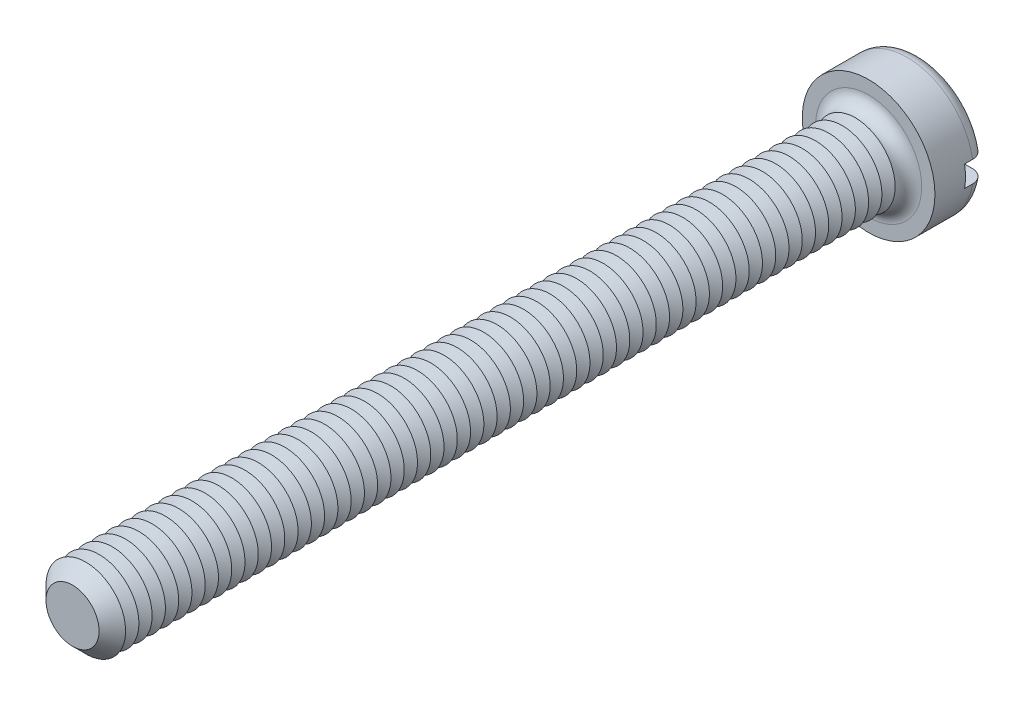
ISO-10303-21;
HEADER;
FILE_DESCRIPTION(('STEP AP214'),'2;1');
FILE_NAME('part.step','',(''),(''),'','','');
FILE_SCHEMA(('AUTOMOTIVE_DESIGN { 1 0 10303 214 1 1 1 1 }'));
ENDSEC;
DATA;
#1=APPLICATION_CONTEXT('core data for automotive mechanical design processes');
#2=APPLICATION_PROTOCOL_DEFINITION('international standard','automotive_design',2000,#1);
#3=PRODUCT_CONTEXT('',#1,'mechanical');
#4=PRODUCT('Part','Part','',(#3));
#5=PRODUCT_RELATED_PRODUCT_CATEGORY('part','',(#4));
#6=PRODUCT_DEFINITION_FORMATION('','',#4);
#7=PRODUCT_DEFINITION_CONTEXT('part definition',#1,'design');
#8=PRODUCT_DEFINITION('design','',#6,#7);
#9=PRODUCT_DEFINITION_SHAPE('','',#8);
#10=(LENGTH_UNIT() NAMED_UNIT(*) SI_UNIT(.MILLI.,.METRE.));
#11=(NAMED_UNIT(*) PLANE_ANGLE_UNIT() SI_UNIT($,.RADIAN.));
#12=(NAMED_UNIT(*) SI_UNIT($,.STERADIAN.) SOLID_ANGLE_UNIT());
#13=UNCERTAINTY_MEASURE_WITH_UNIT(LENGTH_MEASURE(1.E-05),#10,'distance_accuracy_value','');
#14=(GEOMETRIC_REPRESENTATION_CONTEXT(3) GLOBAL_UNCERTAINTY_ASSIGNED_CONTEXT((#13)) GLOBAL_UNIT_ASSIGNED_CONTEXT((#10,
#11,#12)) REPRESENTATION_CONTEXT('',''));
#15=CARTESIAN_POINT('',(0.,0.,0.));
#16=DIRECTION('',(0.,0.,1.));
#17=DIRECTION('',(1.,0.,0.));
#18=AXIS2_PLACEMENT_3D('',#15,#16,#17);
#19=CARTESIAN_POINT('',(0.,0.,-3.9));
#20=DIRECTION('',(0.,0.,1.));
#21=DIRECTION('',(1.,0.,0.));
#22=AXIS2_PLACEMENT_3D('',#19,#20,#21);
#23=PLANE('',#22);
#24=CARTESIAN_POINT('',(0.,0.,-3.9));
#25=DIRECTION('',(0.,0.,1.));
#26=DIRECTION('',(1.,0.,0.));
#27=AXIS2_PLACEMENT_3D('',#24,#25,#26);
#28=CIRCLE('',#27,4.);
#29=CARTESIAN_POINT('',(-3.91918358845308,0.800000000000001,-3.9));
#30=VERTEX_POINT('',#29);
#31=CARTESIAN_POINT('',(3.91918358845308,0.8,-3.9));
#32=VERTEX_POINT('',#31);
#33=EDGE_CURVE('E116',#30,#32,#28,.F.);
#34=ORIENTED_EDGE('',*,*,#33,.T.);
#35=DIRECTION('',(1.,0.,0.));
#36=VECTOR('',#35,1.);
#37=CARTESIAN_POINT('',(-5.,0.800000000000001,-3.9));
#38=LINE('',#37,#36);
#39=EDGE_CURVE('E111',#30,#32,#38,.T.);
#40=ORIENTED_EDGE('',*,*,#39,.F.);
#41=EDGE_LOOP('',(#34,#40));
#42=FACE_BOUND('',#41,.T.);
#43=ADVANCED_FACE('F39',(#42),#23,.F.);
#44=CARTESIAN_POINT('',(0.,0.,-2.9));
#45=DIRECTION('',(0.,0.,1.));
#46=DIRECTION('',(1.,0.,0.));
#47=AXIS2_PLACEMENT_3D('',#44,#45,#46);
#48=TOROIDAL_SURFACE('',#47,4.,1.);
#49=CARTESIAN_POINT('',(-4.76648512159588,0.800000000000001,-3.45304061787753));
#50=CARTESIAN_POINT('',(-4.73486405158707,0.800000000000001,-3.50001565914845));
#51=CARTESIAN_POINT('',(-4.69920787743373,0.800000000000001,-3.54432871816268));
#52=CARTESIAN_POINT('',(-4.62090302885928,0.800000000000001,-3.62634638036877));
#53=CARTESIAN_POINT('',(-4.57824494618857,0.800000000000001,-3.66404194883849));
#54=CARTESIAN_POINT('',(-4.48726975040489,0.800000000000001,-3.73172278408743));
#55=CARTESIAN_POINT('',(-4.43895902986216,0.800000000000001,-3.76171664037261));
#56=CARTESIAN_POINT('',(-4.33804923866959,0.800000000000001,-3.81326437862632));
#57=CARTESIAN_POINT('',(-4.2854512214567,0.800000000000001,-3.8348203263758));
#58=CARTESIAN_POINT('',(-4.17679895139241,0.800000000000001,-3.86918431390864));
#59=CARTESIAN_POINT('',(-4.12071163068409,0.800000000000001,-3.88188775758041));
#60=CARTESIAN_POINT('',(-4.00720729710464,0.800000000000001,-3.89785932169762));
#61=CARTESIAN_POINT('',(-3.94979011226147,0.800000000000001,-3.9011262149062));
#62=CARTESIAN_POINT('',(-3.83429042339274,0.800000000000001,-3.89816676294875));
#63=CARTESIAN_POINT('',(-3.77621176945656,0.800000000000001,-3.89178937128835));
#64=CARTESIAN_POINT('',(-3.66191938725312,0.800000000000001,-3.8694726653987));
#65=CARTESIAN_POINT('',(-3.60570580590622,0.800000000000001,-3.85353259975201));
#66=CARTESIAN_POINT('',(-3.49618749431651,0.800000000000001,-3.81233202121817));
#67=CARTESIAN_POINT('',(-3.44291561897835,0.800000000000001,-3.78698406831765));
#68=CARTESIAN_POINT('',(-3.34140774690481,0.800000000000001,-3.72766098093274));
#69=CARTESIAN_POINT('',(-3.29317182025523,0.800000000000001,-3.69368572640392));
#70=CARTESIAN_POINT('',(-3.20343355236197,0.800000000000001,-3.6182054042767));
#71=CARTESIAN_POINT('',(-3.16189680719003,0.800000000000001,-3.57674128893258));
#72=CARTESIAN_POINT('',(-3.08658236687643,0.800000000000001,-3.48727547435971));
#73=CARTESIAN_POINT('',(-3.05280364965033,0.800000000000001,-3.43927463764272));
#74=CARTESIAN_POINT('',(-2.99489532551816,0.800000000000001,-3.33932895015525));
#75=CARTESIAN_POINT('',(-2.97055012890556,0.800000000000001,-3.28750911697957));
#76=CARTESIAN_POINT('',(-2.93124252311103,0.800000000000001,-3.18042600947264));
#77=CARTESIAN_POINT('',(-2.91627793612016,0.800000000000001,-3.12516353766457));
#78=CARTESIAN_POINT('',(-2.89663075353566,0.800000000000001,-3.01470560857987));
#79=CARTESIAN_POINT('',(-2.89162828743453,0.800000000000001,-2.95956691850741));
#80=CARTESIAN_POINT('',(-2.89112479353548,0.800000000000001,-2.84924961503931));
#81=CARTESIAN_POINT('',(-2.89562264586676,0.800000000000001,-2.79407100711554));
#82=CARTESIAN_POINT('',(-2.91379565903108,0.800000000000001,-2.6861912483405));
#83=CARTESIAN_POINT('',(-2.92731815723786,0.800000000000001,-2.63346424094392));
#84=CARTESIAN_POINT('',(-2.96290888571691,0.800000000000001,-2.53098203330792));
#85=CARTESIAN_POINT('',(-2.98497757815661,0.800000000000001,-2.48122699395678));
#86=CARTESIAN_POINT('',(-3.03728055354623,0.800000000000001,-2.38535286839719));
#87=CARTESIAN_POINT('',(-3.06761989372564,0.800000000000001,-2.33929117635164));
#88=CARTESIAN_POINT('',(-3.13537950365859,0.800000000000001,-2.2527125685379));
#89=CARTESIAN_POINT('',(-3.17280082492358,0.800000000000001,-2.21219647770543));
#90=CARTESIAN_POINT('',(-3.2549164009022,0.800000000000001,-2.13651195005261));
#91=CARTESIAN_POINT('',(-3.29980186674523,0.800000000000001,-2.10155095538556));
#92=CARTESIAN_POINT('',(-3.39467666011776,0.800000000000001,-2.03942270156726));
#93=CARTESIAN_POINT('',(-3.44466673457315,0.800000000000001,-2.01225658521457));
#94=CARTESIAN_POINT('',(-3.5497933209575,0.800000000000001,-1.96576935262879));
#95=CARTESIAN_POINT('',(-3.60503228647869,0.800000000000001,-1.94667963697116));
#96=CARTESIAN_POINT('',(-3.71791613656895,0.800000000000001,-1.91794308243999));
#97=CARTESIAN_POINT('',(-3.77556119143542,0.800000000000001,-1.90829691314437));
#98=CARTESIAN_POINT('',(-3.89221522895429,0.800000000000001,-1.89869331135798));
#99=CARTESIAN_POINT('',(-3.9512319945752,0.800000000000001,-1.89882985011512));
#100=CARTESIAN_POINT('',(-4.06839541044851,0.800000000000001,-1.90907818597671));
#101=CARTESIAN_POINT('',(-4.12654207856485,0.800000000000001,-1.91918977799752));
#102=CARTESIAN_POINT('',(-4.23988103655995,0.800000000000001,-1.9490667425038));
#103=CARTESIAN_POINT('',(-4.29509069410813,0.800000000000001,-1.96876615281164));
#104=CARTESIAN_POINT('',(-4.40134194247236,0.800000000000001,-2.01729572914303));
#105=CARTESIAN_POINT('',(-4.45238383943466,0.800000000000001,-2.04612522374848));
#106=CARTESIAN_POINT('',(-4.54801343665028,0.800000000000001,-2.1116316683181));
#107=CARTESIAN_POINT('',(-4.59268768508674,0.800000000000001,-2.14818225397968));
#108=CARTESIAN_POINT('',(-4.67513924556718,0.800000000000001,-2.22837632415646));
#109=CARTESIAN_POINT('',(-4.71291715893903,0.800000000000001,-2.27201918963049));
#110=CARTESIAN_POINT('',(-4.77986554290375,0.800000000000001,-2.36439990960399));
#111=CARTESIAN_POINT('',(-4.80916462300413,0.800000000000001,-2.41304457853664));
#112=CARTESIAN_POINT('',(-4.85906149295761,0.800000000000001,-2.51460659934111));
#113=CARTESIAN_POINT('',(-4.8796602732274,0.800000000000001,-2.56752346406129));
#114=CARTESIAN_POINT('',(-4.9113264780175,0.800000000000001,-2.67542592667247));
#115=CARTESIAN_POINT('',(-4.92250819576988,0.800000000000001,-2.73037800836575));
#116=CARTESIAN_POINT('',(-4.93542682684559,0.800000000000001,-2.84139649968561));
#117=CARTESIAN_POINT('',(-4.93716171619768,0.800000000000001,-2.89746314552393));
#118=CARTESIAN_POINT('',(-4.93114851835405,0.800000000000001,-3.00876455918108));
#119=CARTESIAN_POINT('',(-4.92345325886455,0.800000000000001,-3.0640022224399));
#120=CARTESIAN_POINT('',(-4.8989032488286,0.800000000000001,-3.17235240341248));
#121=CARTESIAN_POINT('',(-4.88205998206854,0.800000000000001,-3.22546749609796));
#122=CARTESIAN_POINT('',(-4.84819200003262,0.800000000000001,-3.30764066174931));
#123=CARTESIAN_POINT('',(-4.83390853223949,0.800000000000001,-3.33785845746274));
#124=CARTESIAN_POINT('',(-4.80237957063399,0.800000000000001,-3.39670633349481));
#125=CARTESIAN_POINT('',(-4.78513409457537,0.800000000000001,-3.42533642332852));
#126=CARTESIAN_POINT('',(-4.76648512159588,0.800000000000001,-3.45304061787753));
#127=B_SPLINE_CURVE_WITH_KNOTS('',3,(#49,#50,#51,#52,#53,#54,#55,#56,#57,#58,#59,#60,#61,#62,
#63,#64,#65,#66,#67,#68,#69,#70,#71,#72,#73,#74,#75,#76,#77,#78,#79,#80,#81,#82,#83,#84,#85,#86,
#87,#88,#89,#90,#91,#92,#93,#94,#95,#96,#97,#98,#99,#100,#101,#102,#103,#104,#105,#106,#107,
#108,#109,#110,#111,#112,#113,#114,#115,#116,#117,#118,#119,#120,#121,#122,#123,#124,#125,#126),
.UNSPECIFIED.,.T.,.F.,(4,2,2,2,2,2,2,2,2,2,2,2,2,2,2,2,2,2,2,2,2,2,2,2,2,2,2,2,2,2,2,2,2,2,2,2,
2,2,4),(0.,0.169755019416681,0.339740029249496,0.509534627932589,0.67928763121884,
0.851013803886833,1.02276230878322,1.19722869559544,1.37170879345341,1.54785292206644,
1.72399950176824,1.89921049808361,2.07439839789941,2.24530597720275,2.41617386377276,
2.58146078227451,2.74672821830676,2.90926852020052,3.0718176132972,3.2365363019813,
3.40127946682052,3.57118676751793,3.74111896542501,3.91563534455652,4.09016409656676,
4.26636956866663,4.4425714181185,4.61757781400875,4.79257134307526,4.96489650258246,
5.13720662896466,5.30674670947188,5.47626748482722,5.64369988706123,5.81116816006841,
5.97770254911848,6.14402836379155,6.24414438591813,6.34425980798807),.UNSPECIFIED.);
#128=CARTESIAN_POINT('',(-4.93558507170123,0.800000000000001,-2.9));
#129=VERTEX_POINT('',#128);
#130=EDGE_CURVE('E643',#129,#30,#127,.T.);
#131=ORIENTED_EDGE('',*,*,#130,.F.);
#132=CARTESIAN_POINT('',(0.,0.,-2.9));
#133=DIRECTION('',(0.,0.,1.));
#134=DIRECTION('',(1.,0.,0.));
#135=AXIS2_PLACEMENT_3D('',#132,#133,#134);
#136=CIRCLE('',#135,5.);
#137=CARTESIAN_POINT('',(4.93558507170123,0.8,-2.9));
#138=VERTEX_POINT('',#137);
#139=EDGE_CURVE('E125',#138,#129,#136,.T.);
#140=ORIENTED_EDGE('',*,*,#139,.F.);
#141=CARTESIAN_POINT('',(2.98553785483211,0.8,-3.31649797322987));
#142=CARTESIAN_POINT('',(3.00991125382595,0.8,-3.36788093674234));
#143=CARTESIAN_POINT('',(3.03875556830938,0.8,-3.41719756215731));
#144=CARTESIAN_POINT('',(3.1043993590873,0.8,-3.51028676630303));
#145=CARTESIAN_POINT('',(3.1412115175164,0.8,-3.55405032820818));
#146=CARTESIAN_POINT('',(3.22153641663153,0.8,-3.63476402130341));
#147=CARTESIAN_POINT('',(3.26503706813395,0.8,-3.67172618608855));
#148=CARTESIAN_POINT('',(3.35749627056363,0.8,-3.73799476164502));
#149=CARTESIAN_POINT('',(3.4064533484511,0.8,-3.76730323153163));
#150=CARTESIAN_POINT('',(3.5095773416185,0.8,-3.81809642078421));
#151=CARTESIAN_POINT('',(3.56383317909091,0.8,-3.83940072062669));
#152=CARTESIAN_POINT('',(3.67513017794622,0.8,-3.87272481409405));
#153=CARTESIAN_POINT('',(3.7321717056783,0.8,-3.88474338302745));
#154=CARTESIAN_POINT('',(3.84815688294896,0.8,-3.89923413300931));
#155=CARTESIAN_POINT('',(3.90711516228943,0.8,-3.9015896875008));
#156=CARTESIAN_POINT('',(4.02458610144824,0.8,-3.89631753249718));
#157=CARTESIAN_POINT('',(4.08309876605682,0.8,-3.8886899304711));
#158=CARTESIAN_POINT('',(4.19768646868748,0.8,-3.86366584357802));
#159=CARTESIAN_POINT('',(4.25377243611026,0.8,-3.84631948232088));
#160=CARTESIAN_POINT('',(4.3621676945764,0.8,-3.80231797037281));
#161=CARTESIAN_POINT('',(4.41447726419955,0.8,-3.77566350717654));
#162=CARTESIAN_POINT('',(4.51300872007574,0.8,-3.71421163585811));
#163=CARTESIAN_POINT('',(4.5593085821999,0.8,-3.67953927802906));
#164=CARTESIAN_POINT('',(4.64530675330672,0.8,-3.60279495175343));
#165=CARTESIAN_POINT('',(4.68500564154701,0.8,-3.56072363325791));
#166=CARTESIAN_POINT('',(4.75599202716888,0.8,-3.47111750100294));
#167=CARTESIAN_POINT('',(4.7874061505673,0.8,-3.42368298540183));
#168=CARTESIAN_POINT('',(4.84170328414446,0.8,-3.32415927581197));
#169=CARTESIAN_POINT('',(4.86458695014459,0.8,-3.2720704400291));
#170=CARTESIAN_POINT('',(4.90088120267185,0.8,-3.16544016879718));
#171=CARTESIAN_POINT('',(4.91440984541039,0.8,-3.11093889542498));
#172=CARTESIAN_POINT('',(4.93205429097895,0.8,-3.00043391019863));
#173=CARTESIAN_POINT('',(4.93617053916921,0.8,-2.9444302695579));
#174=CARTESIAN_POINT('',(4.93486973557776,0.8,-2.83292218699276));
#175=CARTESIAN_POINT('',(4.92951827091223,0.8,-2.77741696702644));
#176=CARTESIAN_POINT('',(4.90957104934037,0.8,-2.66809456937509));
#177=CARTESIAN_POINT('',(4.89497541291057,0.8,-2.61427736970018));
#178=CARTESIAN_POINT('',(4.85697876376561,0.8,-2.50985095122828));
#179=CARTESIAN_POINT('',(4.83357805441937,0.8,-2.45924162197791));
#180=CARTESIAN_POINT('',(4.77866660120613,0.8,-2.36263484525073));
#181=CARTESIAN_POINT('',(4.74715567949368,0.8,-2.31663749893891));
#182=CARTESIAN_POINT('',(4.67670791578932,0.8,-2.23021464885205));
#183=CARTESIAN_POINT('',(4.6377224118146,0.8,-2.1898288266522));
#184=CARTESIAN_POINT('',(4.55359880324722,0.8,-2.11607828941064));
#185=CARTESIAN_POINT('',(4.50846036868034,0.8,-2.08271395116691));
#186=CARTESIAN_POINT('',(4.41271544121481,0.8,-2.02349513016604));
#187=CARTESIAN_POINT('',(4.36204749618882,0.8,-1.99774003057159));
#188=CARTESIAN_POINT('',(4.257155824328,0.8,-1.95495040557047));
#189=CARTESIAN_POINT('',(4.20293181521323,0.8,-1.93791657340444));
#190=CARTESIAN_POINT('',(4.09154156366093,0.8,-1.91276335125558));
#191=CARTESIAN_POINT('',(4.03434212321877,0.8,-1.90479098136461));
#192=CARTESIAN_POINT('',(3.91941228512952,0.8,-1.89840884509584));
#193=CARTESIAN_POINT('',(3.8616818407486,0.8,-1.89999992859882));
#194=CARTESIAN_POINT('',(3.7464111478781,0.8,-1.91275144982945));
#195=CARTESIAN_POINT('',(3.6888866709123,0.8,-1.92405471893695));
#196=CARTESIAN_POINT('',(3.57652290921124,0.8,-1.95609086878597));
#197=CARTESIAN_POINT('',(3.52168382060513,0.8,-1.97682443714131));
#198=CARTESIAN_POINT('',(3.41589179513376,0.8,-2.02733294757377));
#199=CARTESIAN_POINT('',(3.36496676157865,0.8,-2.05716640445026));
#200=CARTESIAN_POINT('',(3.26890903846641,0.8,-2.12504079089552));
#201=CARTESIAN_POINT('',(3.22377627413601,0.8,-2.16308161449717));
#202=CARTESIAN_POINT('',(3.141135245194,0.8,-2.24593284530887));
#203=CARTESIAN_POINT('',(3.1035541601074,0.8,-2.29067053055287));
#204=CARTESIAN_POINT('',(3.03669700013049,0.8,-2.38597317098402));
#205=CARTESIAN_POINT('',(3.00741914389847,0.8,-2.43653687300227));
#206=CARTESIAN_POINT('',(2.95891799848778,0.8,-2.54052959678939));
#207=CARTESIAN_POINT('',(2.93943249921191,0.8,-2.59383627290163));
#208=CARTESIAN_POINT('',(2.9100081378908,0.8,-2.70303736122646));
#209=CARTESIAN_POINT('',(2.90006970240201,0.8,-2.75893188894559));
#210=CARTESIAN_POINT('',(2.89027863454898,0.8,-2.86986958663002));
#211=CARTESIAN_POINT('',(2.89012791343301,0.8,-2.92488680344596));
#212=CARTESIAN_POINT('',(2.89917145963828,0.8,-3.03409648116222));
#213=CARTESIAN_POINT('',(2.90835313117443,0.8,-3.08828995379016));
#214=CARTESIAN_POINT('',(2.92977618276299,0.8,-3.17141652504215));
#215=CARTESIAN_POINT('',(2.93899011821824,0.8,-3.20116372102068));
#216=CARTESIAN_POINT('',(2.96020249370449,0.8,-3.25964614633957));
#217=CARTESIAN_POINT('',(2.97220082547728,0.8,-3.28838141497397));
#218=CARTESIAN_POINT('',(2.98553785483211,0.8,-3.31649797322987));
#219=B_SPLINE_CURVE_WITH_KNOTS('',3,(#141,#142,#143,#144,#145,#146,#147,#148,#149,#150,#151,
#152,#153,#154,#155,#156,#157,#158,#159,#160,#161,#162,#163,#164,#165,#166,#167,#168,#169,#170,
#171,#172,#173,#174,#175,#176,#177,#178,#179,#180,#181,#182,#183,#184,#185,#186,#187,#188,#189,
#190,#191,#192,#193,#194,#195,#196,#197,#198,#199,#200,#201,#202,#203,#204,#205,#206,#207,#208,
#209,#210,#211,#212,#213,#214,#215,#216,#217,#218),.UNSPECIFIED.,.T.,.F.,(4,2,2,2,2,2,2,2,2,2,2,
2,2,2,2,2,2,2,2,2,2,2,2,2,2,2,2,2,2,2,2,2,2,2,2,2,2,2,4),(0.,0.170493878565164,
0.341261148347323,0.511723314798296,0.682139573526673,0.856194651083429,1.03027268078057,
1.20644565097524,1.38261672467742,1.55788746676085,1.73314526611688,1.90583484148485,
2.07850925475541,2.24836742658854,2.41821253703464,2.58587311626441,2.75352576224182,
2.92002154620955,3.08651516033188,3.25300303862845,3.41949456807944,3.58710926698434,
3.75473295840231,3.92445790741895,4.09419634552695,4.26665110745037,4.43912119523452,
4.61417197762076,4.78923552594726,4.96544940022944,5.1416609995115,5.31608191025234,
5.49046537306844,5.65989063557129,5.82932346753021,5.99359365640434,6.157642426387,
6.250939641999,6.34423323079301),.UNSPECIFIED.);
#220=EDGE_CURVE('E645',#32,#138,#219,.T.);
#221=ORIENTED_EDGE('',*,*,#220,.F.);
#222=ORIENTED_EDGE('',*,*,#33,.F.);
#223=EDGE_LOOP('',(#131,#140,#221,#222));
#224=FACE_BOUND('',#223,.T.);
#225=ADVANCED_FACE('F627',(#224),#48,.T.);
#226=CARTESIAN_POINT('',(0.,0.,-3.9));
#227=DIRECTION('',(0.,0.,1.));
#228=DIRECTION('',(1.,0.,0.));
#229=AXIS2_PLACEMENT_3D('',#226,#227,#228);
#230=CYLINDRICAL_SURFACE('',#229,5.);
#231=DIRECTION('',(0.,0.,1.));
#232=VECTOR('',#231,1.);
#233=CARTESIAN_POINT('',(4.93558507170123,0.8,-3.9));
#234=LINE('',#233,#232);
#235=CARTESIAN_POINT('',(4.93558507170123,0.8,-2.3));
#236=VERTEX_POINT('',#235);
#237=EDGE_CURVE('E660',#138,#236,#234,.T.);
#238=ORIENTED_EDGE('',*,*,#237,.F.);
#239=ORIENTED_EDGE('',*,*,#139,.T.);
#240=DIRECTION('',(0.,0.,1.));
#241=VECTOR('',#240,1.);
#242=CARTESIAN_POINT('',(-4.93558507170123,0.800000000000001,-3.9));
#243=LINE('',#242,#241);
#244=CARTESIAN_POINT('',(-4.93558507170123,0.800000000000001,-2.3));
#245=VERTEX_POINT('',#244);
#246=EDGE_CURVE('E63',#245,#129,#243,.F.);
#247=ORIENTED_EDGE('',*,*,#246,.F.);
#248=CARTESIAN_POINT('',(0.,0.,-2.3));
#249=DIRECTION('',(0.,0.,-1.));
#250=DIRECTION('',(-1.,0.,0.));
#251=AXIS2_PLACEMENT_3D('',#248,#249,#250);
#252=CIRCLE('',#251,5.);
#253=CARTESIAN_POINT('',(-4.93558507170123,-0.799999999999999,-2.3));
#254=VERTEX_POINT('',#253);
#255=EDGE_CURVE('E43',#245,#254,#252,.F.);
#256=ORIENTED_EDGE('',*,*,#255,.T.);
#257=DIRECTION('',(0.,0.,1.));
#258=VECTOR('',#257,1.);
#259=CARTESIAN_POINT('',(-4.93558507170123,-0.799999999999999,-3.9));
#260=LINE('',#259,#258);
#261=CARTESIAN_POINT('',(-4.93558507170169,-0.799999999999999,-2.89999999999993));
#262=VERTEX_POINT('',#261);
#263=EDGE_CURVE('E657',#262,#254,#260,.T.);
#264=ORIENTED_EDGE('',*,*,#263,.F.);
#265=CARTESIAN_POINT('',(4.93558507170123,-0.8,-2.9));
#266=VERTEX_POINT('',#265);
#267=EDGE_CURVE('E127',#262,#266,#136,.T.);
#268=ORIENTED_EDGE('',*,*,#267,.T.);
#269=DIRECTION('',(0.,0.,1.));
#270=VECTOR('',#269,1.);
#271=CARTESIAN_POINT('',(4.93558507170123,-0.8,-3.9));
#272=LINE('',#271,#270);
#273=CARTESIAN_POINT('',(4.93558507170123,-0.8,-2.3));
#274=VERTEX_POINT('',#273);
#275=EDGE_CURVE('E55',#274,#266,#272,.F.);
#276=ORIENTED_EDGE('',*,*,#275,.F.);
#277=EDGE_CURVE('E11',#274,#236,#252,.F.);
#278=ORIENTED_EDGE('',*,*,#277,.T.);
#279=EDGE_LOOP('',(#238,#239,#247,#256,#264,#268,#276,#278));
#280=FACE_BOUND('',#279,.T.);
#281=CARTESIAN_POINT('',(0.,0.,0.));
#282=DIRECTION('',(0.,0.,1.));
#283=DIRECTION('',(1.,0.,0.));
#284=AXIS2_PLACEMENT_3D('',#281,#282,#283);
#285=CIRCLE('',#284,5.);
#286=CARTESIAN_POINT('',(5.,0.,0.));
#287=VERTEX_POINT('',#286);
#288=EDGE_CURVE('E663',#287,#287,#285,.T.);
#289=ORIENTED_EDGE('',*,*,#288,.F.);
#290=EDGE_LOOP('',(#289));
#291=FACE_BOUND('',#290,.T.);
#292=ADVANCED_FACE('F623',(#280,#291),#230,.T.);
#293=CARTESIAN_POINT('',(3.91918358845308,-0.8,-3.9));
#294=VERTEX_POINT('',#293);
#295=CARTESIAN_POINT('',(-3.91918358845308,-0.799999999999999,-3.9));
#296=VERTEX_POINT('',#295);
#297=EDGE_CURVE('E109',#294,#296,#28,.F.);
#298=ORIENTED_EDGE('',*,*,#297,.T.);
#299=DIRECTION('',(-1.,0.,0.));
#300=VECTOR('',#299,1.);
#301=CARTESIAN_POINT('',(-5.,-0.799999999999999,-3.9));
#302=LINE('',#301,#300);
#303=EDGE_CURVE('E96',#294,#296,#302,.T.);
#304=ORIENTED_EDGE('',*,*,#303,.F.);
#305=EDGE_LOOP('',(#298,#304));
#306=FACE_BOUND('',#305,.T.);
#307=ADVANCED_FACE('F108',(#306),#23,.F.);
#308=CARTESIAN_POINT('',(0.,0.,0.));
#309=DIRECTION('',(0.,0.,1.));
#310=DIRECTION('',(1.,0.,0.));
#311=AXIS2_PLACEMENT_3D('',#308,#309,#310);
#312=PLANE('',#311);
#313=CARTESIAN_POINT('',(0.,0.,0.));
#314=DIRECTION('',(0.,0.,1.));
#315=DIRECTION('',(1.,0.,0.));
#316=AXIS2_PLACEMENT_3D('',#313,#314,#315);
#317=CIRCLE('',#316,4.);
#318=CARTESIAN_POINT('',(4.,0.,0.));
#319=VERTEX_POINT('',#318);
#320=EDGE_CURVE('E115',#319,#319,#317,.F.);
#321=ORIENTED_EDGE('',*,*,#320,.T.);
#322=EDGE_LOOP('',(#321));
#323=FACE_BOUND('',#322,.T.);
#324=ORIENTED_EDGE('',*,*,#288,.T.);
#325=EDGE_LOOP('',(#324));
#326=FACE_BOUND('',#325,.T.);
#327=ADVANCED_FACE('F622',(#323,#326),#312,.T.);
#328=CARTESIAN_POINT('',(-4.76648512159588,-0.799999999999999,-3.45304061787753));
#329=CARTESIAN_POINT('',(-4.7975694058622,-0.799999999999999,-3.40685392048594));
#330=CARTESIAN_POINT('',(-4.82479903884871,-0.799999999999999,-3.35802740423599));
#331=CARTESIAN_POINT('',(-4.87070632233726,-0.799999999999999,-3.25646127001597));
#332=CARTESIAN_POINT('',(-4.8893747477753,-0.799999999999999,-3.20371750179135));
#333=CARTESIAN_POINT('',(-4.91756720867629,-0.799999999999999,-3.09584501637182));
#334=CARTESIAN_POINT('',(-4.92709302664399,-0.799999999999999,-3.04071676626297));
#335=CARTESIAN_POINT('',(-4.93671217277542,-0.799999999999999,-2.92965669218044));
#336=CARTESIAN_POINT('',(-4.93680767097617,-0.799999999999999,-2.87372505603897));
#337=CARTESIAN_POINT('',(-4.92758675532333,-0.799999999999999,-2.76284675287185));
#338=CARTESIAN_POINT('',(-4.91830421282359,-0.799999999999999,-2.70789726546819));
#339=CARTESIAN_POINT('',(-4.89065741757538,-0.799999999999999,-2.60033228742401));
#340=CARTESIAN_POINT('',(-4.87229291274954,-0.799999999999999,-2.54771686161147));
#341=CARTESIAN_POINT('',(-4.82699855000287,-0.799999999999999,-2.44622441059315));
#342=CARTESIAN_POINT('',(-4.80005659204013,-0.799999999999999,-2.39735278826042));
#343=CARTESIAN_POINT('',(-4.73841244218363,-0.799999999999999,-2.30477947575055));
#344=CARTESIAN_POINT('',(-4.70371003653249,-0.799999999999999,-2.26107792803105));
#345=CARTESIAN_POINT('',(-4.62724516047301,-0.799999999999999,-2.17969334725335));
#346=CARTESIAN_POINT('',(-4.58542787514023,-0.799999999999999,-2.14206183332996));
#347=CARTESIAN_POINT('',(-4.49614171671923,-0.799999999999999,-2.07424284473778));
#348=CARTESIAN_POINT('',(-4.44867251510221,-0.799999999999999,-2.04405580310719));
#349=CARTESIAN_POINT('',(-4.34875035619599,-0.799999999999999,-1.99153688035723));
#350=CARTESIAN_POINT('',(-4.29623870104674,-0.799999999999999,-1.96931670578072));
#351=CARTESIAN_POINT('',(-4.18826905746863,-0.799999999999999,-1.93384994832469));
#352=CARTESIAN_POINT('',(-4.1328108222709,-0.799999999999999,-1.92060411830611));
#353=CARTESIAN_POINT('',(-4.01956054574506,-0.799999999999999,-1.90323798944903));
#354=CARTESIAN_POINT('',(-3.96174522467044,-0.799999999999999,-1.89926947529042));
#355=CARTESIAN_POINT('',(-3.84625419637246,-0.799999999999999,-1.90095183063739));
#356=CARTESIAN_POINT('',(-3.78857850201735,-0.799999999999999,-1.90660355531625));
#357=CARTESIAN_POINT('',(-3.67415602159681,-0.799999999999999,-1.92748272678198));
#358=CARTESIAN_POINT('',(-3.61743328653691,-0.799999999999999,-1.94284216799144));
#359=CARTESIAN_POINT('',(-3.50734962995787,-0.799999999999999,-1.9828275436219));
#360=CARTESIAN_POINT('',(-3.4539889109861,-0.799999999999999,-2.00745403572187));
#361=CARTESIAN_POINT('',(-3.35197118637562,-0.799999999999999,-2.06542964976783));
#362=CARTESIAN_POINT('',(-3.30333217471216,-0.799999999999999,-2.0988104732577));
#363=CARTESIAN_POINT('',(-3.21244692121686,-0.799999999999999,-2.17337326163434));
#364=CARTESIAN_POINT('',(-3.17020039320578,-0.799999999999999,-2.21455487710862));
#365=CARTESIAN_POINT('',(-3.0940098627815,-0.799999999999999,-2.30296695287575));
#366=CARTESIAN_POINT('',(-3.05995540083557,-0.799999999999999,-2.35010211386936));
#367=CARTESIAN_POINT('',(-3.00053815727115,-0.799999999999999,-2.4495670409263));
#368=CARTESIAN_POINT('',(-2.97517362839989,-0.799999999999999,-2.50189576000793));
#369=CARTESIAN_POINT('',(-2.93470320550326,-0.799999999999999,-2.60853979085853));
#370=CARTESIAN_POINT('',(-2.91930557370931,-0.799999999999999,-2.66274437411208));
#371=CARTESIAN_POINT('',(-2.89812734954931,-0.799999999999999,-2.77299836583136));
#372=CARTESIAN_POINT('',(-2.89234481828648,-0.799999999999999,-2.82904740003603));
#373=CARTESIAN_POINT('',(-2.89064073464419,-0.799999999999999,-2.93970612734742));
#374=CARTESIAN_POINT('',(-2.89444549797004,-0.799999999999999,-2.99431180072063));
#375=CARTESIAN_POINT('',(-2.9112006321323,-0.799999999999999,-3.10209766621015));
#376=CARTESIAN_POINT('',(-2.9241507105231,-0.799999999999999,-3.1552779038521));
#377=CARTESIAN_POINT('',(-2.95868580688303,-0.799999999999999,-3.25858631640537));
#378=CARTESIAN_POINT('',(-2.98024709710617,-0.799999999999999,-3.30872244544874));
#379=CARTESIAN_POINT('',(-3.03128544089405,-0.799999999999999,-3.40478519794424));
#380=CARTESIAN_POINT('',(-3.06076335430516,-0.799999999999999,-3.45071136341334));
#381=CARTESIAN_POINT('',(-3.12753448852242,-0.799999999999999,-3.53826932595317));
#382=CARTESIAN_POINT('',(-3.16500083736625,-0.799999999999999,-3.57976901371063));
#383=CARTESIAN_POINT('',(-3.24617503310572,-0.799999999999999,-3.65613204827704));
#384=CARTESIAN_POINT('',(-3.28988388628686,-0.799999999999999,-3.69099432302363));
#385=CARTESIAN_POINT('',(-3.38380639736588,-0.799999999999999,-3.75424083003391));
#386=CARTESIAN_POINT('',(-3.43418287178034,-0.799999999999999,-3.78238342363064));
#387=CARTESIAN_POINT('',(-3.53887888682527,-0.799999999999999,-3.83000231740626));
#388=CARTESIAN_POINT('',(-3.59319889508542,-0.799999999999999,-3.84947758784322));
#389=CARTESIAN_POINT('',(-3.70539237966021,-0.799999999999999,-3.87954336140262));
#390=CARTESIAN_POINT('',(-3.76331464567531,-0.799999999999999,-3.88995217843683));
#391=CARTESIAN_POINT('',(-3.88008461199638,-0.799999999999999,-3.9009132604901));
#392=CARTESIAN_POINT('',(-3.93893230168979,-0.799999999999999,-3.9014656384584));
#393=CARTESIAN_POINT('',(-4.05594892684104,-0.799999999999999,-3.89264187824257));
#394=CARTESIAN_POINT('',(-4.11411702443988,-0.799999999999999,-3.88325457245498));
#395=CARTESIAN_POINT('',(-4.22802928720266,-0.799999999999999,-3.85472582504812));
#396=CARTESIAN_POINT('',(-4.28377297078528,-0.799999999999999,-3.83558245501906));
#397=CARTESIAN_POINT('',(-4.39054463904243,-0.799999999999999,-3.78829842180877));
#398=CARTESIAN_POINT('',(-4.44161887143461,-0.799999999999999,-3.76026208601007));
#399=CARTESIAN_POINT('',(-4.53818016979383,-0.799999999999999,-3.69589278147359));
#400=CARTESIAN_POINT('',(-4.58367442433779,-0.799999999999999,-3.65957066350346));
#401=CARTESIAN_POINT('',(-4.65208830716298,-0.799999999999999,-3.59453310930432));
#402=CARTESIAN_POINT('',(-4.67711825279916,-0.799999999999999,-3.56800018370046));
#403=CARTESIAN_POINT('',(-4.72414423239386,-0.799999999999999,-3.51236863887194));
#404=CARTESIAN_POINT('',(-4.74614029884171,-0.799999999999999,-3.48327004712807));
#405=CARTESIAN_POINT('',(-4.76648512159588,-0.799999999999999,-3.45304061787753));
#406=B_SPLINE_CURVE_WITH_KNOTS('',3,(#328,#329,#330,#331,#332,#333,#334,#335,#336,#337,#338,
#339,#340,#341,#342,#343,#344,#345,#346,#347,#348,#349,#350,#351,#352,#353,#354,#355,#356,#357,
#358,#359,#360,#361,#362,#363,#364,#365,#366,#367,#368,#369,#370,#371,#372,#373,#374,#375,#376,
#377,#378,#379,#380,#381,#382,#383,#384,#385,#386,#387,#388,#389,#390,#391,#392,#393,#394,#395,
#396,#397,#398,#399,#400,#401,#402,#403,#404,#405),.UNSPECIFIED.,.T.,.F.,(4,2,2,2,2,2,2,2,2,2,2,
2,2,2,2,2,2,2,2,2,2,2,2,2,2,2,2,2,2,2,2,2,2,2,2,2,2,2,4),(0.,0.166886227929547,
0.333951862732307,0.500984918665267,0.667979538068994,0.834373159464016,1.00077139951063,
1.16740542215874,1.33404403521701,1.50202999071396,1.67002571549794,1.84029248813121,
2.01057354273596,2.18362161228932,2.35668506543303,2.53215380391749,2.70763310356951,
2.88375684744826,3.05987270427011,3.23346085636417,3.40701408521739,3.57522519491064,
3.74340238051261,3.90683338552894,4.0702591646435,4.23323770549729,4.39623395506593,
4.56320691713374,4.7302068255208,4.90252468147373,5.07486300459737,5.25058028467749,
5.42629555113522,5.60220844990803,5.77815613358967,5.95211162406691,6.12584060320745,
6.23506966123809,6.34429754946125),.UNSPECIFIED.);
#407=EDGE_CURVE('E103',#296,#262,#406,.T.);
#408=ORIENTED_EDGE('',*,*,#407,.F.);
#409=ORIENTED_EDGE('',*,*,#297,.F.);
#410=CARTESIAN_POINT('',(2.98553785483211,-0.8,-3.31649797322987));
#411=CARTESIAN_POINT('',(2.96216773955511,-0.8,-3.26721849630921));
#412=CARTESIAN_POINT('',(2.94287503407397,-0.8,-3.21596872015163));
#413=CARTESIAN_POINT('',(2.91313258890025,-0.8,-3.11092723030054));
#414=CARTESIAN_POINT('',(2.9026902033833,-0.8,-3.0571334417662));
#415=CARTESIAN_POINT('',(2.89104377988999,-0.8,-2.94853922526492));
#416=CARTESIAN_POINT('',(2.88984130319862,-0.8,-2.89373862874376));
#417=CARTESIAN_POINT('',(2.89672585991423,-0.8,-2.78473646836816));
#418=CARTESIAN_POINT('',(2.90481120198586,-0.8,-2.73053479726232));
#419=CARTESIAN_POINT('',(2.92989134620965,-0.8,-2.62460092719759));
#420=CARTESIAN_POINT('',(2.94682969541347,-0.8,-2.57285532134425));
#421=CARTESIAN_POINT('',(2.9889990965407,-0.8,-2.47286425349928));
#422=CARTESIAN_POINT('',(3.01423103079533,-0.8,-2.42461916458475));
#423=CARTESIAN_POINT('',(3.07271536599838,-0.8,-2.33201565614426));
#424=CARTESIAN_POINT('',(3.10610710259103,-0.8,-2.28774532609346));
#425=CARTESIAN_POINT('',(3.17963417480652,-0.8,-2.205215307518));
#426=CARTESIAN_POINT('',(3.21977054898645,-0.8,-2.16695654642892));
#427=CARTESIAN_POINT('',(3.3070361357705,-0.8,-2.09624274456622));
#428=CARTESIAN_POINT('',(3.35434874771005,-0.8,-2.06401396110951));
#429=CARTESIAN_POINT('',(3.45361131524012,-0.8,-2.00773436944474));
#430=CARTESIAN_POINT('',(3.50556189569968,-0.8,-1.98368466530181));
#431=CARTESIAN_POINT('',(3.61398433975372,-0.8,-1.94389460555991));
#432=CARTESIAN_POINT('',(3.67053506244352,-0.8,-1.92836880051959));
#433=CARTESIAN_POINT('',(3.78543606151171,-0.8,-1.90696594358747));
#434=CARTESIAN_POINT('',(3.84378643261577,-0.8,-1.90108940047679));
#435=CARTESIAN_POINT('',(3.96100201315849,-0.8,-1.89918115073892));
#436=CARTESIAN_POINT('',(4.01986821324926,-0.8,-1.90320860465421));
#437=CARTESIAN_POINT('',(4.13606891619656,-0.8,-1.9211820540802));
#438=CARTESIAN_POINT('',(4.19340347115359,-0.8,-1.93512771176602));
#439=CARTESIAN_POINT('',(4.30434213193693,-0.8,-1.97243705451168));
#440=CARTESIAN_POINT('',(4.35797549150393,-0.8,-1.99571368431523));
#441=CARTESIAN_POINT('',(4.46048254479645,-0.8,-2.0510826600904));
#442=CARTESIAN_POINT('',(4.50935662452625,-0.8,-2.08317429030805));
#443=CARTESIAN_POINT('',(4.60012348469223,-0.8,-2.15471647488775));
#444=CARTESIAN_POINT('',(4.64211506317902,-0.8,-2.19404167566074));
#445=CARTESIAN_POINT('',(4.71877054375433,-0.8,-2.27928299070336));
#446=CARTESIAN_POINT('',(4.75343508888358,-0.8,-2.32519852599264));
#447=CARTESIAN_POINT('',(4.81388799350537,-0.8,-2.4215411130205));
#448=CARTESIAN_POINT('',(4.83980652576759,-0.8,-2.47188650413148));
#449=CARTESIAN_POINT('',(4.88271402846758,-0.8,-2.57624865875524));
#450=CARTESIAN_POINT('',(4.89970360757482,-0.8,-2.63026517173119));
#451=CARTESIAN_POINT('',(4.92409334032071,-0.8,-2.73978844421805));
#452=CARTESIAN_POINT('',(4.93159814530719,-0.8,-2.79527191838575));
#453=CARTESIAN_POINT('',(4.93713723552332,-0.8,-2.90670881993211));
#454=CARTESIAN_POINT('',(4.9351718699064,-0.8,-2.9626622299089));
#455=CARTESIAN_POINT('',(4.92186293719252,-0.8,-3.07317093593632));
#456=CARTESIAN_POINT('',(4.91056393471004,-0.8,-3.12773160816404));
#457=CARTESIAN_POINT('',(4.87898532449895,-0.8,-3.234187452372));
#458=CARTESIAN_POINT('',(4.85870572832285,-0.8,-3.28608262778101));
#459=CARTESIAN_POINT('',(4.80971634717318,-0.8,-3.38586723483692));
#460=CARTESIAN_POINT('',(4.78098824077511,-0.8,-3.43374766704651));
#461=CARTESIAN_POINT('',(4.71596686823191,-0.8,-3.52405937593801));
#462=CARTESIAN_POINT('',(4.67967336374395,-0.8,-3.56649048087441));
#463=CARTESIAN_POINT('',(4.60022577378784,-0.8,-3.64511036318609));
#464=CARTESIAN_POINT('',(4.5570143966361,-0.8,-3.6812412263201));
#465=CARTESIAN_POINT('',(4.4652099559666,-0.8,-3.7458530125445));
#466=CARTESIAN_POINT('',(4.41661654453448,-0.8,-3.77433344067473));
#467=CARTESIAN_POINT('',(4.31470683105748,-0.8,-3.82326981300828));
#468=CARTESIAN_POINT('',(4.26133399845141,-0.8,-3.84360800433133));
#469=CARTESIAN_POINT('',(4.15196444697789,-0.8,-3.87519515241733));
#470=CARTESIAN_POINT('',(4.09596750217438,-0.8,-3.88644332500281));
#471=CARTESIAN_POINT('',(3.98196469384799,-0.8,-3.89971870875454));
#472=CARTESIAN_POINT('',(3.92394096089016,-0.8,-3.901592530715));
#473=CARTESIAN_POINT('',(3.8083852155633,-0.8,-3.89570840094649));
#474=CARTESIAN_POINT('',(3.75085322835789,-0.8,-3.88794995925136));
#475=CARTESIAN_POINT('',(3.6371167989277,-0.8,-3.86287824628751));
#476=CARTESIAN_POINT('',(3.58093962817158,-0.8,-3.84544111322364));
#477=CARTESIAN_POINT('',(3.47227948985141,-0.8,-3.80139971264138));
#478=CARTESIAN_POINT('',(3.41979762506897,-0.8,-3.77479272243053));
#479=CARTESIAN_POINT('',(3.31994061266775,-0.8,-3.71304199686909));
#480=CARTESIAN_POINT('',(3.27257854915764,-0.8,-3.67787710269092));
#481=CARTESIAN_POINT('',(3.18459619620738,-0.8,-3.59999704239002));
#482=CARTESIAN_POINT('',(3.14396747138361,-0.8,-3.55729146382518));
#483=CARTESIAN_POINT('',(3.08341110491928,-0.8,-3.48140072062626));
#484=CARTESIAN_POINT('',(3.06118126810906,-0.8,-3.45002448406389));
#485=CARTESIAN_POINT('',(3.02047302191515,-0.8,-3.38492378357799));
#486=CARTESIAN_POINT('',(3.00199451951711,-0.8,-3.35119937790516));
#487=CARTESIAN_POINT('',(2.98553785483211,-0.8,-3.31649797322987));
#488=B_SPLINE_CURVE_WITH_KNOTS('',3,(#410,#411,#412,#413,#414,#415,#416,#417,#418,#419,#420,
#421,#422,#423,#424,#425,#426,#427,#428,#429,#430,#431,#432,#433,#434,#435,#436,#437,#438,#439,
#440,#441,#442,#443,#444,#445,#446,#447,#448,#449,#450,#451,#452,#453,#454,#455,#456,#457,#458,
#459,#460,#461,#462,#463,#464,#465,#466,#467,#468,#469,#470,#471,#472,#473,#474,#475,#476,#477,
#478,#479,#480,#481,#482,#483,#484,#485,#486,#487),.UNSPECIFIED.,.T.,.F.,(4,2,2,2,2,2,2,2,2,2,2,
2,2,2,2,2,2,2,2,2,2,2,2,2,2,2,2,2,2,2,2,2,2,2,2,2,2,2,4),(0.,0.163484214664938,
0.327104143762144,0.490751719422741,0.654369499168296,0.816956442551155,0.979560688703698,
1.14516376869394,1.31079237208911,1.48174839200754,1.6527274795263,1.82783306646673,
2.00294788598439,2.17911127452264,2.35526866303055,2.52981944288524,2.70435605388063,
2.87611266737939,3.04785420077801,3.21691347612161,3.38596122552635,3.55312700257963,
3.72028661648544,3.88665268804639,4.053018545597,4.2197478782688,4.38648246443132,
4.55467705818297,4.72288253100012,4.89343959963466,5.06401138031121,5.23736524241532,
5.41072792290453,5.58636211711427,5.76204850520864,5.93817375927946,6.11407667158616,
6.22920111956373,6.34432271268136),.UNSPECIFIED.);
#489=EDGE_CURVE('E92',#266,#294,#488,.T.);
#490=ORIENTED_EDGE('',*,*,#489,.F.);
#491=ORIENTED_EDGE('',*,*,#267,.F.);
#492=EDGE_LOOP('',(#408,#409,#490,#491));
#493=FACE_BOUND('',#492,.T.);
#494=ADVANCED_FACE('F113',(#493),#48,.T.);
#495=CARTESIAN_POINT('',(0.,0.,1.));
#496=DIRECTION('',(0.,0.,1.));
#497=DIRECTION('',(1.,0.,0.));
#498=AXIS2_PLACEMENT_3D('',#495,#496,#497);
#499=TOROIDAL_SURFACE('',#498,4.,1.);
#500=ORIENTED_EDGE('',*,*,#320,.F.);
#501=EDGE_LOOP('',(#500));
#502=FACE_BOUND('',#501,.T.);
#503=CARTESIAN_POINT('',(0.,0.,1.));
#504=DIRECTION('',(0.,0.,-1.));
#505=DIRECTION('',(-1.,0.,0.));
#506=AXIS2_PLACEMENT_3D('',#503,#504,#505);
#507=CIRCLE('',#506,3.);
#508=CARTESIAN_POINT('',(-3.,0.,1.));
#509=VERTEX_POINT('',#508);
#510=EDGE_CURVE('E668',#509,#509,#507,.T.);
#511=ORIENTED_EDGE('',*,*,#510,.T.);
#512=EDGE_LOOP('',(#511));
#513=FACE_BOUND('',#512,.T.);
#514=ADVANCED_FACE('F615',(#502,#513),#499,.F.);
#515=CARTESIAN_POINT('',(0.,0.,1.5));
#516=DIRECTION('',(0.,0.,-1.));
#517=DIRECTION('',(-1.,0.,0.));
#518=AXIS2_PLACEMENT_3D('',#515,#516,#517);
#519=CONICAL_SURFACE('',#518,2.13397459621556,1.0471975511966);
#520=ORIENTED_EDGE('',*,*,#510,.F.);
#521=EDGE_LOOP('',(#520));
#522=FACE_BOUND('',#521,.T.);
#523=CARTESIAN_POINT('',(0.,0.,1.5));
#524=DIRECTION('',(0.,0.,-1.));
#525=DIRECTION('',(-1.,0.,0.));
#526=AXIS2_PLACEMENT_3D('',#523,#524,#525);
#527=CIRCLE('',#526,2.13397459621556);
#528=CARTESIAN_POINT('',(-2.13397459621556,0.,1.5));
#529=VERTEX_POINT('',#528);
#530=EDGE_CURVE('E675',#529,#529,#527,.T.);
#531=ORIENTED_EDGE('',*,*,#530,.T.);
#532=EDGE_LOOP('',(#531));
#533=FACE_BOUND('',#532,.T.);
#534=ADVANCED_FACE('F611',(#522,#533),#519,.T.);
#535=CARTESIAN_POINT('',(0.,0.,2.));
#536=DIRECTION('',(0.,0.,1.));
#537=DIRECTION('',(1.,0.,0.));
#538=AXIS2_PLACEMENT_3D('',#535,#536,#537);
#539=CONICAL_SURFACE('',#538,3.,1.0471975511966);
#540=ORIENTED_EDGE('',*,*,#530,.F.);
#541=EDGE_LOOP('',(#540));
#542=FACE_BOUND('',#541,.T.);
#543=CARTESIAN_POINT('',(0.,0.,2.));
#544=DIRECTION('',(0.,0.,-1.));
#545=DIRECTION('',(-1.,0.,0.));
#546=AXIS2_PLACEMENT_3D('',#543,#544,#545);
#547=CIRCLE('',#546,3.);
#548=CARTESIAN_POINT('',(-3.,0.,2.));
#549=VERTEX_POINT('',#548);
#550=EDGE_CURVE('E681',#549,#549,#547,.T.);
#551=ORIENTED_EDGE('',*,*,#550,.T.);
#552=EDGE_LOOP('',(#551));
#553=FACE_BOUND('',#552,.T.);
#554=ADVANCED_FACE('F607',(#542,#553),#539,.T.);
#555=CARTESIAN_POINT('',(0.,0.,2.5));
#556=DIRECTION('',(0.,0.,-1.));
#557=DIRECTION('',(-1.,0.,0.));
#558=AXIS2_PLACEMENT_3D('',#555,#556,#557);
#559=CONICAL_SURFACE('',#558,2.13397459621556,1.0471975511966);
#560=ORIENTED_EDGE('',*,*,#550,.F.);
#561=EDGE_LOOP('',(#560));
#562=FACE_BOUND('',#561,.T.);
#563=CARTESIAN_POINT('',(0.,0.,2.5));
#564=DIRECTION('',(0.,0.,-1.));
#565=DIRECTION('',(-1.,0.,0.));
#566=AXIS2_PLACEMENT_3D('',#563,#564,#565);
#567=CIRCLE('',#566,2.13397459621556);
#568=CARTESIAN_POINT('',(-2.13397459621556,0.,2.5));
#569=VERTEX_POINT('',#568);
#570=EDGE_CURVE('E684',#569,#569,#567,.T.);
#571=ORIENTED_EDGE('',*,*,#570,.T.);
#572=EDGE_LOOP('',(#571));
#573=FACE_BOUND('',#572,.T.);
#574=ADVANCED_FACE('F603',(#562,#573),#559,.T.);
#575=CARTESIAN_POINT('',(0.,0.,3.));
#576=DIRECTION('',(0.,0.,1.));
#577=DIRECTION('',(1.,0.,0.));
#578=AXIS2_PLACEMENT_3D('',#575,#576,#577);
#579=CONICAL_SURFACE('',#578,3.,1.0471975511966);
#580=ORIENTED_EDGE('',*,*,#570,.F.);
#581=EDGE_LOOP('',(#580));
#582=FACE_BOUND('',#581,.T.);
#583=CARTESIAN_POINT('',(0.,0.,3.));
#584=DIRECTION('',(0.,0.,-1.));
#585=DIRECTION('',(-1.,0.,0.));
#586=AXIS2_PLACEMENT_3D('',#583,#584,#585);
#587=CIRCLE('',#586,3.);
#588=CARTESIAN_POINT('',(-3.,0.,3.));
#589=VERTEX_POINT('',#588);
#590=EDGE_CURVE('E688',#589,#589,#587,.T.);
#591=ORIENTED_EDGE('',*,*,#590,.T.);
#592=EDGE_LOOP('',(#591));
#593=FACE_BOUND('',#592,.T.);
#594=ADVANCED_FACE('F599',(#582,#593),#579,.T.);
#595=CARTESIAN_POINT('',(0.,0.,3.5));
#596=DIRECTION('',(0.,0.,-1.));
#597=DIRECTION('',(-1.,0.,0.));
#598=AXIS2_PLACEMENT_3D('',#595,#596,#597);
#599=CONICAL_SURFACE('',#598,2.13397459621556,1.0471975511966);
#600=ORIENTED_EDGE('',*,*,#590,.F.);
#601=EDGE_LOOP('',(#600));
#602=FACE_BOUND('',#601,.T.);
#603=CARTESIAN_POINT('',(0.,0.,3.5));
#604=DIRECTION('',(0.,0.,-1.));
#605=DIRECTION('',(-1.,0.,0.));
#606=AXIS2_PLACEMENT_3D('',#603,#604,#605);
#607=CIRCLE('',#606,2.13397459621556);
#608=CARTESIAN_POINT('',(-2.13397459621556,0.,3.5));
#609=VERTEX_POINT('',#608);
#610=EDGE_CURVE('E691',#609,#609,#607,.T.);
#611=ORIENTED_EDGE('',*,*,#610,.T.);
#612=EDGE_LOOP('',(#611));
#613=FACE_BOUND('',#612,.T.);
#614=ADVANCED_FACE('F595',(#602,#613),#599,.T.);
#615=CARTESIAN_POINT('',(0.,0.,4.));
#616=DIRECTION('',(0.,0.,1.));
#617=DIRECTION('',(1.,0.,0.));
#618=AXIS2_PLACEMENT_3D('',#615,#616,#617);
#619=CONICAL_SURFACE('',#618,3.,1.0471975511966);
#620=ORIENTED_EDGE('',*,*,#610,.F.);
#621=EDGE_LOOP('',(#620));
#622=FACE_BOUND('',#621,.T.);
#623=CARTESIAN_POINT('',(0.,0.,4.));
#624=DIRECTION('',(0.,0.,-1.));
#625=DIRECTION('',(-1.,0.,0.));
#626=AXIS2_PLACEMENT_3D('',#623,#624,#625);
#627=CIRCLE('',#626,3.);
#628=CARTESIAN_POINT('',(-3.,0.,4.));
#629=VERTEX_POINT('',#628);
#630=EDGE_CURVE('E695',#629,#629,#627,.T.);
#631=ORIENTED_EDGE('',*,*,#630,.T.);
#632=EDGE_LOOP('',(#631));
#633=FACE_BOUND('',#632,.T.);
#634=ADVANCED_FACE('F591',(#622,#633),#619,.T.);
#635=CARTESIAN_POINT('',(0.,0.,4.5));
#636=DIRECTION('',(0.,0.,-1.));
#637=DIRECTION('',(-1.,0.,0.));
#638=AXIS2_PLACEMENT_3D('',#635,#636,#637);
#639=CONICAL_SURFACE('',#638,2.13397459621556,1.0471975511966);
#640=ORIENTED_EDGE('',*,*,#630,.F.);
#641=EDGE_LOOP('',(#640));
#642=FACE_BOUND('',#641,.T.);
#643=CARTESIAN_POINT('',(0.,0.,4.5));
#644=DIRECTION('',(0.,0.,-1.));
#645=DIRECTION('',(-1.,0.,0.));
#646=AXIS2_PLACEMENT_3D('',#643,#644,#645);
#647=CIRCLE('',#646,2.13397459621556);
#648=CARTESIAN_POINT('',(-2.13397459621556,0.,4.5));
#649=VERTEX_POINT('',#648);
#650=EDGE_CURVE('E699',#649,#649,#647,.T.);
#651=ORIENTED_EDGE('',*,*,#650,.T.);
#652=EDGE_LOOP('',(#651));
#653=FACE_BOUND('',#652,.T.);
#654=ADVANCED_FACE('F587',(#642,#653),#639,.T.);
#655=CARTESIAN_POINT('',(0.,0.,5.));
#656=DIRECTION('',(0.,0.,1.));
#657=DIRECTION('',(1.,0.,0.));
#658=AXIS2_PLACEMENT_3D('',#655,#656,#657);
#659=CONICAL_SURFACE('',#658,3.,1.0471975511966);
#660=ORIENTED_EDGE('',*,*,#650,.F.);
#661=EDGE_LOOP('',(#660));
#662=FACE_BOUND('',#661,.T.);
#663=CARTESIAN_POINT('',(0.,0.,5.));
#664=DIRECTION('',(0.,0.,-1.));
#665=DIRECTION('',(-1.,0.,0.));
#666=AXIS2_PLACEMENT_3D('',#663,#664,#665);
#667=CIRCLE('',#666,3.);
#668=CARTESIAN_POINT('',(-3.,0.,5.));
#669=VERTEX_POINT('',#668);
#670=EDGE_CURVE('E703',#669,#669,#667,.T.);
#671=ORIENTED_EDGE('',*,*,#670,.T.);
#672=EDGE_LOOP('',(#671));
#673=FACE_BOUND('',#672,.T.);
#674=ADVANCED_FACE('F583',(#662,#673),#659,.T.);
#675=CARTESIAN_POINT('',(0.,0.,5.5));
#676=DIRECTION('',(0.,0.,-1.));
#677=DIRECTION('',(-1.,0.,0.));
#678=AXIS2_PLACEMENT_3D('',#675,#676,#677);
#679=CONICAL_SURFACE('',#678,2.13397459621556,1.0471975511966);
#680=ORIENTED_EDGE('',*,*,#670,.F.);
#681=EDGE_LOOP('',(#680));
#682=FACE_BOUND('',#681,.T.);
#683=CARTESIAN_POINT('',(0.,0.,5.5));
#684=DIRECTION('',(0.,0.,-1.));
#685=DIRECTION('',(-1.,0.,0.));
#686=AXIS2_PLACEMENT_3D('',#683,#684,#685);
#687=CIRCLE('',#686,2.13397459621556);
#688=CARTESIAN_POINT('',(-2.13397459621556,0.,5.5));
#689=VERTEX_POINT('',#688);
#690=EDGE_CURVE('E707',#689,#689,#687,.T.);
#691=ORIENTED_EDGE('',*,*,#690,.T.);
#692=EDGE_LOOP('',(#691));
#693=FACE_BOUND('',#692,.T.);
#694=ADVANCED_FACE('F579',(#682,#693),#679,.T.);
#695=CARTESIAN_POINT('',(0.,0.,6.));
#696=DIRECTION('',(0.,0.,1.));
#697=DIRECTION('',(1.,0.,0.));
#698=AXIS2_PLACEMENT_3D('',#695,#696,#697);
#699=CONICAL_SURFACE('',#698,3.,1.0471975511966);
#700=ORIENTED_EDGE('',*,*,#690,.F.);
#701=EDGE_LOOP('',(#700));
#702=FACE_BOUND('',#701,.T.);
#703=CARTESIAN_POINT('',(0.,0.,6.));
#704=DIRECTION('',(0.,0.,-1.));
#705=DIRECTION('',(-1.,0.,0.));
#706=AXIS2_PLACEMENT_3D('',#703,#704,#705);
#707=CIRCLE('',#706,3.);
#708=CARTESIAN_POINT('',(-3.,0.,6.));
#709=VERTEX_POINT('',#708);
#710=EDGE_CURVE('E711',#709,#709,#707,.T.);
#711=ORIENTED_EDGE('',*,*,#710,.T.);
#712=EDGE_LOOP('',(#711));
#713=FACE_BOUND('',#712,.T.);
#714=ADVANCED_FACE('F575',(#702,#713),#699,.T.);
#715=CARTESIAN_POINT('',(0.,0.,6.5));
#716=DIRECTION('',(0.,0.,-1.));
#717=DIRECTION('',(-1.,0.,0.));
#718=AXIS2_PLACEMENT_3D('',#715,#716,#717);
#719=CONICAL_SURFACE('',#718,2.13397459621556,1.0471975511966);
#720=ORIENTED_EDGE('',*,*,#710,.F.);
#721=EDGE_LOOP('',(#720));
#722=FACE_BOUND('',#721,.T.);
#723=CARTESIAN_POINT('',(0.,0.,6.5));
#724=DIRECTION('',(0.,0.,-1.));
#725=DIRECTION('',(-1.,0.,0.));
#726=AXIS2_PLACEMENT_3D('',#723,#724,#725);
#727=CIRCLE('',#726,2.13397459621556);
#728=CARTESIAN_POINT('',(-2.13397459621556,0.,6.5));
#729=VERTEX_POINT('',#728);
#730=EDGE_CURVE('E715',#729,#729,#727,.T.);
#731=ORIENTED_EDGE('',*,*,#730,.T.);
#732=EDGE_LOOP('',(#731));
#733=FACE_BOUND('',#732,.T.);
#734=ADVANCED_FACE('F571',(#722,#733),#719,.T.);
#735=CARTESIAN_POINT('',(0.,0.,7.));
#736=DIRECTION('',(0.,0.,1.));
#737=DIRECTION('',(1.,0.,0.));
#738=AXIS2_PLACEMENT_3D('',#735,#736,#737);
#739=CONICAL_SURFACE('',#738,3.,1.0471975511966);
#740=ORIENTED_EDGE('',*,*,#730,.F.);
#741=EDGE_LOOP('',(#740));
#742=FACE_BOUND('',#741,.T.);
#743=CARTESIAN_POINT('',(0.,0.,7.));
#744=DIRECTION('',(0.,0.,-1.));
#745=DIRECTION('',(-1.,0.,0.));
#746=AXIS2_PLACEMENT_3D('',#743,#744,#745);
#747=CIRCLE('',#746,3.);
#748=CARTESIAN_POINT('',(-3.,0.,7.));
#749=VERTEX_POINT('',#748);
#750=EDGE_CURVE('E719',#749,#749,#747,.T.);
#751=ORIENTED_EDGE('',*,*,#750,.T.);
#752=EDGE_LOOP('',(#751));
#753=FACE_BOUND('',#752,.T.);
#754=ADVANCED_FACE('F567',(#742,#753),#739,.T.);
#755=CARTESIAN_POINT('',(0.,0.,7.5));
#756=DIRECTION('',(0.,0.,-1.));
#757=DIRECTION('',(-1.,0.,0.));
#758=AXIS2_PLACEMENT_3D('',#755,#756,#757);
#759=CONICAL_SURFACE('',#758,2.13397459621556,1.0471975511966);
#760=ORIENTED_EDGE('',*,*,#750,.F.);
#761=EDGE_LOOP('',(#760));
#762=FACE_BOUND('',#761,.T.);
#763=CARTESIAN_POINT('',(0.,0.,7.5));
#764=DIRECTION('',(0.,0.,-1.));
#765=DIRECTION('',(-1.,0.,0.));
#766=AXIS2_PLACEMENT_3D('',#763,#764,#765);
#767=CIRCLE('',#766,2.13397459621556);
#768=CARTESIAN_POINT('',(-2.13397459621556,0.,7.5));
#769=VERTEX_POINT('',#768);
#770=EDGE_CURVE('E723',#769,#769,#767,.T.);
#771=ORIENTED_EDGE('',*,*,#770,.T.);
#772=EDGE_LOOP('',(#771));
#773=FACE_BOUND('',#772,.T.);
#774=ADVANCED_FACE('F563',(#762,#773),#759,.T.);
#775=CARTESIAN_POINT('',(0.,0.,8.));
#776=DIRECTION('',(0.,0.,1.));
#777=DIRECTION('',(1.,0.,0.));
#778=AXIS2_PLACEMENT_3D('',#775,#776,#777);
#779=CONICAL_SURFACE('',#778,3.,1.0471975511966);
#780=ORIENTED_EDGE('',*,*,#770,.F.);
#781=EDGE_LOOP('',(#780));
#782=FACE_BOUND('',#781,.T.);
#783=CARTESIAN_POINT('',(0.,0.,8.));
#784=DIRECTION('',(0.,0.,-1.));
#785=DIRECTION('',(-1.,0.,0.));
#786=AXIS2_PLACEMENT_3D('',#783,#784,#785);
#787=CIRCLE('',#786,3.);
#788=CARTESIAN_POINT('',(-3.,0.,8.));
#789=VERTEX_POINT('',#788);
#790=EDGE_CURVE('E727',#789,#789,#787,.T.);
#791=ORIENTED_EDGE('',*,*,#790,.T.);
#792=EDGE_LOOP('',(#791));
#793=FACE_BOUND('',#792,.T.);
#794=ADVANCED_FACE('F559',(#782,#793),#779,.T.);
#795=CARTESIAN_POINT('',(0.,0.,8.5));
#796=DIRECTION('',(0.,0.,-1.));
#797=DIRECTION('',(-1.,0.,0.));
#798=AXIS2_PLACEMENT_3D('',#795,#796,#797);
#799=CONICAL_SURFACE('',#798,2.13397459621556,1.0471975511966);
#800=ORIENTED_EDGE('',*,*,#790,.F.);
#801=EDGE_LOOP('',(#800));
#802=FACE_BOUND('',#801,.T.);
#803=CARTESIAN_POINT('',(0.,0.,8.5));
#804=DIRECTION('',(0.,0.,-1.));
#805=DIRECTION('',(-1.,0.,0.));
#806=AXIS2_PLACEMENT_3D('',#803,#804,#805);
#807=CIRCLE('',#806,2.13397459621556);
#808=CARTESIAN_POINT('',(-2.13397459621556,0.,8.5));
#809=VERTEX_POINT('',#808);
#810=EDGE_CURVE('E731',#809,#809,#807,.T.);
#811=ORIENTED_EDGE('',*,*,#810,.T.);
#812=EDGE_LOOP('',(#811));
#813=FACE_BOUND('',#812,.T.);
#814=ADVANCED_FACE('F555',(#802,#813),#799,.T.);
#815=CARTESIAN_POINT('',(0.,0.,9.));
#816=DIRECTION('',(0.,0.,1.));
#817=DIRECTION('',(1.,0.,0.));
#818=AXIS2_PLACEMENT_3D('',#815,#816,#817);
#819=CONICAL_SURFACE('',#818,3.,1.0471975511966);
#820=ORIENTED_EDGE('',*,*,#810,.F.);
#821=EDGE_LOOP('',(#820));
#822=FACE_BOUND('',#821,.T.);
#823=CARTESIAN_POINT('',(0.,0.,9.));
#824=DIRECTION('',(0.,0.,-1.));
#825=DIRECTION('',(-1.,0.,0.));
#826=AXIS2_PLACEMENT_3D('',#823,#824,#825);
#827=CIRCLE('',#826,3.);
#828=CARTESIAN_POINT('',(-3.,0.,9.));
#829=VERTEX_POINT('',#828);
#830=EDGE_CURVE('E735',#829,#829,#827,.T.);
#831=ORIENTED_EDGE('',*,*,#830,.T.);
#832=EDGE_LOOP('',(#831));
#833=FACE_BOUND('',#832,.T.);
#834=ADVANCED_FACE('F551',(#822,#833),#819,.T.);
#835=CARTESIAN_POINT('',(0.,0.,9.5));
#836=DIRECTION('',(0.,0.,-1.));
#837=DIRECTION('',(-1.,0.,0.));
#838=AXIS2_PLACEMENT_3D('',#835,#836,#837);
#839=CONICAL_SURFACE('',#838,2.13397459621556,1.0471975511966);
#840=ORIENTED_EDGE('',*,*,#830,.F.);
#841=EDGE_LOOP('',(#840));
#842=FACE_BOUND('',#841,.T.);
#843=CARTESIAN_POINT('',(0.,0.,9.5));
#844=DIRECTION('',(0.,0.,-1.));
#845=DIRECTION('',(-1.,0.,0.));
#846=AXIS2_PLACEMENT_3D('',#843,#844,#845);
#847=CIRCLE('',#846,2.13397459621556);
#848=CARTESIAN_POINT('',(-2.13397459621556,0.,9.5));
#849=VERTEX_POINT('',#848);
#850=EDGE_CURVE('E739',#849,#849,#847,.T.);
#851=ORIENTED_EDGE('',*,*,#850,.T.);
#852=EDGE_LOOP('',(#851));
#853=FACE_BOUND('',#852,.T.);
#854=ADVANCED_FACE('F547',(#842,#853),#839,.T.);
#855=CARTESIAN_POINT('',(0.,0.,10.));
#856=DIRECTION('',(0.,0.,1.));
#857=DIRECTION('',(1.,0.,0.));
#858=AXIS2_PLACEMENT_3D('',#855,#856,#857);
#859=CONICAL_SURFACE('',#858,3.,1.0471975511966);
#860=ORIENTED_EDGE('',*,*,#850,.F.);
#861=EDGE_LOOP('',(#860));
#862=FACE_BOUND('',#861,.T.);
#863=CARTESIAN_POINT('',(0.,0.,10.));
#864=DIRECTION('',(0.,0.,-1.));
#865=DIRECTION('',(-1.,0.,0.));
#866=AXIS2_PLACEMENT_3D('',#863,#864,#865);
#867=CIRCLE('',#866,3.);
#868=CARTESIAN_POINT('',(-3.,0.,10.));
#869=VERTEX_POINT('',#868);
#870=EDGE_CURVE('E743',#869,#869,#867,.T.);
#871=ORIENTED_EDGE('',*,*,#870,.T.);
#872=EDGE_LOOP('',(#871));
#873=FACE_BOUND('',#872,.T.);
#874=ADVANCED_FACE('F543',(#862,#873),#859,.T.);
#875=CARTESIAN_POINT('',(0.,0.,10.5));
#876=DIRECTION('',(0.,0.,-1.));
#877=DIRECTION('',(-1.,0.,0.));
#878=AXIS2_PLACEMENT_3D('',#875,#876,#877);
#879=CONICAL_SURFACE('',#878,2.13397459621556,1.0471975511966);
#880=ORIENTED_EDGE('',*,*,#870,.F.);
#881=EDGE_LOOP('',(#880));
#882=FACE_BOUND('',#881,.T.);
#883=CARTESIAN_POINT('',(0.,0.,10.5));
#884=DIRECTION('',(0.,0.,-1.));
#885=DIRECTION('',(-1.,0.,0.));
#886=AXIS2_PLACEMENT_3D('',#883,#884,#885);
#887=CIRCLE('',#886,2.13397459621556);
#888=CARTESIAN_POINT('',(-2.13397459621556,0.,10.5));
#889=VERTEX_POINT('',#888);
#890=EDGE_CURVE('E747',#889,#889,#887,.T.);
#891=ORIENTED_EDGE('',*,*,#890,.T.);
#892=EDGE_LOOP('',(#891));
#893=FACE_BOUND('',#892,.T.);
#894=ADVANCED_FACE('F539',(#882,#893),#879,.T.);
#895=CARTESIAN_POINT('',(0.,0.,11.));
#896=DIRECTION('',(0.,0.,1.));
#897=DIRECTION('',(1.,0.,0.));
#898=AXIS2_PLACEMENT_3D('',#895,#896,#897);
#899=CONICAL_SURFACE('',#898,3.,1.0471975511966);
#900=ORIENTED_EDGE('',*,*,#890,.F.);
#901=EDGE_LOOP('',(#900));
#902=FACE_BOUND('',#901,.T.);
#903=CARTESIAN_POINT('',(0.,0.,11.));
#904=DIRECTION('',(0.,0.,-1.));
#905=DIRECTION('',(-1.,0.,0.));
#906=AXIS2_PLACEMENT_3D('',#903,#904,#905);
#907=CIRCLE('',#906,3.);
#908=CARTESIAN_POINT('',(-3.,0.,11.));
#909=VERTEX_POINT('',#908);
#910=EDGE_CURVE('E751',#909,#909,#907,.T.);
#911=ORIENTED_EDGE('',*,*,#910,.T.);
#912=EDGE_LOOP('',(#911));
#913=FACE_BOUND('',#912,.T.);
#914=ADVANCED_FACE('F535',(#902,#913),#899,.T.);
#915=CARTESIAN_POINT('',(0.,0.,11.5));
#916=DIRECTION('',(0.,0.,-1.));
#917=DIRECTION('',(-1.,0.,0.));
#918=AXIS2_PLACEMENT_3D('',#915,#916,#917);
#919=CONICAL_SURFACE('',#918,2.13397459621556,1.0471975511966);
#920=ORIENTED_EDGE('',*,*,#910,.F.);
#921=EDGE_LOOP('',(#920));
#922=FACE_BOUND('',#921,.T.);
#923=CARTESIAN_POINT('',(0.,0.,11.5));
#924=DIRECTION('',(0.,0.,-1.));
#925=DIRECTION('',(-1.,0.,0.));
#926=AXIS2_PLACEMENT_3D('',#923,#924,#925);
#927=CIRCLE('',#926,2.13397459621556);
#928=CARTESIAN_POINT('',(-2.13397459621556,0.,11.5));
#929=VERTEX_POINT('',#928);
#930=EDGE_CURVE('E755',#929,#929,#927,.T.);
#931=ORIENTED_EDGE('',*,*,#930,.T.);
#932=EDGE_LOOP('',(#931));
#933=FACE_BOUND('',#932,.T.);
#934=ADVANCED_FACE('F531',(#922,#933),#919,.T.);
#935=CARTESIAN_POINT('',(0.,0.,12.));
#936=DIRECTION('',(0.,0.,1.));
#937=DIRECTION('',(1.,0.,0.));
#938=AXIS2_PLACEMENT_3D('',#935,#936,#937);
#939=CONICAL_SURFACE('',#938,3.,1.0471975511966);
#940=ORIENTED_EDGE('',*,*,#930,.F.);
#941=EDGE_LOOP('',(#940));
#942=FACE_BOUND('',#941,.T.);
#943=CARTESIAN_POINT('',(0.,0.,12.));
#944=DIRECTION('',(0.,0.,-1.));
#945=DIRECTION('',(-1.,0.,0.));
#946=AXIS2_PLACEMENT_3D('',#943,#944,#945);
#947=CIRCLE('',#946,3.);
#948=CARTESIAN_POINT('',(-3.,0.,12.));
#949=VERTEX_POINT('',#948);
#950=EDGE_CURVE('E759',#949,#949,#947,.T.);
#951=ORIENTED_EDGE('',*,*,#950,.T.);
#952=EDGE_LOOP('',(#951));
#953=FACE_BOUND('',#952,.T.);
#954=ADVANCED_FACE('F527',(#942,#953),#939,.T.);
#955=CARTESIAN_POINT('',(0.,0.,12.5));
#956=DIRECTION('',(0.,0.,-1.));
#957=DIRECTION('',(-1.,0.,0.));
#958=AXIS2_PLACEMENT_3D('',#955,#956,#957);
#959=CONICAL_SURFACE('',#958,2.13397459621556,1.0471975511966);
#960=ORIENTED_EDGE('',*,*,#950,.F.);
#961=EDGE_LOOP('',(#960));
#962=FACE_BOUND('',#961,.T.);
#963=CARTESIAN_POINT('',(0.,0.,12.5));
#964=DIRECTION('',(0.,0.,-1.));
#965=DIRECTION('',(-1.,0.,0.));
#966=AXIS2_PLACEMENT_3D('',#963,#964,#965);
#967=CIRCLE('',#966,2.13397459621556);
#968=CARTESIAN_POINT('',(-2.13397459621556,0.,12.5));
#969=VERTEX_POINT('',#968);
#970=EDGE_CURVE('E763',#969,#969,#967,.T.);
#971=ORIENTED_EDGE('',*,*,#970,.T.);
#972=EDGE_LOOP('',(#971));
#973=FACE_BOUND('',#972,.T.);
#974=ADVANCED_FACE('F523',(#962,#973),#959,.T.);
#975=CARTESIAN_POINT('',(0.,0.,13.));
#976=DIRECTION('',(0.,0.,1.));
#977=DIRECTION('',(1.,0.,0.));
#978=AXIS2_PLACEMENT_3D('',#975,#976,#977);
#979=CONICAL_SURFACE('',#978,3.,1.0471975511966);
#980=ORIENTED_EDGE('',*,*,#970,.F.);
#981=EDGE_LOOP('',(#980));
#982=FACE_BOUND('',#981,.T.);
#983=CARTESIAN_POINT('',(0.,0.,13.));
#984=DIRECTION('',(0.,0.,-1.));
#985=DIRECTION('',(-1.,0.,0.));
#986=AXIS2_PLACEMENT_3D('',#983,#984,#985);
#987=CIRCLE('',#986,3.);
#988=CARTESIAN_POINT('',(-3.,0.,13.));
#989=VERTEX_POINT('',#988);
#990=EDGE_CURVE('E767',#989,#989,#987,.T.);
#991=ORIENTED_EDGE('',*,*,#990,.T.);
#992=EDGE_LOOP('',(#991));
#993=FACE_BOUND('',#992,.T.);
#994=ADVANCED_FACE('F519',(#982,#993),#979,.T.);
#995=CARTESIAN_POINT('',(0.,0.,13.5));
#996=DIRECTION('',(0.,0.,-1.));
#997=DIRECTION('',(-1.,0.,0.));
#998=AXIS2_PLACEMENT_3D('',#995,#996,#997);
#999=CONICAL_SURFACE('',#998,2.13397459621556,1.0471975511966);
#1000=ORIENTED_EDGE('',*,*,#990,.F.);
#1001=EDGE_LOOP('',(#1000));
#1002=FACE_BOUND('',#1001,.T.);
#1003=CARTESIAN_POINT('',(0.,0.,13.5));
#1004=DIRECTION('',(0.,0.,-1.));
#1005=DIRECTION('',(-1.,0.,0.));
#1006=AXIS2_PLACEMENT_3D('',#1003,#1004,#1005);
#1007=CIRCLE('',#1006,2.13397459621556);
#1008=CARTESIAN_POINT('',(-2.13397459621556,0.,13.5));
#1009=VERTEX_POINT('',#1008);
#1010=EDGE_CURVE('E770',#1009,#1009,#1007,.T.);
#1011=ORIENTED_EDGE('',*,*,#1010,.T.);
#1012=EDGE_LOOP('',(#1011));
#1013=FACE_BOUND('',#1012,.T.);
#1014=ADVANCED_FACE('F515',(#1002,#1013),#999,.T.);
#1015=CARTESIAN_POINT('',(0.,0.,14.));
#1016=DIRECTION('',(0.,0.,1.));
#1017=DIRECTION('',(1.,0.,0.));
#1018=AXIS2_PLACEMENT_3D('',#1015,#1016,#1017);
#1019=CONICAL_SURFACE('',#1018,3.,1.0471975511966);
#1020=ORIENTED_EDGE('',*,*,#1010,.F.);
#1021=EDGE_LOOP('',(#1020));
#1022=FACE_BOUND('',#1021,.T.);
#1023=CARTESIAN_POINT('',(0.,0.,14.));
#1024=DIRECTION('',(0.,0.,-1.));
#1025=DIRECTION('',(-1.,0.,0.));
#1026=AXIS2_PLACEMENT_3D('',#1023,#1024,#1025);
#1027=CIRCLE('',#1026,3.);
#1028=CARTESIAN_POINT('',(-3.,0.,14.));
#1029=VERTEX_POINT('',#1028);
#1030=EDGE_CURVE('E774',#1029,#1029,#1027,.T.);
#1031=ORIENTED_EDGE('',*,*,#1030,.T.);
#1032=EDGE_LOOP('',(#1031));
#1033=FACE_BOUND('',#1032,.T.);
#1034=ADVANCED_FACE('F511',(#1022,#1033),#1019,.T.);
#1035=CARTESIAN_POINT('',(0.,0.,14.5));
#1036=DIRECTION('',(0.,0.,-1.));
#1037=DIRECTION('',(-1.,0.,0.));
#1038=AXIS2_PLACEMENT_3D('',#1035,#1036,#1037);
#1039=CONICAL_SURFACE('',#1038,2.13397459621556,1.0471975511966);
#1040=ORIENTED_EDGE('',*,*,#1030,.F.);
#1041=EDGE_LOOP('',(#1040));
#1042=FACE_BOUND('',#1041,.T.);
#1043=CARTESIAN_POINT('',(0.,0.,14.5));
#1044=DIRECTION('',(0.,0.,-1.));
#1045=DIRECTION('',(-1.,0.,0.));
#1046=AXIS2_PLACEMENT_3D('',#1043,#1044,#1045);
#1047=CIRCLE('',#1046,2.13397459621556);
#1048=CARTESIAN_POINT('',(-2.13397459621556,0.,14.5));
#1049=VERTEX_POINT('',#1048);
#1050=EDGE_CURVE('E778',#1049,#1049,#1047,.T.);
#1051=ORIENTED_EDGE('',*,*,#1050,.T.);
#1052=EDGE_LOOP('',(#1051));
#1053=FACE_BOUND('',#1052,.T.);
#1054=ADVANCED_FACE('F507',(#1042,#1053),#1039,.T.);
#1055=CARTESIAN_POINT('',(0.,0.,15.));
#1056=DIRECTION('',(0.,0.,1.));
#1057=DIRECTION('',(1.,0.,0.));
#1058=AXIS2_PLACEMENT_3D('',#1055,#1056,#1057);
#1059=CONICAL_SURFACE('',#1058,3.,1.0471975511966);
#1060=ORIENTED_EDGE('',*,*,#1050,.F.);
#1061=EDGE_LOOP('',(#1060));
#1062=FACE_BOUND('',#1061,.T.);
#1063=CARTESIAN_POINT('',(0.,0.,15.));
#1064=DIRECTION('',(0.,0.,-1.));
#1065=DIRECTION('',(-1.,0.,0.));
#1066=AXIS2_PLACEMENT_3D('',#1063,#1064,#1065);
#1067=CIRCLE('',#1066,3.);
#1068=CARTESIAN_POINT('',(-3.,0.,15.));
#1069=VERTEX_POINT('',#1068);
#1070=EDGE_CURVE('E782',#1069,#1069,#1067,.T.);
#1071=ORIENTED_EDGE('',*,*,#1070,.T.);
#1072=EDGE_LOOP('',(#1071));
#1073=FACE_BOUND('',#1072,.T.);
#1074=ADVANCED_FACE('F503',(#1062,#1073),#1059,.T.);
#1075=CARTESIAN_POINT('',(0.,0.,15.5));
#1076=DIRECTION('',(0.,0.,-1.));
#1077=DIRECTION('',(-1.,0.,0.));
#1078=AXIS2_PLACEMENT_3D('',#1075,#1076,#1077);
#1079=CONICAL_SURFACE('',#1078,2.13397459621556,1.0471975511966);
#1080=ORIENTED_EDGE('',*,*,#1070,.F.);
#1081=EDGE_LOOP('',(#1080));
#1082=FACE_BOUND('',#1081,.T.);
#1083=CARTESIAN_POINT('',(0.,0.,15.5));
#1084=DIRECTION('',(0.,0.,-1.));
#1085=DIRECTION('',(-1.,0.,0.));
#1086=AXIS2_PLACEMENT_3D('',#1083,#1084,#1085);
#1087=CIRCLE('',#1086,2.13397459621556);
#1088=CARTESIAN_POINT('',(-2.13397459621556,0.,15.5));
#1089=VERTEX_POINT('',#1088);
#1090=EDGE_CURVE('E786',#1089,#1089,#1087,.T.);
#1091=ORIENTED_EDGE('',*,*,#1090,.T.);
#1092=EDGE_LOOP('',(#1091));
#1093=FACE_BOUND('',#1092,.T.);
#1094=ADVANCED_FACE('F499',(#1082,#1093),#1079,.T.);
#1095=CARTESIAN_POINT('',(0.,0.,16.));
#1096=DIRECTION('',(0.,0.,1.));
#1097=DIRECTION('',(1.,0.,0.));
#1098=AXIS2_PLACEMENT_3D('',#1095,#1096,#1097);
#1099=CONICAL_SURFACE('',#1098,3.,1.0471975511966);
#1100=ORIENTED_EDGE('',*,*,#1090,.F.);
#1101=EDGE_LOOP('',(#1100));
#1102=FACE_BOUND('',#1101,.T.);
#1103=CARTESIAN_POINT('',(0.,0.,16.));
#1104=DIRECTION('',(0.,0.,-1.));
#1105=DIRECTION('',(-1.,0.,0.));
#1106=AXIS2_PLACEMENT_3D('',#1103,#1104,#1105);
#1107=CIRCLE('',#1106,3.);
#1108=CARTESIAN_POINT('',(-3.,0.,16.));
#1109=VERTEX_POINT('',#1108);
#1110=EDGE_CURVE('E790',#1109,#1109,#1107,.T.);
#1111=ORIENTED_EDGE('',*,*,#1110,.T.);
#1112=EDGE_LOOP('',(#1111));
#1113=FACE_BOUND('',#1112,.T.);
#1114=ADVANCED_FACE('F495',(#1102,#1113),#1099,.T.);
#1115=CARTESIAN_POINT('',(0.,0.,16.5));
#1116=DIRECTION('',(0.,0.,-1.));
#1117=DIRECTION('',(-1.,0.,0.));
#1118=AXIS2_PLACEMENT_3D('',#1115,#1116,#1117);
#1119=CONICAL_SURFACE('',#1118,2.13397459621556,1.0471975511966);
#1120=ORIENTED_EDGE('',*,*,#1110,.F.);
#1121=EDGE_LOOP('',(#1120));
#1122=FACE_BOUND('',#1121,.T.);
#1123=CARTESIAN_POINT('',(0.,0.,16.5));
#1124=DIRECTION('',(0.,0.,-1.));
#1125=DIRECTION('',(-1.,0.,0.));
#1126=AXIS2_PLACEMENT_3D('',#1123,#1124,#1125);
#1127=CIRCLE('',#1126,2.13397459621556);
#1128=CARTESIAN_POINT('',(-2.13397459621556,0.,16.5));
#1129=VERTEX_POINT('',#1128);
#1130=EDGE_CURVE('E794',#1129,#1129,#1127,.T.);
#1131=ORIENTED_EDGE('',*,*,#1130,.T.);
#1132=EDGE_LOOP('',(#1131));
#1133=FACE_BOUND('',#1132,.T.);
#1134=ADVANCED_FACE('F491',(#1122,#1133),#1119,.T.);
#1135=CARTESIAN_POINT('',(0.,0.,17.));
#1136=DIRECTION('',(0.,0.,1.));
#1137=DIRECTION('',(1.,0.,0.));
#1138=AXIS2_PLACEMENT_3D('',#1135,#1136,#1137);
#1139=CONICAL_SURFACE('',#1138,3.,1.0471975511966);
#1140=ORIENTED_EDGE('',*,*,#1130,.F.);
#1141=EDGE_LOOP('',(#1140));
#1142=FACE_BOUND('',#1141,.T.);
#1143=CARTESIAN_POINT('',(0.,0.,17.));
#1144=DIRECTION('',(0.,0.,-1.));
#1145=DIRECTION('',(-1.,0.,0.));
#1146=AXIS2_PLACEMENT_3D('',#1143,#1144,#1145);
#1147=CIRCLE('',#1146,3.);
#1148=CARTESIAN_POINT('',(-3.,0.,17.));
#1149=VERTEX_POINT('',#1148);
#1150=EDGE_CURVE('E798',#1149,#1149,#1147,.T.);
#1151=ORIENTED_EDGE('',*,*,#1150,.T.);
#1152=EDGE_LOOP('',(#1151));
#1153=FACE_BOUND('',#1152,.T.);
#1154=ADVANCED_FACE('F487',(#1142,#1153),#1139,.T.);
#1155=CARTESIAN_POINT('',(0.,0.,17.5));
#1156=DIRECTION('',(0.,0.,-1.));
#1157=DIRECTION('',(-1.,0.,0.));
#1158=AXIS2_PLACEMENT_3D('',#1155,#1156,#1157);
#1159=CONICAL_SURFACE('',#1158,2.13397459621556,1.0471975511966);
#1160=ORIENTED_EDGE('',*,*,#1150,.F.);
#1161=EDGE_LOOP('',(#1160));
#1162=FACE_BOUND('',#1161,.T.);
#1163=CARTESIAN_POINT('',(0.,0.,17.5));
#1164=DIRECTION('',(0.,0.,-1.));
#1165=DIRECTION('',(-1.,0.,0.));
#1166=AXIS2_PLACEMENT_3D('',#1163,#1164,#1165);
#1167=CIRCLE('',#1166,2.13397459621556);
#1168=CARTESIAN_POINT('',(-2.13397459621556,0.,17.5));
#1169=VERTEX_POINT('',#1168);
#1170=EDGE_CURVE('E802',#1169,#1169,#1167,.T.);
#1171=ORIENTED_EDGE('',*,*,#1170,.T.);
#1172=EDGE_LOOP('',(#1171));
#1173=FACE_BOUND('',#1172,.T.);
#1174=ADVANCED_FACE('F483',(#1162,#1173),#1159,.T.);
#1175=CARTESIAN_POINT('',(0.,0.,18.));
#1176=DIRECTION('',(0.,0.,1.));
#1177=DIRECTION('',(1.,0.,0.));
#1178=AXIS2_PLACEMENT_3D('',#1175,#1176,#1177);
#1179=CONICAL_SURFACE('',#1178,3.,1.0471975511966);
#1180=ORIENTED_EDGE('',*,*,#1170,.F.);
#1181=EDGE_LOOP('',(#1180));
#1182=FACE_BOUND('',#1181,.T.);
#1183=CARTESIAN_POINT('',(0.,0.,18.));
#1184=DIRECTION('',(0.,0.,-1.));
#1185=DIRECTION('',(-1.,0.,0.));
#1186=AXIS2_PLACEMENT_3D('',#1183,#1184,#1185);
#1187=CIRCLE('',#1186,3.);
#1188=CARTESIAN_POINT('',(-3.,0.,18.));
#1189=VERTEX_POINT('',#1188);
#1190=EDGE_CURVE('E806',#1189,#1189,#1187,.T.);
#1191=ORIENTED_EDGE('',*,*,#1190,.T.);
#1192=EDGE_LOOP('',(#1191));
#1193=FACE_BOUND('',#1192,.T.);
#1194=ADVANCED_FACE('F479',(#1182,#1193),#1179,.T.);
#1195=CARTESIAN_POINT('',(0.,0.,18.5));
#1196=DIRECTION('',(0.,0.,-1.));
#1197=DIRECTION('',(-1.,0.,0.));
#1198=AXIS2_PLACEMENT_3D('',#1195,#1196,#1197);
#1199=CONICAL_SURFACE('',#1198,2.13397459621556,1.0471975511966);
#1200=ORIENTED_EDGE('',*,*,#1190,.F.);
#1201=EDGE_LOOP('',(#1200));
#1202=FACE_BOUND('',#1201,.T.);
#1203=CARTESIAN_POINT('',(0.,0.,18.5));
#1204=DIRECTION('',(0.,0.,-1.));
#1205=DIRECTION('',(-1.,0.,0.));
#1206=AXIS2_PLACEMENT_3D('',#1203,#1204,#1205);
#1207=CIRCLE('',#1206,2.13397459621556);
#1208=CARTESIAN_POINT('',(-2.13397459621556,0.,18.5));
#1209=VERTEX_POINT('',#1208);
#1210=EDGE_CURVE('E810',#1209,#1209,#1207,.T.);
#1211=ORIENTED_EDGE('',*,*,#1210,.T.);
#1212=EDGE_LOOP('',(#1211));
#1213=FACE_BOUND('',#1212,.T.);
#1214=ADVANCED_FACE('F475',(#1202,#1213),#1199,.T.);
#1215=CARTESIAN_POINT('',(0.,0.,19.));
#1216=DIRECTION('',(0.,0.,1.));
#1217=DIRECTION('',(1.,0.,0.));
#1218=AXIS2_PLACEMENT_3D('',#1215,#1216,#1217);
#1219=CONICAL_SURFACE('',#1218,3.,1.0471975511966);
#1220=ORIENTED_EDGE('',*,*,#1210,.F.);
#1221=EDGE_LOOP('',(#1220));
#1222=FACE_BOUND('',#1221,.T.);
#1223=CARTESIAN_POINT('',(0.,0.,19.));
#1224=DIRECTION('',(0.,0.,-1.));
#1225=DIRECTION('',(-1.,0.,0.));
#1226=AXIS2_PLACEMENT_3D('',#1223,#1224,#1225);
#1227=CIRCLE('',#1226,3.);
#1228=CARTESIAN_POINT('',(-3.,0.,19.));
#1229=VERTEX_POINT('',#1228);
#1230=EDGE_CURVE('E814',#1229,#1229,#1227,.T.);
#1231=ORIENTED_EDGE('',*,*,#1230,.T.);
#1232=EDGE_LOOP('',(#1231));
#1233=FACE_BOUND('',#1232,.T.);
#1234=ADVANCED_FACE('F471',(#1222,#1233),#1219,.T.);
#1235=CARTESIAN_POINT('',(0.,0.,19.5));
#1236=DIRECTION('',(0.,0.,-1.));
#1237=DIRECTION('',(-1.,0.,0.));
#1238=AXIS2_PLACEMENT_3D('',#1235,#1236,#1237);
#1239=CONICAL_SURFACE('',#1238,2.13397459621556,1.0471975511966);
#1240=ORIENTED_EDGE('',*,*,#1230,.F.);
#1241=EDGE_LOOP('',(#1240));
#1242=FACE_BOUND('',#1241,.T.);
#1243=CARTESIAN_POINT('',(0.,0.,19.5));
#1244=DIRECTION('',(0.,0.,-1.));
#1245=DIRECTION('',(-1.,0.,0.));
#1246=AXIS2_PLACEMENT_3D('',#1243,#1244,#1245);
#1247=CIRCLE('',#1246,2.13397459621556);
#1248=CARTESIAN_POINT('',(-2.13397459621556,0.,19.5));
#1249=VERTEX_POINT('',#1248);
#1250=EDGE_CURVE('E818',#1249,#1249,#1247,.T.);
#1251=ORIENTED_EDGE('',*,*,#1250,.T.);
#1252=EDGE_LOOP('',(#1251));
#1253=FACE_BOUND('',#1252,.T.);
#1254=ADVANCED_FACE('F467',(#1242,#1253),#1239,.T.);
#1255=CARTESIAN_POINT('',(0.,0.,20.));
#1256=DIRECTION('',(0.,0.,1.));
#1257=DIRECTION('',(1.,0.,0.));
#1258=AXIS2_PLACEMENT_3D('',#1255,#1256,#1257);
#1259=CONICAL_SURFACE('',#1258,3.,1.0471975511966);
#1260=ORIENTED_EDGE('',*,*,#1250,.F.);
#1261=EDGE_LOOP('',(#1260));
#1262=FACE_BOUND('',#1261,.T.);
#1263=CARTESIAN_POINT('',(0.,0.,20.));
#1264=DIRECTION('',(0.,0.,-1.));
#1265=DIRECTION('',(-1.,0.,0.));
#1266=AXIS2_PLACEMENT_3D('',#1263,#1264,#1265);
#1267=CIRCLE('',#1266,3.);
#1268=CARTESIAN_POINT('',(-3.,0.,20.));
#1269=VERTEX_POINT('',#1268);
#1270=EDGE_CURVE('E822',#1269,#1269,#1267,.T.);
#1271=ORIENTED_EDGE('',*,*,#1270,.T.);
#1272=EDGE_LOOP('',(#1271));
#1273=FACE_BOUND('',#1272,.T.);
#1274=ADVANCED_FACE('F463',(#1262,#1273),#1259,.T.);
#1275=CARTESIAN_POINT('',(0.,0.,20.5));
#1276=DIRECTION('',(0.,0.,-1.));
#1277=DIRECTION('',(-1.,0.,0.));
#1278=AXIS2_PLACEMENT_3D('',#1275,#1276,#1277);
#1279=CONICAL_SURFACE('',#1278,2.13397459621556,1.0471975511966);
#1280=ORIENTED_EDGE('',*,*,#1270,.F.);
#1281=EDGE_LOOP('',(#1280));
#1282=FACE_BOUND('',#1281,.T.);
#1283=CARTESIAN_POINT('',(0.,0.,20.5));
#1284=DIRECTION('',(0.,0.,-1.));
#1285=DIRECTION('',(-1.,0.,0.));
#1286=AXIS2_PLACEMENT_3D('',#1283,#1284,#1285);
#1287=CIRCLE('',#1286,2.13397459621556);
#1288=CARTESIAN_POINT('',(-2.13397459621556,0.,20.5));
#1289=VERTEX_POINT('',#1288);
#1290=EDGE_CURVE('E826',#1289,#1289,#1287,.T.);
#1291=ORIENTED_EDGE('',*,*,#1290,.T.);
#1292=EDGE_LOOP('',(#1291));
#1293=FACE_BOUND('',#1292,.T.);
#1294=ADVANCED_FACE('F459',(#1282,#1293),#1279,.T.);
#1295=CARTESIAN_POINT('',(0.,0.,21.));
#1296=DIRECTION('',(0.,0.,1.));
#1297=DIRECTION('',(1.,0.,0.));
#1298=AXIS2_PLACEMENT_3D('',#1295,#1296,#1297);
#1299=CONICAL_SURFACE('',#1298,3.,1.0471975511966);
#1300=ORIENTED_EDGE('',*,*,#1290,.F.);
#1301=EDGE_LOOP('',(#1300));
#1302=FACE_BOUND('',#1301,.T.);
#1303=CARTESIAN_POINT('',(0.,0.,21.));
#1304=DIRECTION('',(0.,0.,-1.));
#1305=DIRECTION('',(-1.,0.,0.));
#1306=AXIS2_PLACEMENT_3D('',#1303,#1304,#1305);
#1307=CIRCLE('',#1306,3.);
#1308=CARTESIAN_POINT('',(-3.,0.,21.));
#1309=VERTEX_POINT('',#1308);
#1310=EDGE_CURVE('E830',#1309,#1309,#1307,.T.);
#1311=ORIENTED_EDGE('',*,*,#1310,.T.);
#1312=EDGE_LOOP('',(#1311));
#1313=FACE_BOUND('',#1312,.T.);
#1314=ADVANCED_FACE('F455',(#1302,#1313),#1299,.T.);
#1315=CARTESIAN_POINT('',(0.,0.,21.5));
#1316=DIRECTION('',(0.,0.,-1.));
#1317=DIRECTION('',(-1.,0.,0.));
#1318=AXIS2_PLACEMENT_3D('',#1315,#1316,#1317);
#1319=CONICAL_SURFACE('',#1318,2.13397459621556,1.0471975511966);
#1320=ORIENTED_EDGE('',*,*,#1310,.F.);
#1321=EDGE_LOOP('',(#1320));
#1322=FACE_BOUND('',#1321,.T.);
#1323=CARTESIAN_POINT('',(0.,0.,21.5));
#1324=DIRECTION('',(0.,0.,-1.));
#1325=DIRECTION('',(-1.,0.,0.));
#1326=AXIS2_PLACEMENT_3D('',#1323,#1324,#1325);
#1327=CIRCLE('',#1326,2.13397459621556);
#1328=CARTESIAN_POINT('',(-2.13397459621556,0.,21.5));
#1329=VERTEX_POINT('',#1328);
#1330=EDGE_CURVE('E834',#1329,#1329,#1327,.T.);
#1331=ORIENTED_EDGE('',*,*,#1330,.T.);
#1332=EDGE_LOOP('',(#1331));
#1333=FACE_BOUND('',#1332,.T.);
#1334=ADVANCED_FACE('F451',(#1322,#1333),#1319,.T.);
#1335=CARTESIAN_POINT('',(0.,0.,22.));
#1336=DIRECTION('',(0.,0.,1.));
#1337=DIRECTION('',(1.,0.,0.));
#1338=AXIS2_PLACEMENT_3D('',#1335,#1336,#1337);
#1339=CONICAL_SURFACE('',#1338,3.,1.0471975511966);
#1340=ORIENTED_EDGE('',*,*,#1330,.F.);
#1341=EDGE_LOOP('',(#1340));
#1342=FACE_BOUND('',#1341,.T.);
#1343=CARTESIAN_POINT('',(0.,0.,22.));
#1344=DIRECTION('',(0.,0.,-1.));
#1345=DIRECTION('',(-1.,0.,0.));
#1346=AXIS2_PLACEMENT_3D('',#1343,#1344,#1345);
#1347=CIRCLE('',#1346,3.);
#1348=CARTESIAN_POINT('',(-3.,0.,22.));
#1349=VERTEX_POINT('',#1348);
#1350=EDGE_CURVE('E838',#1349,#1349,#1347,.T.);
#1351=ORIENTED_EDGE('',*,*,#1350,.T.);
#1352=EDGE_LOOP('',(#1351));
#1353=FACE_BOUND('',#1352,.T.);
#1354=ADVANCED_FACE('F447',(#1342,#1353),#1339,.T.);
#1355=CARTESIAN_POINT('',(0.,0.,22.5));
#1356=DIRECTION('',(0.,0.,-1.));
#1357=DIRECTION('',(-1.,0.,0.));
#1358=AXIS2_PLACEMENT_3D('',#1355,#1356,#1357);
#1359=CONICAL_SURFACE('',#1358,2.13397459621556,1.0471975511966);
#1360=ORIENTED_EDGE('',*,*,#1350,.F.);
#1361=EDGE_LOOP('',(#1360));
#1362=FACE_BOUND('',#1361,.T.);
#1363=CARTESIAN_POINT('',(0.,0.,22.5));
#1364=DIRECTION('',(0.,0.,-1.));
#1365=DIRECTION('',(-1.,0.,0.));
#1366=AXIS2_PLACEMENT_3D('',#1363,#1364,#1365);
#1367=CIRCLE('',#1366,2.13397459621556);
#1368=CARTESIAN_POINT('',(-2.13397459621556,0.,22.5));
#1369=VERTEX_POINT('',#1368);
#1370=EDGE_CURVE('E842',#1369,#1369,#1367,.T.);
#1371=ORIENTED_EDGE('',*,*,#1370,.T.);
#1372=EDGE_LOOP('',(#1371));
#1373=FACE_BOUND('',#1372,.T.);
#1374=ADVANCED_FACE('F443',(#1362,#1373),#1359,.T.);
#1375=CARTESIAN_POINT('',(0.,0.,23.));
#1376=DIRECTION('',(0.,0.,1.));
#1377=DIRECTION('',(1.,0.,0.));
#1378=AXIS2_PLACEMENT_3D('',#1375,#1376,#1377);
#1379=CONICAL_SURFACE('',#1378,3.,1.0471975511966);
#1380=ORIENTED_EDGE('',*,*,#1370,.F.);
#1381=EDGE_LOOP('',(#1380));
#1382=FACE_BOUND('',#1381,.T.);
#1383=CARTESIAN_POINT('',(0.,0.,23.));
#1384=DIRECTION('',(0.,0.,-1.));
#1385=DIRECTION('',(-1.,0.,0.));
#1386=AXIS2_PLACEMENT_3D('',#1383,#1384,#1385);
#1387=CIRCLE('',#1386,3.);
#1388=CARTESIAN_POINT('',(-3.,0.,23.));
#1389=VERTEX_POINT('',#1388);
#1390=EDGE_CURVE('E846',#1389,#1389,#1387,.T.);
#1391=ORIENTED_EDGE('',*,*,#1390,.T.);
#1392=EDGE_LOOP('',(#1391));
#1393=FACE_BOUND('',#1392,.T.);
#1394=ADVANCED_FACE('F439',(#1382,#1393),#1379,.T.);
#1395=CARTESIAN_POINT('',(0.,0.,23.5));
#1396=DIRECTION('',(0.,0.,-1.));
#1397=DIRECTION('',(-1.,0.,0.));
#1398=AXIS2_PLACEMENT_3D('',#1395,#1396,#1397);
#1399=CONICAL_SURFACE('',#1398,2.13397459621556,1.0471975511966);
#1400=ORIENTED_EDGE('',*,*,#1390,.F.);
#1401=EDGE_LOOP('',(#1400));
#1402=FACE_BOUND('',#1401,.T.);
#1403=CARTESIAN_POINT('',(0.,0.,23.5));
#1404=DIRECTION('',(0.,0.,-1.));
#1405=DIRECTION('',(-1.,0.,0.));
#1406=AXIS2_PLACEMENT_3D('',#1403,#1404,#1405);
#1407=CIRCLE('',#1406,2.13397459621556);
#1408=CARTESIAN_POINT('',(-2.13397459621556,0.,23.5));
#1409=VERTEX_POINT('',#1408);
#1410=EDGE_CURVE('E850',#1409,#1409,#1407,.T.);
#1411=ORIENTED_EDGE('',*,*,#1410,.T.);
#1412=EDGE_LOOP('',(#1411));
#1413=FACE_BOUND('',#1412,.T.);
#1414=ADVANCED_FACE('F435',(#1402,#1413),#1399,.T.);
#1415=CARTESIAN_POINT('',(0.,0.,24.));
#1416=DIRECTION('',(0.,0.,1.));
#1417=DIRECTION('',(1.,0.,0.));
#1418=AXIS2_PLACEMENT_3D('',#1415,#1416,#1417);
#1419=CONICAL_SURFACE('',#1418,3.,1.0471975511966);
#1420=ORIENTED_EDGE('',*,*,#1410,.F.);
#1421=EDGE_LOOP('',(#1420));
#1422=FACE_BOUND('',#1421,.T.);
#1423=CARTESIAN_POINT('',(0.,0.,24.));
#1424=DIRECTION('',(0.,0.,-1.));
#1425=DIRECTION('',(-1.,0.,0.));
#1426=AXIS2_PLACEMENT_3D('',#1423,#1424,#1425);
#1427=CIRCLE('',#1426,3.);
#1428=CARTESIAN_POINT('',(-3.,0.,24.));
#1429=VERTEX_POINT('',#1428);
#1430=EDGE_CURVE('E854',#1429,#1429,#1427,.T.);
#1431=ORIENTED_EDGE('',*,*,#1430,.T.);
#1432=EDGE_LOOP('',(#1431));
#1433=FACE_BOUND('',#1432,.T.);
#1434=ADVANCED_FACE('F431',(#1422,#1433),#1419,.T.);
#1435=CARTESIAN_POINT('',(0.,0.,24.5));
#1436=DIRECTION('',(0.,0.,-1.));
#1437=DIRECTION('',(-1.,0.,0.));
#1438=AXIS2_PLACEMENT_3D('',#1435,#1436,#1437);
#1439=CONICAL_SURFACE('',#1438,2.13397459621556,1.0471975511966);
#1440=ORIENTED_EDGE('',*,*,#1430,.F.);
#1441=EDGE_LOOP('',(#1440));
#1442=FACE_BOUND('',#1441,.T.);
#1443=CARTESIAN_POINT('',(0.,0.,24.5));
#1444=DIRECTION('',(0.,0.,-1.));
#1445=DIRECTION('',(-1.,0.,0.));
#1446=AXIS2_PLACEMENT_3D('',#1443,#1444,#1445);
#1447=CIRCLE('',#1446,2.13397459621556);
#1448=CARTESIAN_POINT('',(-2.13397459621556,0.,24.5));
#1449=VERTEX_POINT('',#1448);
#1450=EDGE_CURVE('E858',#1449,#1449,#1447,.T.);
#1451=ORIENTED_EDGE('',*,*,#1450,.T.);
#1452=EDGE_LOOP('',(#1451));
#1453=FACE_BOUND('',#1452,.T.);
#1454=ADVANCED_FACE('F427',(#1442,#1453),#1439,.T.);
#1455=CARTESIAN_POINT('',(0.,0.,25.));
#1456=DIRECTION('',(0.,0.,1.));
#1457=DIRECTION('',(1.,0.,0.));
#1458=AXIS2_PLACEMENT_3D('',#1455,#1456,#1457);
#1459=CONICAL_SURFACE('',#1458,3.,1.0471975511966);
#1460=ORIENTED_EDGE('',*,*,#1450,.F.);
#1461=EDGE_LOOP('',(#1460));
#1462=FACE_BOUND('',#1461,.T.);
#1463=CARTESIAN_POINT('',(0.,0.,25.));
#1464=DIRECTION('',(0.,0.,-1.));
#1465=DIRECTION('',(-1.,0.,0.));
#1466=AXIS2_PLACEMENT_3D('',#1463,#1464,#1465);
#1467=CIRCLE('',#1466,3.);
#1468=CARTESIAN_POINT('',(-3.,0.,25.));
#1469=VERTEX_POINT('',#1468);
#1470=EDGE_CURVE('E862',#1469,#1469,#1467,.T.);
#1471=ORIENTED_EDGE('',*,*,#1470,.T.);
#1472=EDGE_LOOP('',(#1471));
#1473=FACE_BOUND('',#1472,.T.);
#1474=ADVANCED_FACE('F423',(#1462,#1473),#1459,.T.);
#1475=CARTESIAN_POINT('',(0.,0.,25.5));
#1476=DIRECTION('',(0.,0.,-1.));
#1477=DIRECTION('',(-1.,0.,0.));
#1478=AXIS2_PLACEMENT_3D('',#1475,#1476,#1477);
#1479=CONICAL_SURFACE('',#1478,2.13397459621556,1.0471975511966);
#1480=ORIENTED_EDGE('',*,*,#1470,.F.);
#1481=EDGE_LOOP('',(#1480));
#1482=FACE_BOUND('',#1481,.T.);
#1483=CARTESIAN_POINT('',(0.,0.,25.5));
#1484=DIRECTION('',(0.,0.,-1.));
#1485=DIRECTION('',(-1.,0.,0.));
#1486=AXIS2_PLACEMENT_3D('',#1483,#1484,#1485);
#1487=CIRCLE('',#1486,2.13397459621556);
#1488=CARTESIAN_POINT('',(-2.13397459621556,0.,25.5));
#1489=VERTEX_POINT('',#1488);
#1490=EDGE_CURVE('E866',#1489,#1489,#1487,.T.);
#1491=ORIENTED_EDGE('',*,*,#1490,.T.);
#1492=EDGE_LOOP('',(#1491));
#1493=FACE_BOUND('',#1492,.T.);
#1494=ADVANCED_FACE('F419',(#1482,#1493),#1479,.T.);
#1495=CARTESIAN_POINT('',(0.,0.,26.));
#1496=DIRECTION('',(0.,0.,1.));
#1497=DIRECTION('',(1.,0.,0.));
#1498=AXIS2_PLACEMENT_3D('',#1495,#1496,#1497);
#1499=CONICAL_SURFACE('',#1498,3.,1.0471975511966);
#1500=ORIENTED_EDGE('',*,*,#1490,.F.);
#1501=EDGE_LOOP('',(#1500));
#1502=FACE_BOUND('',#1501,.T.);
#1503=CARTESIAN_POINT('',(0.,0.,26.));
#1504=DIRECTION('',(0.,0.,-1.));
#1505=DIRECTION('',(-1.,0.,0.));
#1506=AXIS2_PLACEMENT_3D('',#1503,#1504,#1505);
#1507=CIRCLE('',#1506,3.);
#1508=CARTESIAN_POINT('',(-3.,0.,26.));
#1509=VERTEX_POINT('',#1508);
#1510=EDGE_CURVE('E870',#1509,#1509,#1507,.T.);
#1511=ORIENTED_EDGE('',*,*,#1510,.T.);
#1512=EDGE_LOOP('',(#1511));
#1513=FACE_BOUND('',#1512,.T.);
#1514=ADVANCED_FACE('F415',(#1502,#1513),#1499,.T.);
#1515=CARTESIAN_POINT('',(0.,0.,26.5));
#1516=DIRECTION('',(0.,0.,-1.));
#1517=DIRECTION('',(-1.,0.,0.));
#1518=AXIS2_PLACEMENT_3D('',#1515,#1516,#1517);
#1519=CONICAL_SURFACE('',#1518,2.13397459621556,1.0471975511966);
#1520=ORIENTED_EDGE('',*,*,#1510,.F.);
#1521=EDGE_LOOP('',(#1520));
#1522=FACE_BOUND('',#1521,.T.);
#1523=CARTESIAN_POINT('',(0.,0.,26.5));
#1524=DIRECTION('',(0.,0.,-1.));
#1525=DIRECTION('',(-1.,0.,0.));
#1526=AXIS2_PLACEMENT_3D('',#1523,#1524,#1525);
#1527=CIRCLE('',#1526,2.13397459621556);
#1528=CARTESIAN_POINT('',(-2.13397459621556,0.,26.5));
#1529=VERTEX_POINT('',#1528);
#1530=EDGE_CURVE('E874',#1529,#1529,#1527,.T.);
#1531=ORIENTED_EDGE('',*,*,#1530,.T.);
#1532=EDGE_LOOP('',(#1531));
#1533=FACE_BOUND('',#1532,.T.);
#1534=ADVANCED_FACE('F411',(#1522,#1533),#1519,.T.);
#1535=CARTESIAN_POINT('',(0.,0.,27.));
#1536=DIRECTION('',(0.,0.,1.));
#1537=DIRECTION('',(1.,0.,0.));
#1538=AXIS2_PLACEMENT_3D('',#1535,#1536,#1537);
#1539=CONICAL_SURFACE('',#1538,3.,1.0471975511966);
#1540=ORIENTED_EDGE('',*,*,#1530,.F.);
#1541=EDGE_LOOP('',(#1540));
#1542=FACE_BOUND('',#1541,.T.);
#1543=CARTESIAN_POINT('',(0.,0.,27.));
#1544=DIRECTION('',(0.,0.,-1.));
#1545=DIRECTION('',(-1.,0.,0.));
#1546=AXIS2_PLACEMENT_3D('',#1543,#1544,#1545);
#1547=CIRCLE('',#1546,3.);
#1548=CARTESIAN_POINT('',(-3.,0.,27.));
#1549=VERTEX_POINT('',#1548);
#1550=EDGE_CURVE('E878',#1549,#1549,#1547,.T.);
#1551=ORIENTED_EDGE('',*,*,#1550,.T.);
#1552=EDGE_LOOP('',(#1551));
#1553=FACE_BOUND('',#1552,.T.);
#1554=ADVANCED_FACE('F407',(#1542,#1553),#1539,.T.);
#1555=CARTESIAN_POINT('',(0.,0.,27.5));
#1556=DIRECTION('',(0.,0.,-1.));
#1557=DIRECTION('',(-1.,0.,0.));
#1558=AXIS2_PLACEMENT_3D('',#1555,#1556,#1557);
#1559=CONICAL_SURFACE('',#1558,2.13397459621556,1.0471975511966);
#1560=ORIENTED_EDGE('',*,*,#1550,.F.);
#1561=EDGE_LOOP('',(#1560));
#1562=FACE_BOUND('',#1561,.T.);
#1563=CARTESIAN_POINT('',(0.,0.,27.5));
#1564=DIRECTION('',(0.,0.,-1.));
#1565=DIRECTION('',(-1.,0.,0.));
#1566=AXIS2_PLACEMENT_3D('',#1563,#1564,#1565);
#1567=CIRCLE('',#1566,2.13397459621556);
#1568=CARTESIAN_POINT('',(-2.13397459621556,0.,27.5));
#1569=VERTEX_POINT('',#1568);
#1570=EDGE_CURVE('E882',#1569,#1569,#1567,.T.);
#1571=ORIENTED_EDGE('',*,*,#1570,.T.);
#1572=EDGE_LOOP('',(#1571));
#1573=FACE_BOUND('',#1572,.T.);
#1574=ADVANCED_FACE('F403',(#1562,#1573),#1559,.T.);
#1575=CARTESIAN_POINT('',(0.,0.,28.));
#1576=DIRECTION('',(0.,0.,1.));
#1577=DIRECTION('',(1.,0.,0.));
#1578=AXIS2_PLACEMENT_3D('',#1575,#1576,#1577);
#1579=CONICAL_SURFACE('',#1578,3.,1.0471975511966);
#1580=ORIENTED_EDGE('',*,*,#1570,.F.);
#1581=EDGE_LOOP('',(#1580));
#1582=FACE_BOUND('',#1581,.T.);
#1583=CARTESIAN_POINT('',(0.,0.,28.));
#1584=DIRECTION('',(0.,0.,-1.));
#1585=DIRECTION('',(-1.,0.,0.));
#1586=AXIS2_PLACEMENT_3D('',#1583,#1584,#1585);
#1587=CIRCLE('',#1586,3.);
#1588=CARTESIAN_POINT('',(-3.,0.,28.));
#1589=VERTEX_POINT('',#1588);
#1590=EDGE_CURVE('E886',#1589,#1589,#1587,.T.);
#1591=ORIENTED_EDGE('',*,*,#1590,.T.);
#1592=EDGE_LOOP('',(#1591));
#1593=FACE_BOUND('',#1592,.T.);
#1594=ADVANCED_FACE('F399',(#1582,#1593),#1579,.T.);
#1595=CARTESIAN_POINT('',(0.,0.,28.5));
#1596=DIRECTION('',(0.,0.,-1.));
#1597=DIRECTION('',(-1.,0.,0.));
#1598=AXIS2_PLACEMENT_3D('',#1595,#1596,#1597);
#1599=CONICAL_SURFACE('',#1598,2.13397459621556,1.0471975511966);
#1600=ORIENTED_EDGE('',*,*,#1590,.F.);
#1601=EDGE_LOOP('',(#1600));
#1602=FACE_BOUND('',#1601,.T.);
#1603=CARTESIAN_POINT('',(0.,0.,28.5));
#1604=DIRECTION('',(0.,0.,-1.));
#1605=DIRECTION('',(-1.,0.,0.));
#1606=AXIS2_PLACEMENT_3D('',#1603,#1604,#1605);
#1607=CIRCLE('',#1606,2.13397459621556);
#1608=CARTESIAN_POINT('',(-2.13397459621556,0.,28.5));
#1609=VERTEX_POINT('',#1608);
#1610=EDGE_CURVE('E890',#1609,#1609,#1607,.T.);
#1611=ORIENTED_EDGE('',*,*,#1610,.T.);
#1612=EDGE_LOOP('',(#1611));
#1613=FACE_BOUND('',#1612,.T.);
#1614=ADVANCED_FACE('F395',(#1602,#1613),#1599,.T.);
#1615=CARTESIAN_POINT('',(0.,0.,29.));
#1616=DIRECTION('',(0.,0.,1.));
#1617=DIRECTION('',(1.,0.,0.));
#1618=AXIS2_PLACEMENT_3D('',#1615,#1616,#1617);
#1619=CONICAL_SURFACE('',#1618,3.,1.0471975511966);
#1620=ORIENTED_EDGE('',*,*,#1610,.F.);
#1621=EDGE_LOOP('',(#1620));
#1622=FACE_BOUND('',#1621,.T.);
#1623=CARTESIAN_POINT('',(0.,0.,29.));
#1624=DIRECTION('',(0.,0.,-1.));
#1625=DIRECTION('',(-1.,0.,0.));
#1626=AXIS2_PLACEMENT_3D('',#1623,#1624,#1625);
#1627=CIRCLE('',#1626,3.);
#1628=CARTESIAN_POINT('',(-3.,0.,29.));
#1629=VERTEX_POINT('',#1628);
#1630=EDGE_CURVE('E894',#1629,#1629,#1627,.T.);
#1631=ORIENTED_EDGE('',*,*,#1630,.T.);
#1632=EDGE_LOOP('',(#1631));
#1633=FACE_BOUND('',#1632,.T.);
#1634=ADVANCED_FACE('F391',(#1622,#1633),#1619,.T.);
#1635=CARTESIAN_POINT('',(0.,0.,29.5));
#1636=DIRECTION('',(0.,0.,-1.));
#1637=DIRECTION('',(-1.,0.,0.));
#1638=AXIS2_PLACEMENT_3D('',#1635,#1636,#1637);
#1639=CONICAL_SURFACE('',#1638,2.13397459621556,1.0471975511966);
#1640=ORIENTED_EDGE('',*,*,#1630,.F.);
#1641=EDGE_LOOP('',(#1640));
#1642=FACE_BOUND('',#1641,.T.);
#1643=CARTESIAN_POINT('',(0.,0.,29.5));
#1644=DIRECTION('',(0.,0.,-1.));
#1645=DIRECTION('',(-1.,0.,0.));
#1646=AXIS2_PLACEMENT_3D('',#1643,#1644,#1645);
#1647=CIRCLE('',#1646,2.13397459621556);
#1648=CARTESIAN_POINT('',(-2.13397459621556,0.,29.5));
#1649=VERTEX_POINT('',#1648);
#1650=EDGE_CURVE('E898',#1649,#1649,#1647,.T.);
#1651=ORIENTED_EDGE('',*,*,#1650,.T.);
#1652=EDGE_LOOP('',(#1651));
#1653=FACE_BOUND('',#1652,.T.);
#1654=ADVANCED_FACE('F387',(#1642,#1653),#1639,.T.);
#1655=CARTESIAN_POINT('',(0.,0.,30.));
#1656=DIRECTION('',(0.,0.,1.));
#1657=DIRECTION('',(1.,0.,0.));
#1658=AXIS2_PLACEMENT_3D('',#1655,#1656,#1657);
#1659=CONICAL_SURFACE('',#1658,3.,1.0471975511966);
#1660=ORIENTED_EDGE('',*,*,#1650,.F.);
#1661=EDGE_LOOP('',(#1660));
#1662=FACE_BOUND('',#1661,.T.);
#1663=CARTESIAN_POINT('',(0.,0.,30.));
#1664=DIRECTION('',(0.,0.,-1.));
#1665=DIRECTION('',(-1.,0.,0.));
#1666=AXIS2_PLACEMENT_3D('',#1663,#1664,#1665);
#1667=CIRCLE('',#1666,3.);
#1668=CARTESIAN_POINT('',(-3.,0.,30.));
#1669=VERTEX_POINT('',#1668);
#1670=EDGE_CURVE('E902',#1669,#1669,#1667,.T.);
#1671=ORIENTED_EDGE('',*,*,#1670,.T.);
#1672=EDGE_LOOP('',(#1671));
#1673=FACE_BOUND('',#1672,.T.);
#1674=ADVANCED_FACE('F383',(#1662,#1673),#1659,.T.);
#1675=CARTESIAN_POINT('',(0.,0.,30.5));
#1676=DIRECTION('',(0.,0.,-1.));
#1677=DIRECTION('',(-1.,0.,0.));
#1678=AXIS2_PLACEMENT_3D('',#1675,#1676,#1677);
#1679=CONICAL_SURFACE('',#1678,2.13397459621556,1.0471975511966);
#1680=ORIENTED_EDGE('',*,*,#1670,.F.);
#1681=EDGE_LOOP('',(#1680));
#1682=FACE_BOUND('',#1681,.T.);
#1683=CARTESIAN_POINT('',(0.,0.,30.5));
#1684=DIRECTION('',(0.,0.,-1.));
#1685=DIRECTION('',(-1.,0.,0.));
#1686=AXIS2_PLACEMENT_3D('',#1683,#1684,#1685);
#1687=CIRCLE('',#1686,2.13397459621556);
#1688=CARTESIAN_POINT('',(-2.13397459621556,0.,30.5));
#1689=VERTEX_POINT('',#1688);
#1690=EDGE_CURVE('E906',#1689,#1689,#1687,.T.);
#1691=ORIENTED_EDGE('',*,*,#1690,.T.);
#1692=EDGE_LOOP('',(#1691));
#1693=FACE_BOUND('',#1692,.T.);
#1694=ADVANCED_FACE('F379',(#1682,#1693),#1679,.T.);
#1695=CARTESIAN_POINT('',(0.,0.,31.));
#1696=DIRECTION('',(0.,0.,1.));
#1697=DIRECTION('',(1.,0.,0.));
#1698=AXIS2_PLACEMENT_3D('',#1695,#1696,#1697);
#1699=CONICAL_SURFACE('',#1698,3.,1.0471975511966);
#1700=ORIENTED_EDGE('',*,*,#1690,.F.);
#1701=EDGE_LOOP('',(#1700));
#1702=FACE_BOUND('',#1701,.T.);
#1703=CARTESIAN_POINT('',(0.,0.,31.));
#1704=DIRECTION('',(0.,0.,-1.));
#1705=DIRECTION('',(-1.,0.,0.));
#1706=AXIS2_PLACEMENT_3D('',#1703,#1704,#1705);
#1707=CIRCLE('',#1706,3.);
#1708=CARTESIAN_POINT('',(-3.,0.,31.));
#1709=VERTEX_POINT('',#1708);
#1710=EDGE_CURVE('E910',#1709,#1709,#1707,.T.);
#1711=ORIENTED_EDGE('',*,*,#1710,.T.);
#1712=EDGE_LOOP('',(#1711));
#1713=FACE_BOUND('',#1712,.T.);
#1714=ADVANCED_FACE('F375',(#1702,#1713),#1699,.T.);
#1715=CARTESIAN_POINT('',(0.,0.,31.5));
#1716=DIRECTION('',(0.,0.,-1.));
#1717=DIRECTION('',(-1.,0.,0.));
#1718=AXIS2_PLACEMENT_3D('',#1715,#1716,#1717);
#1719=CONICAL_SURFACE('',#1718,2.13397459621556,1.0471975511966);
#1720=ORIENTED_EDGE('',*,*,#1710,.F.);
#1721=EDGE_LOOP('',(#1720));
#1722=FACE_BOUND('',#1721,.T.);
#1723=CARTESIAN_POINT('',(0.,0.,31.5));
#1724=DIRECTION('',(0.,0.,-1.));
#1725=DIRECTION('',(-1.,0.,0.));
#1726=AXIS2_PLACEMENT_3D('',#1723,#1724,#1725);
#1727=CIRCLE('',#1726,2.13397459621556);
#1728=CARTESIAN_POINT('',(-2.13397459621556,0.,31.5));
#1729=VERTEX_POINT('',#1728);
#1730=EDGE_CURVE('E914',#1729,#1729,#1727,.T.);
#1731=ORIENTED_EDGE('',*,*,#1730,.T.);
#1732=EDGE_LOOP('',(#1731));
#1733=FACE_BOUND('',#1732,.T.);
#1734=ADVANCED_FACE('F371',(#1722,#1733),#1719,.T.);
#1735=CARTESIAN_POINT('',(0.,0.,32.));
#1736=DIRECTION('',(0.,0.,1.));
#1737=DIRECTION('',(1.,0.,0.));
#1738=AXIS2_PLACEMENT_3D('',#1735,#1736,#1737);
#1739=CONICAL_SURFACE('',#1738,3.,1.0471975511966);
#1740=ORIENTED_EDGE('',*,*,#1730,.F.);
#1741=EDGE_LOOP('',(#1740));
#1742=FACE_BOUND('',#1741,.T.);
#1743=CARTESIAN_POINT('',(0.,0.,32.));
#1744=DIRECTION('',(0.,0.,-1.));
#1745=DIRECTION('',(-1.,0.,0.));
#1746=AXIS2_PLACEMENT_3D('',#1743,#1744,#1745);
#1747=CIRCLE('',#1746,3.);
#1748=CARTESIAN_POINT('',(-3.,0.,32.));
#1749=VERTEX_POINT('',#1748);
#1750=EDGE_CURVE('E918',#1749,#1749,#1747,.T.);
#1751=ORIENTED_EDGE('',*,*,#1750,.T.);
#1752=EDGE_LOOP('',(#1751));
#1753=FACE_BOUND('',#1752,.T.);
#1754=ADVANCED_FACE('F367',(#1742,#1753),#1739,.T.);
#1755=CARTESIAN_POINT('',(0.,0.,32.5));
#1756=DIRECTION('',(0.,0.,-1.));
#1757=DIRECTION('',(-1.,0.,0.));
#1758=AXIS2_PLACEMENT_3D('',#1755,#1756,#1757);
#1759=CONICAL_SURFACE('',#1758,2.13397459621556,1.0471975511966);
#1760=ORIENTED_EDGE('',*,*,#1750,.F.);
#1761=EDGE_LOOP('',(#1760));
#1762=FACE_BOUND('',#1761,.T.);
#1763=CARTESIAN_POINT('',(0.,0.,32.5));
#1764=DIRECTION('',(0.,0.,-1.));
#1765=DIRECTION('',(-1.,0.,0.));
#1766=AXIS2_PLACEMENT_3D('',#1763,#1764,#1765);
#1767=CIRCLE('',#1766,2.13397459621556);
#1768=CARTESIAN_POINT('',(-2.13397459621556,0.,32.5));
#1769=VERTEX_POINT('',#1768);
#1770=EDGE_CURVE('E922',#1769,#1769,#1767,.T.);
#1771=ORIENTED_EDGE('',*,*,#1770,.T.);
#1772=EDGE_LOOP('',(#1771));
#1773=FACE_BOUND('',#1772,.T.);
#1774=ADVANCED_FACE('F363',(#1762,#1773),#1759,.T.);
#1775=CARTESIAN_POINT('',(0.,0.,33.));
#1776=DIRECTION('',(0.,0.,1.));
#1777=DIRECTION('',(1.,0.,0.));
#1778=AXIS2_PLACEMENT_3D('',#1775,#1776,#1777);
#1779=CONICAL_SURFACE('',#1778,3.,1.0471975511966);
#1780=ORIENTED_EDGE('',*,*,#1770,.F.);
#1781=EDGE_LOOP('',(#1780));
#1782=FACE_BOUND('',#1781,.T.);
#1783=CARTESIAN_POINT('',(0.,0.,33.));
#1784=DIRECTION('',(0.,0.,-1.));
#1785=DIRECTION('',(-1.,0.,0.));
#1786=AXIS2_PLACEMENT_3D('',#1783,#1784,#1785);
#1787=CIRCLE('',#1786,3.);
#1788=CARTESIAN_POINT('',(-3.,0.,33.));
#1789=VERTEX_POINT('',#1788);
#1790=EDGE_CURVE('E926',#1789,#1789,#1787,.T.);
#1791=ORIENTED_EDGE('',*,*,#1790,.T.);
#1792=EDGE_LOOP('',(#1791));
#1793=FACE_BOUND('',#1792,.T.);
#1794=ADVANCED_FACE('F359',(#1782,#1793),#1779,.T.);
#1795=CARTESIAN_POINT('',(0.,0.,33.5));
#1796=DIRECTION('',(0.,0.,-1.));
#1797=DIRECTION('',(-1.,0.,0.));
#1798=AXIS2_PLACEMENT_3D('',#1795,#1796,#1797);
#1799=CONICAL_SURFACE('',#1798,2.13397459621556,1.0471975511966);
#1800=ORIENTED_EDGE('',*,*,#1790,.F.);
#1801=EDGE_LOOP('',(#1800));
#1802=FACE_BOUND('',#1801,.T.);
#1803=CARTESIAN_POINT('',(0.,0.,33.5));
#1804=DIRECTION('',(0.,0.,-1.));
#1805=DIRECTION('',(-1.,0.,0.));
#1806=AXIS2_PLACEMENT_3D('',#1803,#1804,#1805);
#1807=CIRCLE('',#1806,2.13397459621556);
#1808=CARTESIAN_POINT('',(-2.13397459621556,0.,33.5));
#1809=VERTEX_POINT('',#1808);
#1810=EDGE_CURVE('E930',#1809,#1809,#1807,.T.);
#1811=ORIENTED_EDGE('',*,*,#1810,.T.);
#1812=EDGE_LOOP('',(#1811));
#1813=FACE_BOUND('',#1812,.T.);
#1814=ADVANCED_FACE('F355',(#1802,#1813),#1799,.T.);
#1815=CARTESIAN_POINT('',(0.,0.,34.));
#1816=DIRECTION('',(0.,0.,1.));
#1817=DIRECTION('',(1.,0.,0.));
#1818=AXIS2_PLACEMENT_3D('',#1815,#1816,#1817);
#1819=CONICAL_SURFACE('',#1818,3.,1.0471975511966);
#1820=ORIENTED_EDGE('',*,*,#1810,.F.);
#1821=EDGE_LOOP('',(#1820));
#1822=FACE_BOUND('',#1821,.T.);
#1823=CARTESIAN_POINT('',(0.,0.,34.));
#1824=DIRECTION('',(0.,0.,-1.));
#1825=DIRECTION('',(-1.,0.,0.));
#1826=AXIS2_PLACEMENT_3D('',#1823,#1824,#1825);
#1827=CIRCLE('',#1826,3.);
#1828=CARTESIAN_POINT('',(-3.,0.,34.));
#1829=VERTEX_POINT('',#1828);
#1830=EDGE_CURVE('E934',#1829,#1829,#1827,.T.);
#1831=ORIENTED_EDGE('',*,*,#1830,.T.);
#1832=EDGE_LOOP('',(#1831));
#1833=FACE_BOUND('',#1832,.T.);
#1834=ADVANCED_FACE('F351',(#1822,#1833),#1819,.T.);
#1835=CARTESIAN_POINT('',(0.,0.,34.5));
#1836=DIRECTION('',(0.,0.,-1.));
#1837=DIRECTION('',(-1.,0.,0.));
#1838=AXIS2_PLACEMENT_3D('',#1835,#1836,#1837);
#1839=CONICAL_SURFACE('',#1838,2.13397459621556,1.0471975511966);
#1840=ORIENTED_EDGE('',*,*,#1830,.F.);
#1841=EDGE_LOOP('',(#1840));
#1842=FACE_BOUND('',#1841,.T.);
#1843=CARTESIAN_POINT('',(0.,0.,34.5));
#1844=DIRECTION('',(0.,0.,-1.));
#1845=DIRECTION('',(-1.,0.,0.));
#1846=AXIS2_PLACEMENT_3D('',#1843,#1844,#1845);
#1847=CIRCLE('',#1846,2.13397459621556);
#1848=CARTESIAN_POINT('',(-2.13397459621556,0.,34.5));
#1849=VERTEX_POINT('',#1848);
#1850=EDGE_CURVE('E938',#1849,#1849,#1847,.T.);
#1851=ORIENTED_EDGE('',*,*,#1850,.T.);
#1852=EDGE_LOOP('',(#1851));
#1853=FACE_BOUND('',#1852,.T.);
#1854=ADVANCED_FACE('F347',(#1842,#1853),#1839,.T.);
#1855=CARTESIAN_POINT('',(0.,0.,35.));
#1856=DIRECTION('',(0.,0.,1.));
#1857=DIRECTION('',(1.,0.,0.));
#1858=AXIS2_PLACEMENT_3D('',#1855,#1856,#1857);
#1859=CONICAL_SURFACE('',#1858,3.,1.0471975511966);
#1860=ORIENTED_EDGE('',*,*,#1850,.F.);
#1861=EDGE_LOOP('',(#1860));
#1862=FACE_BOUND('',#1861,.T.);
#1863=CARTESIAN_POINT('',(0.,0.,35.));
#1864=DIRECTION('',(0.,0.,-1.));
#1865=DIRECTION('',(-1.,0.,0.));
#1866=AXIS2_PLACEMENT_3D('',#1863,#1864,#1865);
#1867=CIRCLE('',#1866,3.);
#1868=CARTESIAN_POINT('',(-3.,0.,35.));
#1869=VERTEX_POINT('',#1868);
#1870=EDGE_CURVE('E942',#1869,#1869,#1867,.T.);
#1871=ORIENTED_EDGE('',*,*,#1870,.T.);
#1872=EDGE_LOOP('',(#1871));
#1873=FACE_BOUND('',#1872,.T.);
#1874=ADVANCED_FACE('F343',(#1862,#1873),#1859,.T.);
#1875=CARTESIAN_POINT('',(0.,0.,35.5));
#1876=DIRECTION('',(0.,0.,-1.));
#1877=DIRECTION('',(-1.,0.,0.));
#1878=AXIS2_PLACEMENT_3D('',#1875,#1876,#1877);
#1879=CONICAL_SURFACE('',#1878,2.13397459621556,1.0471975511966);
#1880=ORIENTED_EDGE('',*,*,#1870,.F.);
#1881=EDGE_LOOP('',(#1880));
#1882=FACE_BOUND('',#1881,.T.);
#1883=CARTESIAN_POINT('',(0.,0.,35.5));
#1884=DIRECTION('',(0.,0.,-1.));
#1885=DIRECTION('',(-1.,0.,0.));
#1886=AXIS2_PLACEMENT_3D('',#1883,#1884,#1885);
#1887=CIRCLE('',#1886,2.13397459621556);
#1888=CARTESIAN_POINT('',(-2.13397459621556,0.,35.5));
#1889=VERTEX_POINT('',#1888);
#1890=EDGE_CURVE('E946',#1889,#1889,#1887,.T.);
#1891=ORIENTED_EDGE('',*,*,#1890,.T.);
#1892=EDGE_LOOP('',(#1891));
#1893=FACE_BOUND('',#1892,.T.);
#1894=ADVANCED_FACE('F339',(#1882,#1893),#1879,.T.);
#1895=CARTESIAN_POINT('',(0.,0.,36.));
#1896=DIRECTION('',(0.,0.,1.));
#1897=DIRECTION('',(1.,0.,0.));
#1898=AXIS2_PLACEMENT_3D('',#1895,#1896,#1897);
#1899=CONICAL_SURFACE('',#1898,3.,1.0471975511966);
#1900=ORIENTED_EDGE('',*,*,#1890,.F.);
#1901=EDGE_LOOP('',(#1900));
#1902=FACE_BOUND('',#1901,.T.);
#1903=CARTESIAN_POINT('',(0.,0.,36.));
#1904=DIRECTION('',(0.,0.,-1.));
#1905=DIRECTION('',(-1.,0.,0.));
#1906=AXIS2_PLACEMENT_3D('',#1903,#1904,#1905);
#1907=CIRCLE('',#1906,3.);
#1908=CARTESIAN_POINT('',(-3.,0.,36.));
#1909=VERTEX_POINT('',#1908);
#1910=EDGE_CURVE('E950',#1909,#1909,#1907,.T.);
#1911=ORIENTED_EDGE('',*,*,#1910,.T.);
#1912=EDGE_LOOP('',(#1911));
#1913=FACE_BOUND('',#1912,.T.);
#1914=ADVANCED_FACE('F335',(#1902,#1913),#1899,.T.);
#1915=CARTESIAN_POINT('',(0.,0.,36.5));
#1916=DIRECTION('',(0.,0.,-1.));
#1917=DIRECTION('',(-1.,0.,0.));
#1918=AXIS2_PLACEMENT_3D('',#1915,#1916,#1917);
#1919=CONICAL_SURFACE('',#1918,2.13397459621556,1.0471975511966);
#1920=ORIENTED_EDGE('',*,*,#1910,.F.);
#1921=EDGE_LOOP('',(#1920));
#1922=FACE_BOUND('',#1921,.T.);
#1923=CARTESIAN_POINT('',(0.,0.,36.5));
#1924=DIRECTION('',(0.,0.,-1.));
#1925=DIRECTION('',(-1.,0.,0.));
#1926=AXIS2_PLACEMENT_3D('',#1923,#1924,#1925);
#1927=CIRCLE('',#1926,2.13397459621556);
#1928=CARTESIAN_POINT('',(-2.13397459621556,0.,36.5));
#1929=VERTEX_POINT('',#1928);
#1930=EDGE_CURVE('E954',#1929,#1929,#1927,.T.);
#1931=ORIENTED_EDGE('',*,*,#1930,.T.);
#1932=EDGE_LOOP('',(#1931));
#1933=FACE_BOUND('',#1932,.T.);
#1934=ADVANCED_FACE('F331',(#1922,#1933),#1919,.T.);
#1935=CARTESIAN_POINT('',(0.,0.,37.));
#1936=DIRECTION('',(0.,0.,1.));
#1937=DIRECTION('',(1.,0.,0.));
#1938=AXIS2_PLACEMENT_3D('',#1935,#1936,#1937);
#1939=CONICAL_SURFACE('',#1938,3.,1.0471975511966);
#1940=ORIENTED_EDGE('',*,*,#1930,.F.);
#1941=EDGE_LOOP('',(#1940));
#1942=FACE_BOUND('',#1941,.T.);
#1943=CARTESIAN_POINT('',(0.,0.,37.));
#1944=DIRECTION('',(0.,0.,-1.));
#1945=DIRECTION('',(-1.,0.,0.));
#1946=AXIS2_PLACEMENT_3D('',#1943,#1944,#1945);
#1947=CIRCLE('',#1946,3.);
#1948=CARTESIAN_POINT('',(-3.,0.,37.));
#1949=VERTEX_POINT('',#1948);
#1950=EDGE_CURVE('E958',#1949,#1949,#1947,.T.);
#1951=ORIENTED_EDGE('',*,*,#1950,.T.);
#1952=EDGE_LOOP('',(#1951));
#1953=FACE_BOUND('',#1952,.T.);
#1954=ADVANCED_FACE('F327',(#1942,#1953),#1939,.T.);
#1955=CARTESIAN_POINT('',(0.,0.,37.5));
#1956=DIRECTION('',(0.,0.,-1.));
#1957=DIRECTION('',(-1.,0.,0.));
#1958=AXIS2_PLACEMENT_3D('',#1955,#1956,#1957);
#1959=CONICAL_SURFACE('',#1958,2.13397459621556,1.0471975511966);
#1960=ORIENTED_EDGE('',*,*,#1950,.F.);
#1961=EDGE_LOOP('',(#1960));
#1962=FACE_BOUND('',#1961,.T.);
#1963=CARTESIAN_POINT('',(0.,0.,37.5));
#1964=DIRECTION('',(0.,0.,-1.));
#1965=DIRECTION('',(-1.,0.,0.));
#1966=AXIS2_PLACEMENT_3D('',#1963,#1964,#1965);
#1967=CIRCLE('',#1966,2.13397459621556);
#1968=CARTESIAN_POINT('',(-2.13397459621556,0.,37.5));
#1969=VERTEX_POINT('',#1968);
#1970=EDGE_CURVE('E962',#1969,#1969,#1967,.T.);
#1971=ORIENTED_EDGE('',*,*,#1970,.T.);
#1972=EDGE_LOOP('',(#1971));
#1973=FACE_BOUND('',#1972,.T.);
#1974=ADVANCED_FACE('F323',(#1962,#1973),#1959,.T.);
#1975=CARTESIAN_POINT('',(0.,0.,38.));
#1976=DIRECTION('',(0.,0.,1.));
#1977=DIRECTION('',(1.,0.,0.));
#1978=AXIS2_PLACEMENT_3D('',#1975,#1976,#1977);
#1979=CONICAL_SURFACE('',#1978,3.,1.0471975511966);
#1980=ORIENTED_EDGE('',*,*,#1970,.F.);
#1981=EDGE_LOOP('',(#1980));
#1982=FACE_BOUND('',#1981,.T.);
#1983=CARTESIAN_POINT('',(0.,0.,38.));
#1984=DIRECTION('',(0.,0.,-1.));
#1985=DIRECTION('',(-1.,0.,0.));
#1986=AXIS2_PLACEMENT_3D('',#1983,#1984,#1985);
#1987=CIRCLE('',#1986,3.);
#1988=CARTESIAN_POINT('',(-3.,0.,38.));
#1989=VERTEX_POINT('',#1988);
#1990=EDGE_CURVE('E966',#1989,#1989,#1987,.T.);
#1991=ORIENTED_EDGE('',*,*,#1990,.T.);
#1992=EDGE_LOOP('',(#1991));
#1993=FACE_BOUND('',#1992,.T.);
#1994=ADVANCED_FACE('F319',(#1982,#1993),#1979,.T.);
#1995=CARTESIAN_POINT('',(0.,0.,38.5));
#1996=DIRECTION('',(0.,0.,-1.));
#1997=DIRECTION('',(-1.,0.,0.));
#1998=AXIS2_PLACEMENT_3D('',#1995,#1996,#1997);
#1999=CONICAL_SURFACE('',#1998,2.13397459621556,1.0471975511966);
#2000=ORIENTED_EDGE('',*,*,#1990,.F.);
#2001=EDGE_LOOP('',(#2000));
#2002=FACE_BOUND('',#2001,.T.);
#2003=CARTESIAN_POINT('',(0.,0.,38.5));
#2004=DIRECTION('',(0.,0.,-1.));
#2005=DIRECTION('',(-1.,0.,0.));
#2006=AXIS2_PLACEMENT_3D('',#2003,#2004,#2005);
#2007=CIRCLE('',#2006,2.13397459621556);
#2008=CARTESIAN_POINT('',(-2.13397459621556,0.,38.5));
#2009=VERTEX_POINT('',#2008);
#2010=EDGE_CURVE('E970',#2009,#2009,#2007,.T.);
#2011=ORIENTED_EDGE('',*,*,#2010,.T.);
#2012=EDGE_LOOP('',(#2011));
#2013=FACE_BOUND('',#2012,.T.);
#2014=ADVANCED_FACE('F315',(#2002,#2013),#1999,.T.);
#2015=CARTESIAN_POINT('',(0.,0.,39.));
#2016=DIRECTION('',(0.,0.,1.));
#2017=DIRECTION('',(1.,0.,0.));
#2018=AXIS2_PLACEMENT_3D('',#2015,#2016,#2017);
#2019=CONICAL_SURFACE('',#2018,3.,1.0471975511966);
#2020=ORIENTED_EDGE('',*,*,#2010,.F.);
#2021=EDGE_LOOP('',(#2020));
#2022=FACE_BOUND('',#2021,.T.);
#2023=CARTESIAN_POINT('',(0.,0.,39.));
#2024=DIRECTION('',(0.,0.,-1.));
#2025=DIRECTION('',(-1.,0.,0.));
#2026=AXIS2_PLACEMENT_3D('',#2023,#2024,#2025);
#2027=CIRCLE('',#2026,3.);
#2028=CARTESIAN_POINT('',(-3.,0.,39.));
#2029=VERTEX_POINT('',#2028);
#2030=EDGE_CURVE('E974',#2029,#2029,#2027,.T.);
#2031=ORIENTED_EDGE('',*,*,#2030,.T.);
#2032=EDGE_LOOP('',(#2031));
#2033=FACE_BOUND('',#2032,.T.);
#2034=ADVANCED_FACE('F311',(#2022,#2033),#2019,.T.);
#2035=CARTESIAN_POINT('',(0.,0.,39.5));
#2036=DIRECTION('',(0.,0.,-1.));
#2037=DIRECTION('',(-1.,0.,0.));
#2038=AXIS2_PLACEMENT_3D('',#2035,#2036,#2037);
#2039=CONICAL_SURFACE('',#2038,2.13397459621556,1.0471975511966);
#2040=ORIENTED_EDGE('',*,*,#2030,.F.);
#2041=EDGE_LOOP('',(#2040));
#2042=FACE_BOUND('',#2041,.T.);
#2043=CARTESIAN_POINT('',(0.,0.,39.5));
#2044=DIRECTION('',(0.,0.,-1.));
#2045=DIRECTION('',(-1.,0.,0.));
#2046=AXIS2_PLACEMENT_3D('',#2043,#2044,#2045);
#2047=CIRCLE('',#2046,2.13397459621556);
#2048=CARTESIAN_POINT('',(-2.13397459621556,0.,39.5));
#2049=VERTEX_POINT('',#2048);
#2050=EDGE_CURVE('E978',#2049,#2049,#2047,.T.);
#2051=ORIENTED_EDGE('',*,*,#2050,.T.);
#2052=EDGE_LOOP('',(#2051));
#2053=FACE_BOUND('',#2052,.T.);
#2054=ADVANCED_FACE('F307',(#2042,#2053),#2039,.T.);
#2055=CARTESIAN_POINT('',(0.,0.,40.));
#2056=DIRECTION('',(0.,0.,1.));
#2057=DIRECTION('',(1.,0.,0.));
#2058=AXIS2_PLACEMENT_3D('',#2055,#2056,#2057);
#2059=CONICAL_SURFACE('',#2058,3.,1.0471975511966);
#2060=ORIENTED_EDGE('',*,*,#2050,.F.);
#2061=EDGE_LOOP('',(#2060));
#2062=FACE_BOUND('',#2061,.T.);
#2063=CARTESIAN_POINT('',(0.,0.,40.));
#2064=DIRECTION('',(0.,0.,-1.));
#2065=DIRECTION('',(-1.,0.,0.));
#2066=AXIS2_PLACEMENT_3D('',#2063,#2064,#2065);
#2067=CIRCLE('',#2066,3.);
#2068=CARTESIAN_POINT('',(-3.,0.,40.));
#2069=VERTEX_POINT('',#2068);
#2070=EDGE_CURVE('E982',#2069,#2069,#2067,.T.);
#2071=ORIENTED_EDGE('',*,*,#2070,.T.);
#2072=EDGE_LOOP('',(#2071));
#2073=FACE_BOUND('',#2072,.T.);
#2074=ADVANCED_FACE('F303',(#2062,#2073),#2059,.T.);
#2075=CARTESIAN_POINT('',(0.,0.,40.5));
#2076=DIRECTION('',(0.,0.,-1.));
#2077=DIRECTION('',(-1.,0.,0.));
#2078=AXIS2_PLACEMENT_3D('',#2075,#2076,#2077);
#2079=CONICAL_SURFACE('',#2078,2.13397459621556,1.0471975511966);
#2080=ORIENTED_EDGE('',*,*,#2070,.F.);
#2081=EDGE_LOOP('',(#2080));
#2082=FACE_BOUND('',#2081,.T.);
#2083=CARTESIAN_POINT('',(0.,0.,40.5));
#2084=DIRECTION('',(0.,0.,-1.));
#2085=DIRECTION('',(-1.,0.,0.));
#2086=AXIS2_PLACEMENT_3D('',#2083,#2084,#2085);
#2087=CIRCLE('',#2086,2.13397459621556);
#2088=CARTESIAN_POINT('',(-2.13397459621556,0.,40.5));
#2089=VERTEX_POINT('',#2088);
#2090=EDGE_CURVE('E986',#2089,#2089,#2087,.T.);
#2091=ORIENTED_EDGE('',*,*,#2090,.T.);
#2092=EDGE_LOOP('',(#2091));
#2093=FACE_BOUND('',#2092,.T.);
#2094=ADVANCED_FACE('F299',(#2082,#2093),#2079,.T.);
#2095=CARTESIAN_POINT('',(0.,0.,41.));
#2096=DIRECTION('',(0.,0.,1.));
#2097=DIRECTION('',(1.,0.,0.));
#2098=AXIS2_PLACEMENT_3D('',#2095,#2096,#2097);
#2099=CONICAL_SURFACE('',#2098,3.,1.0471975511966);
#2100=ORIENTED_EDGE('',*,*,#2090,.F.);
#2101=EDGE_LOOP('',(#2100));
#2102=FACE_BOUND('',#2101,.T.);
#2103=CARTESIAN_POINT('',(0.,0.,41.));
#2104=DIRECTION('',(0.,0.,-1.));
#2105=DIRECTION('',(-1.,0.,0.));
#2106=AXIS2_PLACEMENT_3D('',#2103,#2104,#2105);
#2107=CIRCLE('',#2106,3.);
#2108=CARTESIAN_POINT('',(-3.,0.,41.));
#2109=VERTEX_POINT('',#2108);
#2110=EDGE_CURVE('E990',#2109,#2109,#2107,.T.);
#2111=ORIENTED_EDGE('',*,*,#2110,.T.);
#2112=EDGE_LOOP('',(#2111));
#2113=FACE_BOUND('',#2112,.T.);
#2114=ADVANCED_FACE('F295',(#2102,#2113),#2099,.T.);
#2115=CARTESIAN_POINT('',(0.,0.,41.5));
#2116=DIRECTION('',(0.,0.,-1.));
#2117=DIRECTION('',(-1.,0.,0.));
#2118=AXIS2_PLACEMENT_3D('',#2115,#2116,#2117);
#2119=CONICAL_SURFACE('',#2118,2.13397459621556,1.0471975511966);
#2120=ORIENTED_EDGE('',*,*,#2110,.F.);
#2121=EDGE_LOOP('',(#2120));
#2122=FACE_BOUND('',#2121,.T.);
#2123=CARTESIAN_POINT('',(0.,0.,41.5));
#2124=DIRECTION('',(0.,0.,-1.));
#2125=DIRECTION('',(-1.,0.,0.));
#2126=AXIS2_PLACEMENT_3D('',#2123,#2124,#2125);
#2127=CIRCLE('',#2126,2.13397459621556);
#2128=CARTESIAN_POINT('',(-2.13397459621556,0.,41.5));
#2129=VERTEX_POINT('',#2128);
#2130=EDGE_CURVE('E994',#2129,#2129,#2127,.T.);
#2131=ORIENTED_EDGE('',*,*,#2130,.T.);
#2132=EDGE_LOOP('',(#2131));
#2133=FACE_BOUND('',#2132,.T.);
#2134=ADVANCED_FACE('F291',(#2122,#2133),#2119,.T.);
#2135=CARTESIAN_POINT('',(0.,0.,42.));
#2136=DIRECTION('',(0.,0.,1.));
#2137=DIRECTION('',(1.,0.,0.));
#2138=AXIS2_PLACEMENT_3D('',#2135,#2136,#2137);
#2139=CONICAL_SURFACE('',#2138,3.,1.0471975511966);
#2140=ORIENTED_EDGE('',*,*,#2130,.F.);
#2141=EDGE_LOOP('',(#2140));
#2142=FACE_BOUND('',#2141,.T.);
#2143=CARTESIAN_POINT('',(0.,0.,42.));
#2144=DIRECTION('',(0.,0.,-1.));
#2145=DIRECTION('',(-1.,0.,0.));
#2146=AXIS2_PLACEMENT_3D('',#2143,#2144,#2145);
#2147=CIRCLE('',#2146,3.);
#2148=CARTESIAN_POINT('',(-3.,0.,42.));
#2149=VERTEX_POINT('',#2148);
#2150=EDGE_CURVE('E998',#2149,#2149,#2147,.T.);
#2151=ORIENTED_EDGE('',*,*,#2150,.T.);
#2152=EDGE_LOOP('',(#2151));
#2153=FACE_BOUND('',#2152,.T.);
#2154=ADVANCED_FACE('F287',(#2142,#2153),#2139,.T.);
#2155=CARTESIAN_POINT('',(0.,0.,42.5));
#2156=DIRECTION('',(0.,0.,-1.));
#2157=DIRECTION('',(-1.,0.,0.));
#2158=AXIS2_PLACEMENT_3D('',#2155,#2156,#2157);
#2159=CONICAL_SURFACE('',#2158,2.13397459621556,1.0471975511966);
#2160=ORIENTED_EDGE('',*,*,#2150,.F.);
#2161=EDGE_LOOP('',(#2160));
#2162=FACE_BOUND('',#2161,.T.);
#2163=CARTESIAN_POINT('',(0.,0.,42.5));
#2164=DIRECTION('',(0.,0.,-1.));
#2165=DIRECTION('',(-1.,0.,0.));
#2166=AXIS2_PLACEMENT_3D('',#2163,#2164,#2165);
#2167=CIRCLE('',#2166,2.13397459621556);
#2168=CARTESIAN_POINT('',(-2.13397459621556,0.,42.5));
#2169=VERTEX_POINT('',#2168);
#2170=EDGE_CURVE('E1002',#2169,#2169,#2167,.T.);
#2171=ORIENTED_EDGE('',*,*,#2170,.T.);
#2172=EDGE_LOOP('',(#2171));
#2173=FACE_BOUND('',#2172,.T.);
#2174=ADVANCED_FACE('F283',(#2162,#2173),#2159,.T.);
#2175=CARTESIAN_POINT('',(0.,0.,43.));
#2176=DIRECTION('',(0.,0.,1.));
#2177=DIRECTION('',(1.,0.,0.));
#2178=AXIS2_PLACEMENT_3D('',#2175,#2176,#2177);
#2179=CONICAL_SURFACE('',#2178,3.,1.0471975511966);
#2180=ORIENTED_EDGE('',*,*,#2170,.F.);
#2181=EDGE_LOOP('',(#2180));
#2182=FACE_BOUND('',#2181,.T.);
#2183=CARTESIAN_POINT('',(0.,0.,43.));
#2184=DIRECTION('',(0.,0.,-1.));
#2185=DIRECTION('',(-1.,0.,0.));
#2186=AXIS2_PLACEMENT_3D('',#2183,#2184,#2185);
#2187=CIRCLE('',#2186,3.);
#2188=CARTESIAN_POINT('',(-3.,0.,43.));
#2189=VERTEX_POINT('',#2188);
#2190=EDGE_CURVE('E1006',#2189,#2189,#2187,.T.);
#2191=ORIENTED_EDGE('',*,*,#2190,.T.);
#2192=EDGE_LOOP('',(#2191));
#2193=FACE_BOUND('',#2192,.T.);
#2194=ADVANCED_FACE('F279',(#2182,#2193),#2179,.T.);
#2195=CARTESIAN_POINT('',(0.,0.,43.5));
#2196=DIRECTION('',(0.,0.,-1.));
#2197=DIRECTION('',(-1.,0.,0.));
#2198=AXIS2_PLACEMENT_3D('',#2195,#2196,#2197);
#2199=CONICAL_SURFACE('',#2198,2.13397459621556,1.0471975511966);
#2200=ORIENTED_EDGE('',*,*,#2190,.F.);
#2201=EDGE_LOOP('',(#2200));
#2202=FACE_BOUND('',#2201,.T.);
#2203=CARTESIAN_POINT('',(0.,0.,43.5));
#2204=DIRECTION('',(0.,0.,-1.));
#2205=DIRECTION('',(-1.,0.,0.));
#2206=AXIS2_PLACEMENT_3D('',#2203,#2204,#2205);
#2207=CIRCLE('',#2206,2.13397459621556);
#2208=CARTESIAN_POINT('',(-2.13397459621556,0.,43.5));
#2209=VERTEX_POINT('',#2208);
#2210=EDGE_CURVE('E1010',#2209,#2209,#2207,.T.);
#2211=ORIENTED_EDGE('',*,*,#2210,.T.);
#2212=EDGE_LOOP('',(#2211));
#2213=FACE_BOUND('',#2212,.T.);
#2214=ADVANCED_FACE('F275',(#2202,#2213),#2199,.T.);
#2215=CARTESIAN_POINT('',(0.,0.,44.));
#2216=DIRECTION('',(0.,0.,1.));
#2217=DIRECTION('',(1.,0.,0.));
#2218=AXIS2_PLACEMENT_3D('',#2215,#2216,#2217);
#2219=CONICAL_SURFACE('',#2218,3.,1.0471975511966);
#2220=ORIENTED_EDGE('',*,*,#2210,.F.);
#2221=EDGE_LOOP('',(#2220));
#2222=FACE_BOUND('',#2221,.T.);
#2223=CARTESIAN_POINT('',(0.,0.,44.));
#2224=DIRECTION('',(0.,0.,-1.));
#2225=DIRECTION('',(-1.,0.,0.));
#2226=AXIS2_PLACEMENT_3D('',#2223,#2224,#2225);
#2227=CIRCLE('',#2226,3.);
#2228=CARTESIAN_POINT('',(-3.,0.,44.));
#2229=VERTEX_POINT('',#2228);
#2230=EDGE_CURVE('E1014',#2229,#2229,#2227,.T.);
#2231=ORIENTED_EDGE('',*,*,#2230,.T.);
#2232=EDGE_LOOP('',(#2231));
#2233=FACE_BOUND('',#2232,.T.);
#2234=ADVANCED_FACE('F271',(#2222,#2233),#2219,.T.);
#2235=CARTESIAN_POINT('',(0.,0.,44.5));
#2236=DIRECTION('',(0.,0.,-1.));
#2237=DIRECTION('',(-1.,0.,0.));
#2238=AXIS2_PLACEMENT_3D('',#2235,#2236,#2237);
#2239=CONICAL_SURFACE('',#2238,2.13397459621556,1.0471975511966);
#2240=ORIENTED_EDGE('',*,*,#2230,.F.);
#2241=EDGE_LOOP('',(#2240));
#2242=FACE_BOUND('',#2241,.T.);
#2243=CARTESIAN_POINT('',(0.,0.,44.5));
#2244=DIRECTION('',(0.,0.,-1.));
#2245=DIRECTION('',(-1.,0.,0.));
#2246=AXIS2_PLACEMENT_3D('',#2243,#2244,#2245);
#2247=CIRCLE('',#2246,2.13397459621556);
#2248=CARTESIAN_POINT('',(-2.13397459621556,0.,44.5));
#2249=VERTEX_POINT('',#2248);
#2250=EDGE_CURVE('E1018',#2249,#2249,#2247,.T.);
#2251=ORIENTED_EDGE('',*,*,#2250,.T.);
#2252=EDGE_LOOP('',(#2251));
#2253=FACE_BOUND('',#2252,.T.);
#2254=ADVANCED_FACE('F267',(#2242,#2253),#2239,.T.);
#2255=CARTESIAN_POINT('',(0.,0.,45.));
#2256=DIRECTION('',(0.,0.,1.));
#2257=DIRECTION('',(1.,0.,0.));
#2258=AXIS2_PLACEMENT_3D('',#2255,#2256,#2257);
#2259=CONICAL_SURFACE('',#2258,3.,1.0471975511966);
#2260=ORIENTED_EDGE('',*,*,#2250,.F.);
#2261=EDGE_LOOP('',(#2260));
#2262=FACE_BOUND('',#2261,.T.);
#2263=CARTESIAN_POINT('',(0.,0.,45.));
#2264=DIRECTION('',(0.,0.,-1.));
#2265=DIRECTION('',(-1.,0.,0.));
#2266=AXIS2_PLACEMENT_3D('',#2263,#2264,#2265);
#2267=CIRCLE('',#2266,3.);
#2268=CARTESIAN_POINT('',(-3.,0.,45.));
#2269=VERTEX_POINT('',#2268);
#2270=EDGE_CURVE('E1022',#2269,#2269,#2267,.T.);
#2271=ORIENTED_EDGE('',*,*,#2270,.T.);
#2272=EDGE_LOOP('',(#2271));
#2273=FACE_BOUND('',#2272,.T.);
#2274=ADVANCED_FACE('F263',(#2262,#2273),#2259,.T.);
#2275=CARTESIAN_POINT('',(0.,0.,45.5));
#2276=DIRECTION('',(0.,0.,-1.));
#2277=DIRECTION('',(-1.,0.,0.));
#2278=AXIS2_PLACEMENT_3D('',#2275,#2276,#2277);
#2279=CONICAL_SURFACE('',#2278,2.13397459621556,1.0471975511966);
#2280=ORIENTED_EDGE('',*,*,#2270,.F.);
#2281=EDGE_LOOP('',(#2280));
#2282=FACE_BOUND('',#2281,.T.);
#2283=CARTESIAN_POINT('',(0.,0.,45.5));
#2284=DIRECTION('',(0.,0.,-1.));
#2285=DIRECTION('',(-1.,0.,0.));
#2286=AXIS2_PLACEMENT_3D('',#2283,#2284,#2285);
#2287=CIRCLE('',#2286,2.13397459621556);
#2288=CARTESIAN_POINT('',(-2.13397459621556,0.,45.5));
#2289=VERTEX_POINT('',#2288);
#2290=EDGE_CURVE('E1026',#2289,#2289,#2287,.T.);
#2291=ORIENTED_EDGE('',*,*,#2290,.T.);
#2292=EDGE_LOOP('',(#2291));
#2293=FACE_BOUND('',#2292,.T.);
#2294=ADVANCED_FACE('F259',(#2282,#2293),#2279,.T.);
#2295=CARTESIAN_POINT('',(0.,0.,46.));
#2296=DIRECTION('',(0.,0.,1.));
#2297=DIRECTION('',(1.,0.,0.));
#2298=AXIS2_PLACEMENT_3D('',#2295,#2296,#2297);
#2299=CONICAL_SURFACE('',#2298,3.,1.0471975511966);
#2300=ORIENTED_EDGE('',*,*,#2290,.F.);
#2301=EDGE_LOOP('',(#2300));
#2302=FACE_BOUND('',#2301,.T.);
#2303=CARTESIAN_POINT('',(0.,0.,46.));
#2304=DIRECTION('',(0.,0.,-1.));
#2305=DIRECTION('',(-1.,0.,0.));
#2306=AXIS2_PLACEMENT_3D('',#2303,#2304,#2305);
#2307=CIRCLE('',#2306,3.);
#2308=CARTESIAN_POINT('',(-3.,0.,46.));
#2309=VERTEX_POINT('',#2308);
#2310=EDGE_CURVE('E1030',#2309,#2309,#2307,.T.);
#2311=ORIENTED_EDGE('',*,*,#2310,.T.);
#2312=EDGE_LOOP('',(#2311));
#2313=FACE_BOUND('',#2312,.T.);
#2314=ADVANCED_FACE('F255',(#2302,#2313),#2299,.T.);
#2315=CARTESIAN_POINT('',(0.,0.,46.5));
#2316=DIRECTION('',(0.,0.,-1.));
#2317=DIRECTION('',(-1.,0.,0.));
#2318=AXIS2_PLACEMENT_3D('',#2315,#2316,#2317);
#2319=CONICAL_SURFACE('',#2318,2.13397459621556,1.0471975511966);
#2320=ORIENTED_EDGE('',*,*,#2310,.F.);
#2321=EDGE_LOOP('',(#2320));
#2322=FACE_BOUND('',#2321,.T.);
#2323=CARTESIAN_POINT('',(0.,0.,46.5));
#2324=DIRECTION('',(0.,0.,-1.));
#2325=DIRECTION('',(-1.,0.,0.));
#2326=AXIS2_PLACEMENT_3D('',#2323,#2324,#2325);
#2327=CIRCLE('',#2326,2.13397459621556);
#2328=CARTESIAN_POINT('',(-2.13397459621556,0.,46.5));
#2329=VERTEX_POINT('',#2328);
#2330=EDGE_CURVE('E1034',#2329,#2329,#2327,.T.);
#2331=ORIENTED_EDGE('',*,*,#2330,.T.);
#2332=EDGE_LOOP('',(#2331));
#2333=FACE_BOUND('',#2332,.T.);
#2334=ADVANCED_FACE('F251',(#2322,#2333),#2319,.T.);
#2335=CARTESIAN_POINT('',(0.,0.,47.));
#2336=DIRECTION('',(0.,0.,1.));
#2337=DIRECTION('',(1.,0.,0.));
#2338=AXIS2_PLACEMENT_3D('',#2335,#2336,#2337);
#2339=CONICAL_SURFACE('',#2338,3.,1.0471975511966);
#2340=ORIENTED_EDGE('',*,*,#2330,.F.);
#2341=EDGE_LOOP('',(#2340));
#2342=FACE_BOUND('',#2341,.T.);
#2343=CARTESIAN_POINT('',(0.,0.,47.));
#2344=DIRECTION('',(0.,0.,-1.));
#2345=DIRECTION('',(-1.,0.,0.));
#2346=AXIS2_PLACEMENT_3D('',#2343,#2344,#2345);
#2347=CIRCLE('',#2346,3.);
#2348=CARTESIAN_POINT('',(-3.,0.,47.));
#2349=VERTEX_POINT('',#2348);
#2350=EDGE_CURVE('E1038',#2349,#2349,#2347,.T.);
#2351=ORIENTED_EDGE('',*,*,#2350,.T.);
#2352=EDGE_LOOP('',(#2351));
#2353=FACE_BOUND('',#2352,.T.);
#2354=ADVANCED_FACE('F247',(#2342,#2353),#2339,.T.);
#2355=CARTESIAN_POINT('',(0.,0.,47.5));
#2356=DIRECTION('',(0.,0.,-1.));
#2357=DIRECTION('',(-1.,0.,0.));
#2358=AXIS2_PLACEMENT_3D('',#2355,#2356,#2357);
#2359=CONICAL_SURFACE('',#2358,2.13397459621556,1.0471975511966);
#2360=ORIENTED_EDGE('',*,*,#2350,.F.);
#2361=EDGE_LOOP('',(#2360));
#2362=FACE_BOUND('',#2361,.T.);
#2363=CARTESIAN_POINT('',(0.,0.,47.5));
#2364=DIRECTION('',(0.,0.,-1.));
#2365=DIRECTION('',(-1.,0.,0.));
#2366=AXIS2_PLACEMENT_3D('',#2363,#2364,#2365);
#2367=CIRCLE('',#2366,2.13397459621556);
#2368=CARTESIAN_POINT('',(-2.13397459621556,0.,47.5));
#2369=VERTEX_POINT('',#2368);
#2370=EDGE_CURVE('E1042',#2369,#2369,#2367,.T.);
#2371=ORIENTED_EDGE('',*,*,#2370,.T.);
#2372=EDGE_LOOP('',(#2371));
#2373=FACE_BOUND('',#2372,.T.);
#2374=ADVANCED_FACE('F243',(#2362,#2373),#2359,.T.);
#2375=CARTESIAN_POINT('',(0.,0.,48.));
#2376=DIRECTION('',(0.,0.,1.));
#2377=DIRECTION('',(1.,0.,0.));
#2378=AXIS2_PLACEMENT_3D('',#2375,#2376,#2377);
#2379=CONICAL_SURFACE('',#2378,3.,1.0471975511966);
#2380=ORIENTED_EDGE('',*,*,#2370,.F.);
#2381=EDGE_LOOP('',(#2380));
#2382=FACE_BOUND('',#2381,.T.);
#2383=CARTESIAN_POINT('',(0.,0.,48.));
#2384=DIRECTION('',(0.,0.,-1.));
#2385=DIRECTION('',(-1.,0.,0.));
#2386=AXIS2_PLACEMENT_3D('',#2383,#2384,#2385);
#2387=CIRCLE('',#2386,3.);
#2388=CARTESIAN_POINT('',(-3.,0.,48.));
#2389=VERTEX_POINT('',#2388);
#2390=EDGE_CURVE('E1046',#2389,#2389,#2387,.T.);
#2391=ORIENTED_EDGE('',*,*,#2390,.T.);
#2392=EDGE_LOOP('',(#2391));
#2393=FACE_BOUND('',#2392,.T.);
#2394=ADVANCED_FACE('F239',(#2382,#2393),#2379,.T.);
#2395=CARTESIAN_POINT('',(0.,0.,48.5));
#2396=DIRECTION('',(0.,0.,-1.));
#2397=DIRECTION('',(-1.,0.,0.));
#2398=AXIS2_PLACEMENT_3D('',#2395,#2396,#2397);
#2399=CONICAL_SURFACE('',#2398,2.13397459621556,1.0471975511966);
#2400=ORIENTED_EDGE('',*,*,#2390,.F.);
#2401=EDGE_LOOP('',(#2400));
#2402=FACE_BOUND('',#2401,.T.);
#2403=CARTESIAN_POINT('',(0.,0.,48.5));
#2404=DIRECTION('',(0.,0.,-1.));
#2405=DIRECTION('',(-1.,0.,0.));
#2406=AXIS2_PLACEMENT_3D('',#2403,#2404,#2405);
#2407=CIRCLE('',#2406,2.13397459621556);
#2408=CARTESIAN_POINT('',(-2.13397459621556,0.,48.5));
#2409=VERTEX_POINT('',#2408);
#2410=EDGE_CURVE('E1050',#2409,#2409,#2407,.T.);
#2411=ORIENTED_EDGE('',*,*,#2410,.T.);
#2412=EDGE_LOOP('',(#2411));
#2413=FACE_BOUND('',#2412,.T.);
#2414=ADVANCED_FACE('F235',(#2402,#2413),#2399,.T.);
#2415=CARTESIAN_POINT('',(0.,0.,49.));
#2416=DIRECTION('',(0.,0.,1.));
#2417=DIRECTION('',(1.,0.,0.));
#2418=AXIS2_PLACEMENT_3D('',#2415,#2416,#2417);
#2419=CONICAL_SURFACE('',#2418,3.,1.0471975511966);
#2420=ORIENTED_EDGE('',*,*,#2410,.F.);
#2421=EDGE_LOOP('',(#2420));
#2422=FACE_BOUND('',#2421,.T.);
#2423=CARTESIAN_POINT('',(0.,0.,49.));
#2424=DIRECTION('',(0.,0.,-1.));
#2425=DIRECTION('',(-1.,0.,0.));
#2426=AXIS2_PLACEMENT_3D('',#2423,#2424,#2425);
#2427=CIRCLE('',#2426,3.);
#2428=CARTESIAN_POINT('',(-3.,0.,49.));
#2429=VERTEX_POINT('',#2428);
#2430=EDGE_CURVE('E1054',#2429,#2429,#2427,.T.);
#2431=ORIENTED_EDGE('',*,*,#2430,.T.);
#2432=EDGE_LOOP('',(#2431));
#2433=FACE_BOUND('',#2432,.T.);
#2434=ADVANCED_FACE('F231',(#2422,#2433),#2419,.T.);
#2435=CARTESIAN_POINT('',(0.,0.,49.5));
#2436=DIRECTION('',(0.,0.,-1.));
#2437=DIRECTION('',(-1.,0.,0.));
#2438=AXIS2_PLACEMENT_3D('',#2435,#2436,#2437);
#2439=CONICAL_SURFACE('',#2438,2.13397459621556,1.0471975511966);
#2440=ORIENTED_EDGE('',*,*,#2430,.F.);
#2441=EDGE_LOOP('',(#2440));
#2442=FACE_BOUND('',#2441,.T.);
#2443=CARTESIAN_POINT('',(0.,0.,49.5));
#2444=DIRECTION('',(0.,0.,-1.));
#2445=DIRECTION('',(-1.,0.,0.));
#2446=AXIS2_PLACEMENT_3D('',#2443,#2444,#2445);
#2447=CIRCLE('',#2446,2.13397459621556);
#2448=CARTESIAN_POINT('',(-2.13397459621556,0.,49.5));
#2449=VERTEX_POINT('',#2448);
#2450=EDGE_CURVE('E1058',#2449,#2449,#2447,.T.);
#2451=ORIENTED_EDGE('',*,*,#2450,.T.);
#2452=EDGE_LOOP('',(#2451));
#2453=FACE_BOUND('',#2452,.T.);
#2454=ADVANCED_FACE('F227',(#2442,#2453),#2439,.T.);
#2455=CARTESIAN_POINT('',(0.,0.,50.));
#2456=DIRECTION('',(0.,0.,1.));
#2457=DIRECTION('',(1.,0.,0.));
#2458=AXIS2_PLACEMENT_3D('',#2455,#2456,#2457);
#2459=CONICAL_SURFACE('',#2458,3.,1.0471975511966);
#2460=ORIENTED_EDGE('',*,*,#2450,.F.);
#2461=EDGE_LOOP('',(#2460));
#2462=FACE_BOUND('',#2461,.T.);
#2463=CARTESIAN_POINT('',(0.,0.,50.));
#2464=DIRECTION('',(0.,0.,-1.));
#2465=DIRECTION('',(-1.,0.,0.));
#2466=AXIS2_PLACEMENT_3D('',#2463,#2464,#2465);
#2467=CIRCLE('',#2466,3.);
#2468=CARTESIAN_POINT('',(-3.,0.,50.));
#2469=VERTEX_POINT('',#2468);
#2470=EDGE_CURVE('E1062',#2469,#2469,#2467,.T.);
#2471=ORIENTED_EDGE('',*,*,#2470,.T.);
#2472=EDGE_LOOP('',(#2471));
#2473=FACE_BOUND('',#2472,.T.);
#2474=ADVANCED_FACE('F223',(#2462,#2473),#2459,.T.);
#2475=CARTESIAN_POINT('',(0.,0.,50.5));
#2476=DIRECTION('',(0.,0.,-1.));
#2477=DIRECTION('',(-1.,0.,0.));
#2478=AXIS2_PLACEMENT_3D('',#2475,#2476,#2477);
#2479=CONICAL_SURFACE('',#2478,2.13397459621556,1.0471975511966);
#2480=ORIENTED_EDGE('',*,*,#2470,.F.);
#2481=EDGE_LOOP('',(#2480));
#2482=FACE_BOUND('',#2481,.T.);
#2483=CARTESIAN_POINT('',(0.,0.,50.5));
#2484=DIRECTION('',(0.,0.,-1.));
#2485=DIRECTION('',(-1.,0.,0.));
#2486=AXIS2_PLACEMENT_3D('',#2483,#2484,#2485);
#2487=CIRCLE('',#2486,2.13397459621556);
#2488=CARTESIAN_POINT('',(-2.13397459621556,0.,50.5));
#2489=VERTEX_POINT('',#2488);
#2490=EDGE_CURVE('E1066',#2489,#2489,#2487,.T.);
#2491=ORIENTED_EDGE('',*,*,#2490,.T.);
#2492=EDGE_LOOP('',(#2491));
#2493=FACE_BOUND('',#2492,.T.);
#2494=ADVANCED_FACE('F219',(#2482,#2493),#2479,.T.);
#2495=CARTESIAN_POINT('',(0.,0.,51.));
#2496=DIRECTION('',(0.,0.,1.));
#2497=DIRECTION('',(1.,0.,0.));
#2498=AXIS2_PLACEMENT_3D('',#2495,#2496,#2497);
#2499=CONICAL_SURFACE('',#2498,3.,1.0471975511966);
#2500=ORIENTED_EDGE('',*,*,#2490,.F.);
#2501=EDGE_LOOP('',(#2500));
#2502=FACE_BOUND('',#2501,.T.);
#2503=CARTESIAN_POINT('',(0.,0.,51.));
#2504=DIRECTION('',(0.,0.,-1.));
#2505=DIRECTION('',(-1.,0.,0.));
#2506=AXIS2_PLACEMENT_3D('',#2503,#2504,#2505);
#2507=CIRCLE('',#2506,3.);
#2508=CARTESIAN_POINT('',(-3.,0.,51.));
#2509=VERTEX_POINT('',#2508);
#2510=EDGE_CURVE('E1070',#2509,#2509,#2507,.T.);
#2511=ORIENTED_EDGE('',*,*,#2510,.T.);
#2512=EDGE_LOOP('',(#2511));
#2513=FACE_BOUND('',#2512,.T.);
#2514=ADVANCED_FACE('F215',(#2502,#2513),#2499,.T.);
#2515=CARTESIAN_POINT('',(0.,0.,51.5));
#2516=DIRECTION('',(0.,0.,-1.));
#2517=DIRECTION('',(-1.,0.,0.));
#2518=AXIS2_PLACEMENT_3D('',#2515,#2516,#2517);
#2519=CONICAL_SURFACE('',#2518,2.13397459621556,1.0471975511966);
#2520=ORIENTED_EDGE('',*,*,#2510,.F.);
#2521=EDGE_LOOP('',(#2520));
#2522=FACE_BOUND('',#2521,.T.);
#2523=CARTESIAN_POINT('',(0.,0.,51.5));
#2524=DIRECTION('',(0.,0.,-1.));
#2525=DIRECTION('',(-1.,0.,0.));
#2526=AXIS2_PLACEMENT_3D('',#2523,#2524,#2525);
#2527=CIRCLE('',#2526,2.13397459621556);
#2528=CARTESIAN_POINT('',(-2.13397459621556,0.,51.5));
#2529=VERTEX_POINT('',#2528);
#2530=EDGE_CURVE('E1074',#2529,#2529,#2527,.T.);
#2531=ORIENTED_EDGE('',*,*,#2530,.T.);
#2532=EDGE_LOOP('',(#2531));
#2533=FACE_BOUND('',#2532,.T.);
#2534=ADVANCED_FACE('F211',(#2522,#2533),#2519,.T.);
#2535=CARTESIAN_POINT('',(0.,0.,52.));
#2536=DIRECTION('',(0.,0.,1.));
#2537=DIRECTION('',(1.,0.,0.));
#2538=AXIS2_PLACEMENT_3D('',#2535,#2536,#2537);
#2539=CONICAL_SURFACE('',#2538,3.,1.0471975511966);
#2540=ORIENTED_EDGE('',*,*,#2530,.F.);
#2541=EDGE_LOOP('',(#2540));
#2542=FACE_BOUND('',#2541,.T.);
#2543=CARTESIAN_POINT('',(0.,0.,52.));
#2544=DIRECTION('',(0.,0.,-1.));
#2545=DIRECTION('',(-1.,0.,0.));
#2546=AXIS2_PLACEMENT_3D('',#2543,#2544,#2545);
#2547=CIRCLE('',#2546,3.);
#2548=CARTESIAN_POINT('',(-3.,0.,52.));
#2549=VERTEX_POINT('',#2548);
#2550=EDGE_CURVE('E1078',#2549,#2549,#2547,.T.);
#2551=ORIENTED_EDGE('',*,*,#2550,.T.);
#2552=EDGE_LOOP('',(#2551));
#2553=FACE_BOUND('',#2552,.T.);
#2554=ADVANCED_FACE('F207',(#2542,#2553),#2539,.T.);
#2555=CARTESIAN_POINT('',(0.,0.,52.5));
#2556=DIRECTION('',(0.,0.,-1.));
#2557=DIRECTION('',(-1.,0.,0.));
#2558=AXIS2_PLACEMENT_3D('',#2555,#2556,#2557);
#2559=CONICAL_SURFACE('',#2558,2.13397459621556,1.0471975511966);
#2560=ORIENTED_EDGE('',*,*,#2550,.F.);
#2561=EDGE_LOOP('',(#2560));
#2562=FACE_BOUND('',#2561,.T.);
#2563=CARTESIAN_POINT('',(0.,0.,52.5));
#2564=DIRECTION('',(0.,0.,-1.));
#2565=DIRECTION('',(-1.,0.,0.));
#2566=AXIS2_PLACEMENT_3D('',#2563,#2564,#2565);
#2567=CIRCLE('',#2566,2.13397459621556);
#2568=CARTESIAN_POINT('',(-2.13397459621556,0.,52.5));
#2569=VERTEX_POINT('',#2568);
#2570=EDGE_CURVE('E1082',#2569,#2569,#2567,.T.);
#2571=ORIENTED_EDGE('',*,*,#2570,.T.);
#2572=EDGE_LOOP('',(#2571));
#2573=FACE_BOUND('',#2572,.T.);
#2574=ADVANCED_FACE('F203',(#2562,#2573),#2559,.T.);
#2575=CARTESIAN_POINT('',(0.,0.,53.));
#2576=DIRECTION('',(0.,0.,1.));
#2577=DIRECTION('',(1.,0.,0.));
#2578=AXIS2_PLACEMENT_3D('',#2575,#2576,#2577);
#2579=CONICAL_SURFACE('',#2578,3.,1.0471975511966);
#2580=ORIENTED_EDGE('',*,*,#2570,.F.);
#2581=EDGE_LOOP('',(#2580));
#2582=FACE_BOUND('',#2581,.T.);
#2583=CARTESIAN_POINT('',(0.,0.,53.));
#2584=DIRECTION('',(0.,0.,-1.));
#2585=DIRECTION('',(-1.,0.,0.));
#2586=AXIS2_PLACEMENT_3D('',#2583,#2584,#2585);
#2587=CIRCLE('',#2586,3.);
#2588=CARTESIAN_POINT('',(-3.,0.,53.));
#2589=VERTEX_POINT('',#2588);
#2590=EDGE_CURVE('E1085',#2589,#2589,#2587,.T.);
#2591=ORIENTED_EDGE('',*,*,#2590,.T.);
#2592=EDGE_LOOP('',(#2591));
#2593=FACE_BOUND('',#2592,.T.);
#2594=ADVANCED_FACE('F199',(#2582,#2593),#2579,.T.);
#2595=CARTESIAN_POINT('',(0.,0.,53.5));
#2596=DIRECTION('',(0.,0.,-1.));
#2597=DIRECTION('',(-1.,0.,0.));
#2598=AXIS2_PLACEMENT_3D('',#2595,#2596,#2597);
#2599=CONICAL_SURFACE('',#2598,2.13397459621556,1.0471975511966);
#2600=ORIENTED_EDGE('',*,*,#2590,.F.);
#2601=EDGE_LOOP('',(#2600));
#2602=FACE_BOUND('',#2601,.T.);
#2603=CARTESIAN_POINT('',(0.,0.,53.5));
#2604=DIRECTION('',(0.,0.,-1.));
#2605=DIRECTION('',(-1.,0.,0.));
#2606=AXIS2_PLACEMENT_3D('',#2603,#2604,#2605);
#2607=CIRCLE('',#2606,2.13397459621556);
#2608=CARTESIAN_POINT('',(-2.13397459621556,0.,53.5));
#2609=VERTEX_POINT('',#2608);
#2610=EDGE_CURVE('E1089',#2609,#2609,#2607,.T.);
#2611=ORIENTED_EDGE('',*,*,#2610,.T.);
#2612=EDGE_LOOP('',(#2611));
#2613=FACE_BOUND('',#2612,.T.);
#2614=ADVANCED_FACE('F195',(#2602,#2613),#2599,.T.);
#2615=CARTESIAN_POINT('',(0.,0.,54.));
#2616=DIRECTION('',(0.,0.,1.));
#2617=DIRECTION('',(1.,0.,0.));
#2618=AXIS2_PLACEMENT_3D('',#2615,#2616,#2617);
#2619=CONICAL_SURFACE('',#2618,3.,1.0471975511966);
#2620=ORIENTED_EDGE('',*,*,#2610,.F.);
#2621=EDGE_LOOP('',(#2620));
#2622=FACE_BOUND('',#2621,.T.);
#2623=CARTESIAN_POINT('',(0.,0.,54.));
#2624=DIRECTION('',(0.,0.,-1.));
#2625=DIRECTION('',(-1.,0.,0.));
#2626=AXIS2_PLACEMENT_3D('',#2623,#2624,#2625);
#2627=CIRCLE('',#2626,3.);
#2628=CARTESIAN_POINT('',(-3.,0.,54.));
#2629=VERTEX_POINT('',#2628);
#2630=EDGE_CURVE('E1093',#2629,#2629,#2627,.T.);
#2631=ORIENTED_EDGE('',*,*,#2630,.T.);
#2632=EDGE_LOOP('',(#2631));
#2633=FACE_BOUND('',#2632,.T.);
#2634=ADVANCED_FACE('F191',(#2622,#2633),#2619,.T.);
#2635=CARTESIAN_POINT('',(0.,0.,54.5));
#2636=DIRECTION('',(0.,0.,-1.));
#2637=DIRECTION('',(-1.,0.,0.));
#2638=AXIS2_PLACEMENT_3D('',#2635,#2636,#2637);
#2639=CONICAL_SURFACE('',#2638,2.13397459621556,1.0471975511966);
#2640=ORIENTED_EDGE('',*,*,#2630,.F.);
#2641=EDGE_LOOP('',(#2640));
#2642=FACE_BOUND('',#2641,.T.);
#2643=CARTESIAN_POINT('',(0.,0.,54.5));
#2644=DIRECTION('',(0.,0.,-1.));
#2645=DIRECTION('',(-1.,0.,0.));
#2646=AXIS2_PLACEMENT_3D('',#2643,#2644,#2645);
#2647=CIRCLE('',#2646,2.13397459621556);
#2648=CARTESIAN_POINT('',(-2.13397459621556,0.,54.5));
#2649=VERTEX_POINT('',#2648);
#2650=EDGE_CURVE('E1097',#2649,#2649,#2647,.T.);
#2651=ORIENTED_EDGE('',*,*,#2650,.T.);
#2652=EDGE_LOOP('',(#2651));
#2653=FACE_BOUND('',#2652,.T.);
#2654=ADVANCED_FACE('F187',(#2642,#2653),#2639,.T.);
#2655=CARTESIAN_POINT('',(0.,0.,55.));
#2656=DIRECTION('',(0.,0.,1.));
#2657=DIRECTION('',(1.,0.,0.));
#2658=AXIS2_PLACEMENT_3D('',#2655,#2656,#2657);
#2659=CONICAL_SURFACE('',#2658,3.,1.0471975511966);
#2660=ORIENTED_EDGE('',*,*,#2650,.F.);
#2661=EDGE_LOOP('',(#2660));
#2662=FACE_BOUND('',#2661,.T.);
#2663=CARTESIAN_POINT('',(0.,0.,55.));
#2664=DIRECTION('',(0.,0.,-1.));
#2665=DIRECTION('',(-1.,0.,0.));
#2666=AXIS2_PLACEMENT_3D('',#2663,#2664,#2665);
#2667=CIRCLE('',#2666,3.);
#2668=CARTESIAN_POINT('',(-3.,0.,55.));
#2669=VERTEX_POINT('',#2668);
#2670=EDGE_CURVE('E1101',#2669,#2669,#2667,.T.);
#2671=ORIENTED_EDGE('',*,*,#2670,.T.);
#2672=EDGE_LOOP('',(#2671));
#2673=FACE_BOUND('',#2672,.T.);
#2674=ADVANCED_FACE('F183',(#2662,#2673),#2659,.T.);
#2675=CARTESIAN_POINT('',(0.,0.,55.5));
#2676=DIRECTION('',(0.,0.,-1.));
#2677=DIRECTION('',(-1.,0.,0.));
#2678=AXIS2_PLACEMENT_3D('',#2675,#2676,#2677);
#2679=CONICAL_SURFACE('',#2678,2.13397459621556,1.0471975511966);
#2680=ORIENTED_EDGE('',*,*,#2670,.F.);
#2681=EDGE_LOOP('',(#2680));
#2682=FACE_BOUND('',#2681,.T.);
#2683=CARTESIAN_POINT('',(0.,0.,55.5));
#2684=DIRECTION('',(0.,0.,-1.));
#2685=DIRECTION('',(-1.,0.,0.));
#2686=AXIS2_PLACEMENT_3D('',#2683,#2684,#2685);
#2687=CIRCLE('',#2686,2.13397459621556);
#2688=CARTESIAN_POINT('',(-2.13397459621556,0.,55.5));
#2689=VERTEX_POINT('',#2688);
#2690=EDGE_CURVE('E1105',#2689,#2689,#2687,.T.);
#2691=ORIENTED_EDGE('',*,*,#2690,.T.);
#2692=EDGE_LOOP('',(#2691));
#2693=FACE_BOUND('',#2692,.T.);
#2694=ADVANCED_FACE('F179',(#2682,#2693),#2679,.T.);
#2695=CARTESIAN_POINT('',(0.,0.,56.));
#2696=DIRECTION('',(0.,0.,1.));
#2697=DIRECTION('',(1.,0.,0.));
#2698=AXIS2_PLACEMENT_3D('',#2695,#2696,#2697);
#2699=CONICAL_SURFACE('',#2698,3.,1.0471975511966);
#2700=ORIENTED_EDGE('',*,*,#2690,.F.);
#2701=EDGE_LOOP('',(#2700));
#2702=FACE_BOUND('',#2701,.T.);
#2703=CARTESIAN_POINT('',(0.,0.,56.));
#2704=DIRECTION('',(0.,0.,-1.));
#2705=DIRECTION('',(-1.,0.,0.));
#2706=AXIS2_PLACEMENT_3D('',#2703,#2704,#2705);
#2707=CIRCLE('',#2706,3.);
#2708=CARTESIAN_POINT('',(-3.,0.,56.));
#2709=VERTEX_POINT('',#2708);
#2710=EDGE_CURVE('E1109',#2709,#2709,#2707,.T.);
#2711=ORIENTED_EDGE('',*,*,#2710,.T.);
#2712=EDGE_LOOP('',(#2711));
#2713=FACE_BOUND('',#2712,.T.);
#2714=ADVANCED_FACE('F175',(#2702,#2713),#2699,.T.);
#2715=CARTESIAN_POINT('',(0.,0.,56.5));
#2716=DIRECTION('',(0.,0.,-1.));
#2717=DIRECTION('',(-1.,0.,0.));
#2718=AXIS2_PLACEMENT_3D('',#2715,#2716,#2717);
#2719=CONICAL_SURFACE('',#2718,2.13397459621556,1.0471975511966);
#2720=ORIENTED_EDGE('',*,*,#2710,.F.);
#2721=EDGE_LOOP('',(#2720));
#2722=FACE_BOUND('',#2721,.T.);
#2723=CARTESIAN_POINT('',(0.,0.,56.5));
#2724=DIRECTION('',(0.,0.,-1.));
#2725=DIRECTION('',(-1.,0.,0.));
#2726=AXIS2_PLACEMENT_3D('',#2723,#2724,#2725);
#2727=CIRCLE('',#2726,2.13397459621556);
#2728=CARTESIAN_POINT('',(-2.13397459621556,0.,56.5));
#2729=VERTEX_POINT('',#2728);
#2730=EDGE_CURVE('E1113',#2729,#2729,#2727,.T.);
#2731=ORIENTED_EDGE('',*,*,#2730,.T.);
#2732=EDGE_LOOP('',(#2731));
#2733=FACE_BOUND('',#2732,.T.);
#2734=ADVANCED_FACE('F171',(#2722,#2733),#2719,.T.);
#2735=CARTESIAN_POINT('',(0.,0.,57.));
#2736=DIRECTION('',(0.,0.,1.));
#2737=DIRECTION('',(1.,0.,0.));
#2738=AXIS2_PLACEMENT_3D('',#2735,#2736,#2737);
#2739=CONICAL_SURFACE('',#2738,3.,1.0471975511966);
#2740=ORIENTED_EDGE('',*,*,#2730,.F.);
#2741=EDGE_LOOP('',(#2740));
#2742=FACE_BOUND('',#2741,.T.);
#2743=CARTESIAN_POINT('',(0.,0.,57.));
#2744=DIRECTION('',(0.,0.,-1.));
#2745=DIRECTION('',(-1.,0.,0.));
#2746=AXIS2_PLACEMENT_3D('',#2743,#2744,#2745);
#2747=CIRCLE('',#2746,3.);
#2748=CARTESIAN_POINT('',(-3.,0.,57.));
#2749=VERTEX_POINT('',#2748);
#2750=EDGE_CURVE('E1117',#2749,#2749,#2747,.T.);
#2751=ORIENTED_EDGE('',*,*,#2750,.T.);
#2752=EDGE_LOOP('',(#2751));
#2753=FACE_BOUND('',#2752,.T.);
#2754=ADVANCED_FACE('F167',(#2742,#2753),#2739,.T.);
#2755=CARTESIAN_POINT('',(0.,0.,57.5));
#2756=DIRECTION('',(0.,0.,-1.));
#2757=DIRECTION('',(-1.,0.,0.));
#2758=AXIS2_PLACEMENT_3D('',#2755,#2756,#2757);
#2759=CONICAL_SURFACE('',#2758,2.13397459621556,1.0471975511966);
#2760=ORIENTED_EDGE('',*,*,#2750,.F.);
#2761=EDGE_LOOP('',(#2760));
#2762=FACE_BOUND('',#2761,.T.);
#2763=CARTESIAN_POINT('',(0.,0.,57.5));
#2764=DIRECTION('',(0.,0.,-1.));
#2765=DIRECTION('',(-1.,0.,0.));
#2766=AXIS2_PLACEMENT_3D('',#2763,#2764,#2765);
#2767=CIRCLE('',#2766,2.13397459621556);
#2768=CARTESIAN_POINT('',(-2.13397459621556,0.,57.5));
#2769=VERTEX_POINT('',#2768);
#2770=EDGE_CURVE('E1121',#2769,#2769,#2767,.T.);
#2771=ORIENTED_EDGE('',*,*,#2770,.T.);
#2772=EDGE_LOOP('',(#2771));
#2773=FACE_BOUND('',#2772,.T.);
#2774=ADVANCED_FACE('F163',(#2762,#2773),#2759,.T.);
#2775=CARTESIAN_POINT('',(0.,0.,58.));
#2776=DIRECTION('',(0.,0.,1.));
#2777=DIRECTION('',(1.,0.,0.));
#2778=AXIS2_PLACEMENT_3D('',#2775,#2776,#2777);
#2779=CONICAL_SURFACE('',#2778,3.,1.0471975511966);
#2780=ORIENTED_EDGE('',*,*,#2770,.F.);
#2781=EDGE_LOOP('',(#2780));
#2782=FACE_BOUND('',#2781,.T.);
#2783=CARTESIAN_POINT('',(0.,0.,58.));
#2784=DIRECTION('',(0.,0.,-1.));
#2785=DIRECTION('',(-1.,0.,0.));
#2786=AXIS2_PLACEMENT_3D('',#2783,#2784,#2785);
#2787=CIRCLE('',#2786,3.);
#2788=CARTESIAN_POINT('',(-3.,0.,58.));
#2789=VERTEX_POINT('',#2788);
#2790=EDGE_CURVE('E1125',#2789,#2789,#2787,.T.);
#2791=ORIENTED_EDGE('',*,*,#2790,.T.);
#2792=EDGE_LOOP('',(#2791));
#2793=FACE_BOUND('',#2792,.T.);
#2794=ADVANCED_FACE('F159',(#2782,#2793),#2779,.T.);
#2795=CARTESIAN_POINT('',(0.,0.,58.5));
#2796=DIRECTION('',(0.,0.,-1.));
#2797=DIRECTION('',(-1.,0.,0.));
#2798=AXIS2_PLACEMENT_3D('',#2795,#2796,#2797);
#2799=CONICAL_SURFACE('',#2798,2.13397459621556,1.0471975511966);
#2800=ORIENTED_EDGE('',*,*,#2790,.F.);
#2801=EDGE_LOOP('',(#2800));
#2802=FACE_BOUND('',#2801,.T.);
#2803=CARTESIAN_POINT('',(0.,0.,58.5));
#2804=DIRECTION('',(0.,0.,-1.));
#2805=DIRECTION('',(-1.,0.,0.));
#2806=AXIS2_PLACEMENT_3D('',#2803,#2804,#2805);
#2807=CIRCLE('',#2806,2.13397459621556);
#2808=CARTESIAN_POINT('',(-2.13397459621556,0.,58.5));
#2809=VERTEX_POINT('',#2808);
#2810=EDGE_CURVE('E1128',#2809,#2809,#2807,.T.);
#2811=ORIENTED_EDGE('',*,*,#2810,.T.);
#2812=EDGE_LOOP('',(#2811));
#2813=FACE_BOUND('',#2812,.T.);
#2814=ADVANCED_FACE('F155',(#2802,#2813),#2799,.T.);
#2815=CARTESIAN_POINT('',(0.,0.,59.));
#2816=DIRECTION('',(0.,0.,1.));
#2817=DIRECTION('',(1.,0.,0.));
#2818=AXIS2_PLACEMENT_3D('',#2815,#2816,#2817);
#2819=CONICAL_SURFACE('',#2818,3.,1.0471975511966);
#2820=ORIENTED_EDGE('',*,*,#2810,.F.);
#2821=EDGE_LOOP('',(#2820));
#2822=FACE_BOUND('',#2821,.T.);
#2823=CARTESIAN_POINT('',(0.,0.,59.));
#2824=DIRECTION('',(0.,0.,-1.));
#2825=DIRECTION('',(-1.,0.,0.));
#2826=AXIS2_PLACEMENT_3D('',#2823,#2824,#2825);
#2827=CIRCLE('',#2826,3.);
#2828=CARTESIAN_POINT('',(-3.,0.,59.));
#2829=VERTEX_POINT('',#2828);
#2830=EDGE_CURVE('E1132',#2829,#2829,#2827,.T.);
#2831=ORIENTED_EDGE('',*,*,#2830,.T.);
#2832=EDGE_LOOP('',(#2831));
#2833=FACE_BOUND('',#2832,.T.);
#2834=ADVANCED_FACE('F150',(#2822,#2833),#2819,.T.);
#2835=CARTESIAN_POINT('',(0.,0.,60.));
#2836=DIRECTION('',(0.,0.,1.));
#2837=DIRECTION('',(1.,0.,0.));
#2838=AXIS2_PLACEMENT_3D('',#2835,#2836,#2837);
#2839=PLANE('',#2838);
#2840=CARTESIAN_POINT('',(0.,0.,60.));
#2841=DIRECTION('',(0.,0.,1.));
#2842=DIRECTION('',(1.,0.,0.));
#2843=AXIS2_PLACEMENT_3D('',#2840,#2841,#2842);
#2844=CIRCLE('',#2843,2.);
#2845=CARTESIAN_POINT('',(2.,0.,60.));
#2846=VERTEX_POINT('',#2845);
#2847=EDGE_CURVE('E104',#2846,#2846,#2844,.T.);
#2848=ORIENTED_EDGE('',*,*,#2847,.T.);
#2849=EDGE_LOOP('',(#2848));
#2850=FACE_BOUND('',#2849,.T.);
#2851=ADVANCED_FACE('F154',(#2850),#2839,.T.);
#2852=CARTESIAN_POINT('',(0.,0.,60.));
#2853=DIRECTION('',(0.,0.,-1.));
#2854=DIRECTION('',(-1.,0.,0.));
#2855=AXIS2_PLACEMENT_3D('',#2852,#2853,#2854);
#2856=CONICAL_SURFACE('',#2855,2.,0.785398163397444);
#2857=ORIENTED_EDGE('',*,*,#2830,.F.);
#2858=EDGE_LOOP('',(#2857));
#2859=FACE_BOUND('',#2858,.T.);
#2860=ORIENTED_EDGE('',*,*,#2847,.F.);
#2861=EDGE_LOOP('',(#2860));
#2862=FACE_BOUND('',#2861,.T.);
#2863=ADVANCED_FACE('F41',(#2859,#2862),#2856,.T.);
#2864=CARTESIAN_POINT('',(-5.,0.800000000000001,-2.3));
#2865=DIRECTION('',(0.,1.,0.));
#2866=DIRECTION('',(-1.,0.,0.));
#2867=AXIS2_PLACEMENT_3D('',#2864,#2865,#2866);
#2868=PLANE('',#2867);
#2869=ORIENTED_EDGE('',*,*,#246,.T.);
#2870=ORIENTED_EDGE('',*,*,#130,.T.);
#2871=ORIENTED_EDGE('',*,*,#39,.T.);
#2872=ORIENTED_EDGE('',*,*,#220,.T.);
#2873=ORIENTED_EDGE('',*,*,#237,.T.);
#2874=DIRECTION('',(1.,0.,0.));
#2875=VECTOR('',#2874,1.);
#2876=CARTESIAN_POINT('',(-5.,0.800000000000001,-2.3));
#2877=LINE('',#2876,#2875);
#2878=EDGE_CURVE('E1140',#245,#236,#2877,.T.);
#2879=ORIENTED_EDGE('',*,*,#2878,.F.);
#2880=EDGE_LOOP('',(#2869,#2870,#2871,#2872,#2873,#2879));
#2881=FACE_BOUND('',#2880,.T.);
#2882=ADVANCED_FACE('F147',(#2881),#2868,.F.);
#2883=CARTESIAN_POINT('',(-5.,-0.799999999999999,-2.3));
#2884=DIRECTION('',(0.,-1.,0.));
#2885=DIRECTION('',(1.,0.,0.));
#2886=AXIS2_PLACEMENT_3D('',#2883,#2884,#2885);
#2887=PLANE('',#2886);
#2888=ORIENTED_EDGE('',*,*,#263,.T.);
#2889=DIRECTION('',(-1.,0.,0.));
#2890=VECTOR('',#2889,1.);
#2891=CARTESIAN_POINT('',(-5.,-0.799999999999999,-2.3));
#2892=LINE('',#2891,#2890);
#2893=EDGE_CURVE('E1142',#274,#254,#2892,.T.);
#2894=ORIENTED_EDGE('',*,*,#2893,.F.);
#2895=ORIENTED_EDGE('',*,*,#275,.T.);
#2896=ORIENTED_EDGE('',*,*,#489,.T.);
#2897=ORIENTED_EDGE('',*,*,#303,.T.);
#2898=ORIENTED_EDGE('',*,*,#407,.T.);
#2899=EDGE_LOOP('',(#2888,#2894,#2895,#2896,#2897,#2898));
#2900=FACE_BOUND('',#2899,.T.);
#2901=ADVANCED_FACE('F95',(#2900),#2887,.F.);
#2902=CARTESIAN_POINT('',(0.,0.,-2.3));
#2903=DIRECTION('',(0.,0.,-1.));
#2904=DIRECTION('',(-1.,0.,0.));
#2905=AXIS2_PLACEMENT_3D('',#2902,#2903,#2904);
#2906=PLANE('',#2905);
#2907=ORIENTED_EDGE('',*,*,#2893,.T.);
#2908=ORIENTED_EDGE('',*,*,#255,.F.);
#2909=ORIENTED_EDGE('',*,*,#2878,.T.);
#2910=ORIENTED_EDGE('',*,*,#277,.F.);
#2911=EDGE_LOOP('',(#2907,#2908,#2909,#2910));
#2912=FACE_BOUND('',#2911,.T.);
#2913=ADVANCED_FACE('F146',(#2912),#2906,.T.);
#2914=CLOSED_SHELL('',(#43,#225,#292,#307,#327,#494,#514,#534,#554,#574,#594,#614,#634,#654,
#674,#694,#714,#734,#754,#774,#794,#814,#834,#854,#874,#894,#914,#934,#954,#974,#994,#1014,
#1034,#1054,#1074,#1094,#1114,#1134,#1154,#1174,#1194,#1214,#1234,#1254,#1274,#1294,#1314,#1334,
#1354,#1374,#1394,#1414,#1434,#1454,#1474,#1494,#1514,#1534,#1554,#1574,#1594,#1614,#1634,#1654,
#1674,#1694,#1714,#1734,#1754,#1774,#1794,#1814,#1834,#1854,#1874,#1894,#1914,#1934,#1954,#1974,
#1994,#2014,#2034,#2054,#2074,#2094,#2114,#2134,#2154,#2174,#2194,#2214,#2234,#2254,#2274,#2294,
#2314,#2334,#2354,#2374,#2394,#2414,#2434,#2454,#2474,#2494,#2514,#2534,#2554,#2574,#2594,#2614,
#2634,#2654,#2674,#2694,#2714,#2734,#2754,#2774,#2794,#2814,#2834,#2851,#2863,#2882,#2901,#2913));
#2915=MANIFOLD_SOLID_BREP('B2',#2914);
#2916=ADVANCED_BREP_SHAPE_REPRESENTATION('',(#18,#2915),#14);
#2917=SHAPE_DEFINITION_REPRESENTATION(#9,#2916);
ENDSEC;
END-ISO-10303-21;
